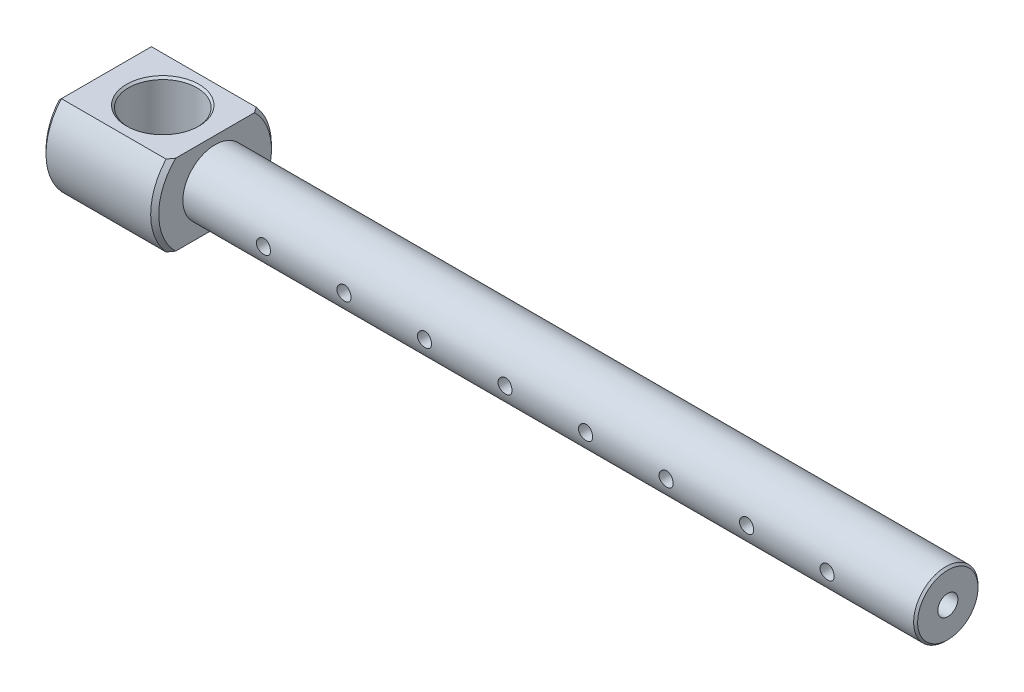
ISO-10303-21;
HEADER;
FILE_DESCRIPTION(('STEP AP214'),'2;1');
FILE_NAME('part.step','',(''),(''),'','','');
FILE_SCHEMA(('AUTOMOTIVE_DESIGN { 1 0 10303 214 1 1 1 1 }'));
ENDSEC;
DATA;
#1=APPLICATION_CONTEXT('core data for automotive mechanical design processes');
#2=APPLICATION_PROTOCOL_DEFINITION('international standard','automotive_design',2000,#1);
#3=PRODUCT_CONTEXT('',#1,'mechanical');
#4=PRODUCT('Part','Part','',(#3));
#5=PRODUCT_RELATED_PRODUCT_CATEGORY('part','',(#4));
#6=PRODUCT_DEFINITION_FORMATION('','',#4);
#7=PRODUCT_DEFINITION_CONTEXT('part definition',#1,'design');
#8=PRODUCT_DEFINITION('design','',#6,#7);
#9=PRODUCT_DEFINITION_SHAPE('','',#8);
#10=(LENGTH_UNIT() NAMED_UNIT(*) SI_UNIT(.MILLI.,.METRE.));
#11=(NAMED_UNIT(*) PLANE_ANGLE_UNIT() SI_UNIT($,.RADIAN.));
#12=(NAMED_UNIT(*) SI_UNIT($,.STERADIAN.) SOLID_ANGLE_UNIT());
#13=UNCERTAINTY_MEASURE_WITH_UNIT(LENGTH_MEASURE(1.E-05),#10,'distance_accuracy_value','');
#14=(GEOMETRIC_REPRESENTATION_CONTEXT(3) GLOBAL_UNCERTAINTY_ASSIGNED_CONTEXT((#13)) GLOBAL_UNIT_ASSIGNED_CONTEXT((#10,
#11,#12)) REPRESENTATION_CONTEXT('',''));
#15=CARTESIAN_POINT('',(0.,0.,0.));
#16=DIRECTION('',(0.,0.,1.));
#17=DIRECTION('',(1.,0.,0.));
#18=AXIS2_PLACEMENT_3D('',#15,#16,#17);
#19=CARTESIAN_POINT('',(177.99999999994,0.,0.));
#20=DIRECTION('',(1.,0.,0.));
#21=DIRECTION('',(0.,0.,-1.));
#22=AXIS2_PLACEMENT_3D('',#19,#20,#21);
#23=CONICAL_SURFACE('',#22,2.49999999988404,1.04719755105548);
#24=CARTESIAN_POINT('',(176.556624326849,0.,8.5265128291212E-11));
#25=VERTEX_POINT('',#24);
#26=VERTEX_LOOP('',#25);
#27=FACE_BOUND('',#26,.T.);
#28=CARTESIAN_POINT('',(178.,0.,0.));
#29=DIRECTION('',(1.,0.,0.));
#30=DIRECTION('',(0.,0.,-1.));
#31=AXIS2_PLACEMENT_3D('',#28,#29,#30);
#32=CIRCLE('',#31,2.5);
#33=CARTESIAN_POINT('',(178.,0.,-2.5));
#34=VERTEX_POINT('',#33);
#35=EDGE_CURVE('E181',#34,#34,#32,.T.);
#36=ORIENTED_EDGE('',*,*,#35,.T.);
#37=EDGE_LOOP('',(#36));
#38=FACE_BOUND('',#37,.T.);
#39=ADVANCED_FACE('F16',(#27,#38),#23,.F.);
#40=CARTESIAN_POINT('',(0.,-25.,0.));
#41=DIRECTION('',(0.,1.,0.));
#42=DIRECTION('',(0.,0.,1.));
#43=AXIS2_PLACEMENT_3D('',#40,#41,#42);
#44=CYLINDRICAL_SURFACE('',#43,8.5);
#45=CARTESIAN_POINT('',(0.,9.50000000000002,0.));
#46=DIRECTION('',(0.,1.,0.));
#47=DIRECTION('',(0.,0.,1.));
#48=AXIS2_PLACEMENT_3D('',#45,#46,#47);
#49=CIRCLE('',#48,8.5);
#50=CARTESIAN_POINT('',(0.,9.50000000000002,8.5));
#51=VERTEX_POINT('',#50);
#52=EDGE_CURVE('E132',#51,#51,#49,.T.);
#53=ORIENTED_EDGE('',*,*,#52,.T.);
#54=EDGE_LOOP('',(#53));
#55=FACE_BOUND('',#54,.T.);
#56=CARTESIAN_POINT('',(0.,-9.49999999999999,0.));
#57=DIRECTION('',(0.,-1.,0.));
#58=DIRECTION('',(0.,0.,-1.));
#59=AXIS2_PLACEMENT_3D('',#56,#57,#58);
#60=CIRCLE('',#59,8.5);
#61=CARTESIAN_POINT('',(0.,-9.49999999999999,-8.5));
#62=VERTEX_POINT('',#61);
#63=EDGE_CURVE('E87',#62,#62,#60,.T.);
#64=ORIENTED_EDGE('',*,*,#63,.T.);
#65=EDGE_LOOP('',(#64));
#66=FACE_BOUND('',#65,.T.);
#67=ADVANCED_FACE('F178',(#55,#66),#44,.F.);
#68=CARTESIAN_POINT('',(-14.,0.,0.));
#69=DIRECTION('',(1.,0.,0.));
#70=DIRECTION('',(0.,0.,-1.));
#71=AXIS2_PLACEMENT_3D('',#68,#69,#70);
#72=CONICAL_SURFACE('',#71,15.,0.785398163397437);
#73=CARTESIAN_POINT('',(-15.,9.,-10.7238052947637));
#74=CARTESIAN_POINT('',(-14.9594681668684,9.04053182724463,-10.7427033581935));
#75=CARTESIAN_POINT('',(-14.9189258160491,9.08107410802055,-10.7615564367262));
#76=CARTESIAN_POINT('',(-14.8375200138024,9.1624797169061,-10.7993131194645));
#77=CARTESIAN_POINT('',(-14.7966564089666,9.2033431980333,-10.8182160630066));
#78=CARTESIAN_POINT('',(-14.7146081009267,9.28539128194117,-10.8560716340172));
#79=CARTESIAN_POINT('',(-14.6734232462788,9.32657603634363,-10.875023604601));
#80=CARTESIAN_POINT('',(-14.5907324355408,9.40926670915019,-10.9129764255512));
#81=CARTESIAN_POINT('',(-14.5492263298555,9.45077277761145,-10.9319766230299));
#82=CARTESIAN_POINT('',(-14.4658930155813,9.53410609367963,-10.9700251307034));
#83=CARTESIAN_POINT('',(-14.424065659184,9.57593348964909,-10.9890727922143));
#84=CARTESIAN_POINT('',(-14.3400898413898,9.65990944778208,-11.027215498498));
#85=CARTESIAN_POINT('',(-14.2979412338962,9.7020581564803,-11.0463098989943));
#86=CARTESIAN_POINT('',(-14.2133229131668,9.78667670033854,-11.0845453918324));
#87=CARTESIAN_POINT('',(-14.1708530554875,9.82914668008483,-11.1036858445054));
#88=CARTESIAN_POINT('',(-14.0855922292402,9.9144076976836,-11.1420127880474));
#89=CARTESIAN_POINT('',(-14.042801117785,9.95719887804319,-11.1611986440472));
#90=CARTESIAN_POINT('',(-14.,10.,-11.180339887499));
#91=B_SPLINE_CURVE_WITH_KNOTS('',3,(#73,#74,#75,#76,#77,#78,#79,#80,#81,#82,#83,#84,#85,#86,#87,
#88,#89,#90),.UNSPECIFIED.,.F.,.F.,(4,2,2,2,2,2,2,2,4),(0.,0.181066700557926,0.363475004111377,
0.547224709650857,0.732315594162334,0.918747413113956,1.10651990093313,1.29563277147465,
1.48608571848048),.UNSPECIFIED.);
#92=CARTESIAN_POINT('',(-15.,9.,-10.7238052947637));
#93=VERTEX_POINT('',#92);
#94=CARTESIAN_POINT('',(-14.,10.,-11.180339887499));
#95=VERTEX_POINT('',#94);
#96=EDGE_CURVE('E81',#93,#95,#91,.T.);
#97=ORIENTED_EDGE('',*,*,#96,.T.);
#98=CARTESIAN_POINT('',(-14.,0.,0.));
#99=DIRECTION('',(-1.,0.,0.));
#100=DIRECTION('',(0.,0.,1.));
#101=AXIS2_PLACEMENT_3D('',#98,#99,#100);
#102=CIRCLE('',#101,15.);
#103=CARTESIAN_POINT('',(-14.,-10.,-11.1803398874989));
#104=VERTEX_POINT('',#103);
#105=EDGE_CURVE('E75',#104,#95,#102,.F.);
#106=ORIENTED_EDGE('',*,*,#105,.F.);
#107=CARTESIAN_POINT('',(-14.,-10.,-11.1803398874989));
#108=CARTESIAN_POINT('',(-14.0428011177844,-9.95719887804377,-11.1611986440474));
#109=CARTESIAN_POINT('',(-14.0855922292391,-9.91440769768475,-11.1420127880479));
#110=CARTESIAN_POINT('',(-14.1708530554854,-9.82914668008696,-11.1036858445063));
#111=CARTESIAN_POINT('',(-14.2133229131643,-9.78667670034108,-11.0845453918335));
#112=CARTESIAN_POINT('',(-14.2979412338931,-9.70205815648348,-11.0463098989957));
#113=CARTESIAN_POINT('',(-14.3400898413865,-9.65990944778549,-11.0272154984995));
#114=CARTESIAN_POINT('',(-14.4240656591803,-9.57593348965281,-10.9890727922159));
#115=CARTESIAN_POINT('',(-14.4658930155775,-9.53410609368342,-10.9700251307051));
#116=CARTESIAN_POINT('',(-14.5492263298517,-9.45077277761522,-10.9319766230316));
#117=CARTESIAN_POINT('',(-14.5907324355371,-9.40926670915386,-10.9129764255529));
#118=CARTESIAN_POINT('',(-14.6734232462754,-9.32657603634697,-10.8750236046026));
#119=CARTESIAN_POINT('',(-14.7146081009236,-9.28539128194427,-10.8560716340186));
#120=CARTESIAN_POINT('',(-14.7966564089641,-9.20334319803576,-10.8182160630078));
#121=CARTESIAN_POINT('',(-14.8375200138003,-9.16247971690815,-10.7993131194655));
#122=CARTESIAN_POINT('',(-14.918925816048,-9.08107410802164,-10.7615564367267));
#123=CARTESIAN_POINT('',(-14.9594681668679,-9.04053182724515,-10.7427033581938));
#124=CARTESIAN_POINT('',(-15.,-8.99999999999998,-10.7238052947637));
#125=B_SPLINE_CURVE_WITH_KNOTS('',3,(#107,#108,#109,#110,#111,#112,#113,#114,#115,#116,#117,
#118,#119,#120,#121,#122,#123,#124),.UNSPECIFIED.,.F.,.F.,(4,2,2,2,2,2,2,2,4),(0.,
0.190452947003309,0.379565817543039,0.567338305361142,0.753770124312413,0.938861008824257,
1.12261071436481,1.30501901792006,1.48608571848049),.UNSPECIFIED.);
#126=CARTESIAN_POINT('',(-15.,-8.99999999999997,-10.7238052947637));
#127=VERTEX_POINT('',#126);
#128=EDGE_CURVE('E78',#104,#127,#125,.T.);
#129=ORIENTED_EDGE('',*,*,#128,.T.);
#130=CARTESIAN_POINT('',(-15.,0.,0.));
#131=DIRECTION('',(1.,0.,0.));
#132=DIRECTION('',(0.,0.,-1.));
#133=AXIS2_PLACEMENT_3D('',#130,#131,#132);
#134=CIRCLE('',#133,14.);
#135=EDGE_CURVE('E19',#127,#93,#134,.T.);
#136=ORIENTED_EDGE('',*,*,#135,.T.);
#137=EDGE_LOOP('',(#97,#106,#129,#136));
#138=FACE_BOUND('',#137,.T.);
#139=ADVANCED_FACE('F77',(#138),#72,.T.);
#140=CARTESIAN_POINT('',(-15.,15.,0.));
#141=DIRECTION('',(1.,0.,0.));
#142=DIRECTION('',(0.,0.,-1.));
#143=AXIS2_PLACEMENT_3D('',#140,#141,#142);
#144=PLANE('',#143);
#145=ORIENTED_EDGE('',*,*,#135,.F.);
#146=DIRECTION('',(0.,0.,1.));
#147=VECTOR('',#146,1.);
#148=CARTESIAN_POINT('',(-15.,-8.99999999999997,0.));
#149=LINE('',#148,#147);
#150=CARTESIAN_POINT('',(-15.,-8.99999999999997,10.7238052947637));
#151=VERTEX_POINT('',#150);
#152=EDGE_CURVE('E86',#127,#151,#149,.T.);
#153=ORIENTED_EDGE('',*,*,#152,.T.);
#154=CARTESIAN_POINT('',(-15.,0.,0.));
#155=DIRECTION('',(1.,0.,0.));
#156=DIRECTION('',(0.,0.,-1.));
#157=AXIS2_PLACEMENT_3D('',#154,#155,#156);
#158=CIRCLE('',#157,14.);
#159=CARTESIAN_POINT('',(-15.,9.00000000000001,10.7238052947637));
#160=VERTEX_POINT('',#159);
#161=EDGE_CURVE('E369',#160,#151,#158,.T.);
#162=ORIENTED_EDGE('',*,*,#161,.F.);
#163=DIRECTION('',(0.,0.,1.));
#164=VECTOR('',#163,1.);
#165=CARTESIAN_POINT('',(-15.,9.,0.));
#166=LINE('',#165,#164);
#167=EDGE_CURVE('E129',#160,#93,#166,.F.);
#168=ORIENTED_EDGE('',*,*,#167,.T.);
#169=EDGE_LOOP('',(#145,#153,#162,#168));
#170=FACE_BOUND('',#169,.T.);
#171=ADVANCED_FACE('F154',(#170),#144,.F.);
#172=CARTESIAN_POINT('',(-14.,0.,0.));
#173=DIRECTION('',(1.,0.,0.));
#174=DIRECTION('',(0.,0.,-1.));
#175=AXIS2_PLACEMENT_3D('',#172,#173,#174);
#176=CONICAL_SURFACE('',#175,15.,0.785398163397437);
#177=CARTESIAN_POINT('',(-14.,0.,0.));
#178=DIRECTION('',(-1.,0.,0.));
#179=DIRECTION('',(0.,0.,1.));
#180=AXIS2_PLACEMENT_3D('',#177,#178,#179);
#181=CIRCLE('',#180,15.);
#182=CARTESIAN_POINT('',(-14.,10.,11.180339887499));
#183=VERTEX_POINT('',#182);
#184=CARTESIAN_POINT('',(-14.,-9.99999999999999,11.180339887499));
#185=VERTEX_POINT('',#184);
#186=EDGE_CURVE('E133',#183,#185,#181,.F.);
#187=ORIENTED_EDGE('',*,*,#186,.F.);
#188=CARTESIAN_POINT('',(-14.,10.,11.180339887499));
#189=CARTESIAN_POINT('',(-14.0428011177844,9.95719887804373,11.1611986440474));
#190=CARTESIAN_POINT('',(-14.0855922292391,9.91440769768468,11.1420127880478));
#191=CARTESIAN_POINT('',(-14.1708530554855,9.82914668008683,11.1036858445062));
#192=CARTESIAN_POINT('',(-14.2133229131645,9.78667670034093,11.0845453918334));
#193=CARTESIAN_POINT('',(-14.2979412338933,9.70205815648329,11.0463098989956));
#194=CARTESIAN_POINT('',(-14.3400898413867,9.65990944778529,11.0272154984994));
#195=CARTESIAN_POINT('',(-14.4240656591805,9.5759334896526,10.9890727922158));
#196=CARTESIAN_POINT('',(-14.4658930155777,9.5341060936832,10.970025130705));
#197=CARTESIAN_POINT('',(-14.549226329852,9.45077277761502,10.9319766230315));
#198=CARTESIAN_POINT('',(-14.5907324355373,9.40926670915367,10.9129764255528));
#199=CARTESIAN_POINT('',(-14.6734232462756,9.32657603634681,10.8750236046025));
#200=CARTESIAN_POINT('',(-14.7146081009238,9.28539128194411,10.8560716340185));
#201=CARTESIAN_POINT('',(-14.7966564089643,9.20334319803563,10.8182160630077));
#202=CARTESIAN_POINT('',(-14.8375200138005,9.16247971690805,10.7993131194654));
#203=CARTESIAN_POINT('',(-14.918925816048,9.08107410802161,10.7615564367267));
#204=CARTESIAN_POINT('',(-14.9594681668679,9.04053182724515,10.7427033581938));
#205=CARTESIAN_POINT('',(-15.,9.00000000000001,10.7238052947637));
#206=B_SPLINE_CURVE_WITH_KNOTS('',3,(#188,#189,#190,#191,#192,#193,#194,#195,#196,#197,#198,
#199,#200,#201,#202,#203,#204,#205),.UNSPECIFIED.,.F.,.F.,(4,2,2,2,2,2,2,2,4),(0.,
0.190452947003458,0.379565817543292,0.567338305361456,0.753770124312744,0.938861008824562,
1.12261071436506,1.30501901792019,1.48608571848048),.UNSPECIFIED.);
#207=EDGE_CURVE('E159',#183,#160,#206,.T.);
#208=ORIENTED_EDGE('',*,*,#207,.T.);
#209=ORIENTED_EDGE('',*,*,#161,.T.);
#210=CARTESIAN_POINT('',(-15.,-8.99999999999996,10.7238052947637));
#211=CARTESIAN_POINT('',(-14.9594681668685,-9.04053182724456,10.7427033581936));
#212=CARTESIAN_POINT('',(-14.9189258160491,-9.08107410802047,10.7615564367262));
#213=CARTESIAN_POINT('',(-14.8375200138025,-9.16247971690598,10.7993131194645));
#214=CARTESIAN_POINT('',(-14.7966564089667,-9.20334319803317,10.8182160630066));
#215=CARTESIAN_POINT('',(-14.7146081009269,-9.285391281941,10.8560716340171));
#216=CARTESIAN_POINT('',(-14.6734232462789,-9.32657603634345,10.8750236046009));
#217=CARTESIAN_POINT('',(-14.5907324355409,-9.40926670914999,10.9129764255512));
#218=CARTESIAN_POINT('',(-14.5492263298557,-9.45077277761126,10.9319766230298));
#219=CARTESIAN_POINT('',(-14.4658930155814,-9.53410609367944,10.9700251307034));
#220=CARTESIAN_POINT('',(-14.4240656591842,-9.5759334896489,10.9890727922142));
#221=CARTESIAN_POINT('',(-14.34008984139,-9.6599094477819,11.0272154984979));
#222=CARTESIAN_POINT('',(-14.2979412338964,-9.70205815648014,11.0463098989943));
#223=CARTESIAN_POINT('',(-14.2133229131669,-9.78667670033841,11.0845453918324));
#224=CARTESIAN_POINT('',(-14.1708530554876,-9.82914668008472,11.1036858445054));
#225=CARTESIAN_POINT('',(-14.0855922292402,-9.91440769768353,11.1420127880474));
#226=CARTESIAN_POINT('',(-14.042801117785,-9.95719887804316,11.1611986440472));
#227=CARTESIAN_POINT('',(-14.,-9.99999999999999,11.180339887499));
#228=B_SPLINE_CURVE_WITH_KNOTS('',3,(#210,#211,#212,#213,#214,#215,#216,#217,#218,#219,#220,
#221,#222,#223,#224,#225,#226,#227),.UNSPECIFIED.,.F.,.F.,(4,2,2,2,2,2,2,2,4),(0.,
0.181066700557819,0.363475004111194,0.547224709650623,0.732315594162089,0.918747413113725,
1.10651990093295,1.29563277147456,1.4860857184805),.UNSPECIFIED.);
#229=EDGE_CURVE('E120',#151,#185,#228,.T.);
#230=ORIENTED_EDGE('',*,*,#229,.T.);
#231=EDGE_LOOP('',(#187,#208,#209,#230));
#232=FACE_BOUND('',#231,.T.);
#233=ADVANCED_FACE('F143',(#232),#176,.T.);
#234=CARTESIAN_POINT('',(195.,0.,0.));
#235=DIRECTION('',(1.,0.,0.));
#236=DIRECTION('',(0.,0.,-1.));
#237=AXIS2_PLACEMENT_3D('',#234,#235,#236);
#238=CYLINDRICAL_SURFACE('',#237,2.5);
#239=ORIENTED_EDGE('',*,*,#35,.F.);
#240=EDGE_LOOP('',(#239));
#241=FACE_BOUND('',#240,.T.);
#242=CARTESIAN_POINT('',(195.,0.,0.));
#243=DIRECTION('',(1.,0.,0.));
#244=DIRECTION('',(0.,0.,-1.));
#245=AXIS2_PLACEMENT_3D('',#242,#243,#244);
#246=CIRCLE('',#245,2.5);
#247=CARTESIAN_POINT('',(195.,0.,-2.5));
#248=VERTEX_POINT('',#247);
#249=EDGE_CURVE('E135',#248,#248,#246,.T.);
#250=ORIENTED_EDGE('',*,*,#249,.T.);
#251=EDGE_LOOP('',(#250));
#252=FACE_BOUND('',#251,.T.);
#253=ADVANCED_FACE('F153',(#241,#252),#238,.F.);
#254=CARTESIAN_POINT('',(0.,10.,0.));
#255=DIRECTION('',(0.,1.,0.));
#256=DIRECTION('',(0.,0.,1.));
#257=AXIS2_PLACEMENT_3D('',#254,#255,#256);
#258=CONICAL_SURFACE('',#257,8.99999999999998,0.785398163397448);
#259=CARTESIAN_POINT('',(0.,10.,0.));
#260=DIRECTION('',(0.,1.,0.));
#261=DIRECTION('',(0.,0.,1.));
#262=AXIS2_PLACEMENT_3D('',#259,#260,#261);
#263=CIRCLE('',#262,8.99999999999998);
#264=CARTESIAN_POINT('',(0.,10.,8.99999999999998));
#265=VERTEX_POINT('',#264);
#266=EDGE_CURVE('E365',#265,#265,#263,.T.);
#267=ORIENTED_EDGE('',*,*,#266,.T.);
#268=EDGE_LOOP('',(#267));
#269=FACE_BOUND('',#268,.T.);
#270=ORIENTED_EDGE('',*,*,#52,.F.);
#271=EDGE_LOOP('',(#270));
#272=FACE_BOUND('',#271,.T.);
#273=ADVANCED_FACE('F405',(#269,#272),#258,.F.);
#274=CARTESIAN_POINT('',(-15.,9.,0.));
#275=DIRECTION('',(0.707106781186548,-0.707106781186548,0.));
#276=DIRECTION('',(0.707106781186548,0.707106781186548,0.));
#277=AXIS2_PLACEMENT_3D('',#274,#275,#276);
#278=PLANE('',#277);
#279=DIRECTION('',(0.,0.,-1.));
#280=VECTOR('',#279,1.);
#281=CARTESIAN_POINT('',(-14.,10.,-25.));
#282=LINE('',#281,#280);
#283=EDGE_CURVE('E126',#183,#95,#282,.T.);
#284=ORIENTED_EDGE('',*,*,#283,.T.);
#285=ORIENTED_EDGE('',*,*,#96,.F.);
#286=ORIENTED_EDGE('',*,*,#167,.F.);
#287=ORIENTED_EDGE('',*,*,#207,.F.);
#288=EDGE_LOOP('',(#284,#285,#286,#287));
#289=FACE_BOUND('',#288,.T.);
#290=ADVANCED_FACE('F377',(#289),#278,.F.);
#291=CARTESIAN_POINT('',(0.,-10.,0.));
#292=DIRECTION('',(0.,-1.,0.));
#293=DIRECTION('',(1.,0.,0.));
#294=AXIS2_PLACEMENT_3D('',#291,#292,#293);
#295=CONICAL_SURFACE('',#294,9.00000000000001,0.78539816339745);
#296=CARTESIAN_POINT('',(0.,-10.,0.));
#297=DIRECTION('',(0.,-1.,0.));
#298=DIRECTION('',(1.,0.,0.));
#299=AXIS2_PLACEMENT_3D('',#296,#297,#298);
#300=CIRCLE('',#299,9.00000000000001);
#301=CARTESIAN_POINT('',(9.00000000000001,-10.,0.));
#302=VERTEX_POINT('',#301);
#303=EDGE_CURVE('E350',#302,#302,#300,.T.);
#304=ORIENTED_EDGE('',*,*,#303,.T.);
#305=EDGE_LOOP('',(#304));
#306=FACE_BOUND('',#305,.T.);
#307=ORIENTED_EDGE('',*,*,#63,.F.);
#308=EDGE_LOOP('',(#307));
#309=FACE_BOUND('',#308,.T.);
#310=ADVANCED_FACE('F425',(#306,#309),#295,.F.);
#311=CARTESIAN_POINT('',(-46.794320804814,0.,0.));
#312=DIRECTION('',(-1.,0.,0.));
#313=DIRECTION('',(0.,0.,1.));
#314=AXIS2_PLACEMENT_3D('',#311,#312,#313);
#315=CYLINDRICAL_SURFACE('',#314,15.);
#316=ORIENTED_EDGE('',*,*,#105,.T.);
#317=DIRECTION('',(1.,0.,0.));
#318=VECTOR('',#317,1.);
#319=CARTESIAN_POINT('',(-20.0384345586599,10.,-11.1803398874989));
#320=LINE('',#319,#318);
#321=CARTESIAN_POINT('',(12.,10.,-11.1803398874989));
#322=VERTEX_POINT('',#321);
#323=EDGE_CURVE('E122',#95,#322,#320,.T.);
#324=ORIENTED_EDGE('',*,*,#323,.T.);
#325=CARTESIAN_POINT('',(12.,0.,0.));
#326=DIRECTION('',(-1.,0.,0.));
#327=DIRECTION('',(0.,0.,1.));
#328=AXIS2_PLACEMENT_3D('',#325,#326,#327);
#329=CIRCLE('',#328,15.);
#330=CARTESIAN_POINT('',(12.,-10.,-11.1803398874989));
#331=VERTEX_POINT('',#330);
#332=EDGE_CURVE('E101',#331,#322,#329,.F.);
#333=ORIENTED_EDGE('',*,*,#332,.F.);
#334=DIRECTION('',(1.,0.,0.));
#335=VECTOR('',#334,1.);
#336=CARTESIAN_POINT('',(-20.0384345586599,-10.,-11.1803398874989));
#337=LINE('',#336,#335);
#338=EDGE_CURVE('E98',#331,#104,#337,.F.);
#339=ORIENTED_EDGE('',*,*,#338,.T.);
#340=EDGE_LOOP('',(#316,#324,#333,#339));
#341=FACE_BOUND('',#340,.T.);
#342=ADVANCED_FACE('F99',(#341),#315,.T.);
#343=CARTESIAN_POINT('',(-15.,-8.99999999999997,0.));
#344=DIRECTION('',(0.707106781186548,0.707106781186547,0.));
#345=DIRECTION('',(-0.707106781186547,0.707106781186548,0.));
#346=AXIS2_PLACEMENT_3D('',#343,#344,#345);
#347=PLANE('',#346);
#348=DIRECTION('',(0.,0.,1.));
#349=VECTOR('',#348,1.);
#350=CARTESIAN_POINT('',(-14.,-10.,-25.));
#351=LINE('',#350,#349);
#352=EDGE_CURVE('E94',#104,#185,#351,.T.);
#353=ORIENTED_EDGE('',*,*,#352,.T.);
#354=ORIENTED_EDGE('',*,*,#229,.F.);
#355=ORIENTED_EDGE('',*,*,#152,.F.);
#356=ORIENTED_EDGE('',*,*,#128,.F.);
#357=EDGE_LOOP('',(#353,#354,#355,#356));
#358=FACE_BOUND('',#357,.T.);
#359=ADVANCED_FACE('F91',(#358),#347,.F.);
#360=CARTESIAN_POINT('',(-46.794320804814,0.,0.));
#361=DIRECTION('',(-1.,0.,0.));
#362=DIRECTION('',(0.,0.,1.));
#363=AXIS2_PLACEMENT_3D('',#360,#361,#362);
#364=CYLINDRICAL_SURFACE('',#363,15.);
#365=DIRECTION('',(1.,0.,0.));
#366=VECTOR('',#365,1.);
#367=CARTESIAN_POINT('',(-20.0384345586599,10.,11.1803398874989));
#368=LINE('',#367,#366);
#369=CARTESIAN_POINT('',(12.,10.,11.1803398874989));
#370=VERTEX_POINT('',#369);
#371=EDGE_CURVE('E128',#370,#183,#368,.F.);
#372=ORIENTED_EDGE('',*,*,#371,.T.);
#373=ORIENTED_EDGE('',*,*,#186,.T.);
#374=DIRECTION('',(1.,0.,0.));
#375=VECTOR('',#374,1.);
#376=CARTESIAN_POINT('',(-20.0384345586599,-10.,11.1803398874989));
#377=LINE('',#376,#375);
#378=CARTESIAN_POINT('',(12.,-10.,11.1803398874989));
#379=VERTEX_POINT('',#378);
#380=EDGE_CURVE('E111',#185,#379,#377,.T.);
#381=ORIENTED_EDGE('',*,*,#380,.T.);
#382=CARTESIAN_POINT('',(12.,0.,0.));
#383=DIRECTION('',(-1.,0.,0.));
#384=DIRECTION('',(0.,0.,1.));
#385=AXIS2_PLACEMENT_3D('',#382,#383,#384);
#386=CIRCLE('',#385,15.);
#387=EDGE_CURVE('E389',#370,#379,#386,.F.);
#388=ORIENTED_EDGE('',*,*,#387,.F.);
#389=EDGE_LOOP('',(#372,#373,#381,#388));
#390=FACE_BOUND('',#389,.T.);
#391=ADVANCED_FACE('F410',(#390),#364,.T.);
#392=CARTESIAN_POINT('',(195.,8.,0.));
#393=DIRECTION('',(-1.,0.,0.));
#394=DIRECTION('',(0.,0.,1.));
#395=AXIS2_PLACEMENT_3D('',#392,#393,#394);
#396=PLANE('',#395);
#397=CARTESIAN_POINT('',(195.,0.,0.));
#398=DIRECTION('',(-1.,0.,0.));
#399=DIRECTION('',(0.,-1.,0.));
#400=AXIS2_PLACEMENT_3D('',#397,#398,#399);
#401=CIRCLE('',#400,7.50000000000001);
#402=CARTESIAN_POINT('',(195.,-7.50000000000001,0.));
#403=VERTEX_POINT('',#402);
#404=EDGE_CURVE('E391',#403,#403,#401,.T.);
#405=ORIENTED_EDGE('',*,*,#404,.F.);
#406=EDGE_LOOP('',(#405));
#407=FACE_BOUND('',#406,.T.);
#408=ORIENTED_EDGE('',*,*,#249,.F.);
#409=EDGE_LOOP('',(#408));
#410=FACE_BOUND('',#409,.T.);
#411=ADVANCED_FACE('F408',(#407,#410),#396,.F.);
#412=CARTESIAN_POINT('',(-20.0384345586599,10.,-25.));
#413=DIRECTION('',(0.,-1.,0.));
#414=DIRECTION('',(0.,0.,-1.));
#415=AXIS2_PLACEMENT_3D('',#412,#413,#414);
#416=PLANE('',#415);
#417=ORIENTED_EDGE('',*,*,#283,.F.);
#418=ORIENTED_EDGE('',*,*,#371,.F.);
#419=CARTESIAN_POINT('',(13.,10.,9.79795897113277));
#420=CARTESIAN_POINT('',(12.9184698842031,10.,9.91445283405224));
#421=CARTESIAN_POINT('',(12.8364440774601,10.,10.0305989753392));
#422=CARTESIAN_POINT('',(12.6714731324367,10.,10.2622268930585));
#423=CARTESIAN_POINT('',(12.5885280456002,10.,10.3777087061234));
#424=CARTESIAN_POINT('',(12.4217819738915,10.,10.6080513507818));
#425=CARTESIAN_POINT('',(12.3379809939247,10.,10.7229121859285));
#426=CARTESIAN_POINT('',(12.1695765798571,10.,10.9520540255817));
#427=CARTESIAN_POINT('',(12.0849731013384,10.,11.0663349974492));
#428=CARTESIAN_POINT('',(12.0000000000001,10.,11.180339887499));
#429=B_SPLINE_CURVE_WITH_KNOTS('',3,(#419,#420,#421,#422,#423,#424,#425,#426,#427,#428),
.UNSPECIFIED.,.F.,.F.,(4,2,2,2,4),(0.,0.426567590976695,0.853111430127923,1.27965282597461,
1.70621797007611),.UNSPECIFIED.);
#430=CARTESIAN_POINT('',(13.,10.,9.79795897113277));
#431=VERTEX_POINT('',#430);
#432=EDGE_CURVE('E334',#431,#370,#429,.T.);
#433=ORIENTED_EDGE('',*,*,#432,.F.);
#434=DIRECTION('',(0.,0.,1.));
#435=VECTOR('',#434,1.);
#436=CARTESIAN_POINT('',(13.,10.,0.));
#437=LINE('',#436,#435);
#438=CARTESIAN_POINT('',(13.,10.,-9.79795897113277));
#439=VERTEX_POINT('',#438);
#440=EDGE_CURVE('E394',#431,#439,#437,.F.);
#441=ORIENTED_EDGE('',*,*,#440,.T.);
#442=CARTESIAN_POINT('',(12.,10.,-11.1803398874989));
#443=CARTESIAN_POINT('',(12.0849731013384,10.,-11.0663349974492));
#444=CARTESIAN_POINT('',(12.1695765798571,10.,-10.9520540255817));
#445=CARTESIAN_POINT('',(12.3379809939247,10.,-10.7229121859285));
#446=CARTESIAN_POINT('',(12.4217819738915,10.,-10.6080513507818));
#447=CARTESIAN_POINT('',(12.5885280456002,10.,-10.3777087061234));
#448=CARTESIAN_POINT('',(12.6714731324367,10.,-10.2622268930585));
#449=CARTESIAN_POINT('',(12.8364440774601,10.,-10.0305989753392));
#450=CARTESIAN_POINT('',(12.9184698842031,10.,-9.91445283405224));
#451=CARTESIAN_POINT('',(13.,10.,-9.7979589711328));
#452=B_SPLINE_CURVE_WITH_KNOTS('',3,(#442,#443,#444,#445,#446,#447,#448,#449,#450,#451),
.UNSPECIFIED.,.F.,.F.,(4,2,2,2,4),(0.,0.42656514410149,0.853106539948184,1.27965037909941,
1.70621797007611),.UNSPECIFIED.);
#453=EDGE_CURVE('E121',#322,#439,#452,.T.);
#454=ORIENTED_EDGE('',*,*,#453,.F.);
#455=ORIENTED_EDGE('',*,*,#323,.F.);
#456=EDGE_LOOP('',(#417,#418,#433,#441,#454,#455));
#457=FACE_BOUND('',#456,.T.);
#458=ORIENTED_EDGE('',*,*,#266,.F.);
#459=EDGE_LOOP('',(#458));
#460=FACE_BOUND('',#459,.T.);
#461=ADVANCED_FACE('F355',(#457,#460),#416,.F.);
#462=CARTESIAN_POINT('',(12.,0.,0.));
#463=DIRECTION('',(-1.,0.,0.));
#464=DIRECTION('',(0.,-1.,0.));
#465=AXIS2_PLACEMENT_3D('',#462,#463,#464);
#466=CONICAL_SURFACE('',#465,15.,0.785398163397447);
#467=ORIENTED_EDGE('',*,*,#453,.T.);
#468=CARTESIAN_POINT('',(13.,0.,0.));
#469=DIRECTION('',(-1.,0.,0.));
#470=DIRECTION('',(0.,-1.,0.));
#471=AXIS2_PLACEMENT_3D('',#468,#469,#470);
#472=CIRCLE('',#471,14.);
#473=CARTESIAN_POINT('',(13.,-10.,-9.79795897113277));
#474=VERTEX_POINT('',#473);
#475=EDGE_CURVE('E623',#439,#474,#472,.T.);
#476=ORIENTED_EDGE('',*,*,#475,.T.);
#477=CARTESIAN_POINT('',(13.,-10.,-9.79795897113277));
#478=CARTESIAN_POINT('',(12.9184698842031,-10.,-9.91445283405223));
#479=CARTESIAN_POINT('',(12.8364440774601,-10.,-10.0305989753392));
#480=CARTESIAN_POINT('',(12.6714731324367,-10.,-10.2622268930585));
#481=CARTESIAN_POINT('',(12.5885280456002,-10.,-10.3777087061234));
#482=CARTESIAN_POINT('',(12.4217819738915,-10.,-10.6080513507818));
#483=CARTESIAN_POINT('',(12.3379809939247,-10.,-10.7229121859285));
#484=CARTESIAN_POINT('',(12.1695765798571,-10.,-10.9520540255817));
#485=CARTESIAN_POINT('',(12.0849731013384,-10.,-11.0663349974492));
#486=CARTESIAN_POINT('',(12.0000000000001,-10.,-11.180339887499));
#487=B_SPLINE_CURVE_WITH_KNOTS('',3,(#477,#478,#479,#480,#481,#482,#483,#484,#485,#486),
.UNSPECIFIED.,.F.,.F.,(4,2,2,2,4),(0.,0.426567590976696,0.853111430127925,1.27965282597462,
1.70621797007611),.UNSPECIFIED.);
#488=EDGE_CURVE('E105',#474,#331,#487,.T.);
#489=ORIENTED_EDGE('',*,*,#488,.T.);
#490=ORIENTED_EDGE('',*,*,#332,.T.);
#491=EDGE_LOOP('',(#467,#476,#489,#490));
#492=FACE_BOUND('',#491,.T.);
#493=ADVANCED_FACE('F352',(#492),#466,.T.);
#494=CARTESIAN_POINT('',(-20.0384345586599,-10.,-25.));
#495=DIRECTION('',(0.,1.,0.));
#496=DIRECTION('',(0.,0.,1.));
#497=AXIS2_PLACEMENT_3D('',#494,#495,#496);
#498=PLANE('',#497);
#499=ORIENTED_EDGE('',*,*,#352,.F.);
#500=ORIENTED_EDGE('',*,*,#338,.F.);
#501=ORIENTED_EDGE('',*,*,#488,.F.);
#502=DIRECTION('',(0.,0.,1.));
#503=VECTOR('',#502,1.);
#504=CARTESIAN_POINT('',(13.,-10.,0.));
#505=LINE('',#504,#503);
#506=CARTESIAN_POINT('',(13.,-10.,9.79795897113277));
#507=VERTEX_POINT('',#506);
#508=EDGE_CURVE('E620',#474,#507,#505,.T.);
#509=ORIENTED_EDGE('',*,*,#508,.T.);
#510=CARTESIAN_POINT('',(12.,-10.,11.1803398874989));
#511=CARTESIAN_POINT('',(12.0849731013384,-10.,11.0663349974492));
#512=CARTESIAN_POINT('',(12.1695765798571,-10.,10.9520540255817));
#513=CARTESIAN_POINT('',(12.3379809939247,-10.,10.7229121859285));
#514=CARTESIAN_POINT('',(12.4217819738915,-10.,10.6080513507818));
#515=CARTESIAN_POINT('',(12.5885280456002,-10.,10.3777087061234));
#516=CARTESIAN_POINT('',(12.6714731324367,-10.,10.2622268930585));
#517=CARTESIAN_POINT('',(12.8364440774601,-10.,10.0305989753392));
#518=CARTESIAN_POINT('',(12.9184698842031,-10.,9.91445283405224));
#519=CARTESIAN_POINT('',(13.,-10.,9.7979589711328));
#520=B_SPLINE_CURVE_WITH_KNOTS('',3,(#510,#511,#512,#513,#514,#515,#516,#517,#518,#519),
.UNSPECIFIED.,.F.,.F.,(4,2,2,2,4),(0.,0.426565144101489,0.853106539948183,1.27965037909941,
1.70621797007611),.UNSPECIFIED.);
#521=EDGE_CURVE('E113',#379,#507,#520,.T.);
#522=ORIENTED_EDGE('',*,*,#521,.F.);
#523=ORIENTED_EDGE('',*,*,#380,.F.);
#524=EDGE_LOOP('',(#499,#500,#501,#509,#522,#523));
#525=FACE_BOUND('',#524,.T.);
#526=ORIENTED_EDGE('',*,*,#303,.F.);
#527=EDGE_LOOP('',(#526));
#528=FACE_BOUND('',#527,.T.);
#529=ADVANCED_FACE('F107',(#525,#528),#498,.F.);
#530=CARTESIAN_POINT('',(12.,0.,0.));
#531=DIRECTION('',(-1.,0.,0.));
#532=DIRECTION('',(0.,-1.,0.));
#533=AXIS2_PLACEMENT_3D('',#530,#531,#532);
#534=CONICAL_SURFACE('',#533,15.,0.785398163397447);
#535=ORIENTED_EDGE('',*,*,#432,.T.);
#536=ORIENTED_EDGE('',*,*,#387,.T.);
#537=ORIENTED_EDGE('',*,*,#521,.T.);
#538=CARTESIAN_POINT('',(13.,0.,0.));
#539=DIRECTION('',(-1.,0.,0.));
#540=DIRECTION('',(0.,-1.,0.));
#541=AXIS2_PLACEMENT_3D('',#538,#539,#540);
#542=CIRCLE('',#541,14.);
#543=EDGE_CURVE('E34',#507,#431,#542,.T.);
#544=ORIENTED_EDGE('',*,*,#543,.T.);
#545=EDGE_LOOP('',(#535,#536,#537,#544));
#546=FACE_BOUND('',#545,.T.);
#547=ADVANCED_FACE('F324',(#546),#534,.T.);
#548=CARTESIAN_POINT('',(194.5,0.,0.));
#549=DIRECTION('',(-1.,0.,0.));
#550=DIRECTION('',(0.,-1.,0.));
#551=AXIS2_PLACEMENT_3D('',#548,#549,#550);
#552=CONICAL_SURFACE('',#551,8.,0.785398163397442);
#553=ORIENTED_EDGE('',*,*,#404,.T.);
#554=EDGE_LOOP('',(#553));
#555=FACE_BOUND('',#554,.T.);
#556=CARTESIAN_POINT('',(194.5,0.,0.));
#557=DIRECTION('',(-1.,0.,0.));
#558=DIRECTION('',(0.,0.,1.));
#559=AXIS2_PLACEMENT_3D('',#556,#557,#558);
#560=CIRCLE('',#559,8.);
#561=CARTESIAN_POINT('',(194.5,0.,8.));
#562=VERTEX_POINT('',#561);
#563=EDGE_CURVE('E616',#562,#562,#560,.T.);
#564=ORIENTED_EDGE('',*,*,#563,.F.);
#565=EDGE_LOOP('',(#564));
#566=FACE_BOUND('',#565,.T.);
#567=ADVANCED_FACE('F320',(#555,#566),#552,.T.);
#568=CARTESIAN_POINT('',(13.,15.,0.));
#569=DIRECTION('',(-1.,0.,0.));
#570=DIRECTION('',(0.,0.,1.));
#571=AXIS2_PLACEMENT_3D('',#568,#569,#570);
#572=PLANE('',#571);
#573=CARTESIAN_POINT('',(13.,0.,0.));
#574=DIRECTION('',(-1.,0.,0.));
#575=DIRECTION('',(0.,0.,1.));
#576=AXIS2_PLACEMENT_3D('',#573,#574,#575);
#577=CIRCLE('',#576,8.);
#578=CARTESIAN_POINT('',(13.,0.,8.));
#579=VERTEX_POINT('',#578);
#580=EDGE_CURVE('E651',#579,#579,#577,.F.);
#581=ORIENTED_EDGE('',*,*,#580,.F.);
#582=EDGE_LOOP('',(#581));
#583=FACE_BOUND('',#582,.T.);
#584=ORIENTED_EDGE('',*,*,#543,.F.);
#585=ORIENTED_EDGE('',*,*,#508,.F.);
#586=ORIENTED_EDGE('',*,*,#475,.F.);
#587=ORIENTED_EDGE('',*,*,#440,.F.);
#588=EDGE_LOOP('',(#584,#585,#586,#587));
#589=FACE_BOUND('',#588,.T.);
#590=ADVANCED_FACE('F315',(#583,#589),#572,.F.);
#591=CARTESIAN_POINT('',(33.,0.,-15.));
#592=DIRECTION('',(0.,0.,1.));
#593=DIRECTION('',(1.,0.,0.));
#594=AXIS2_PLACEMENT_3D('',#591,#592,#593);
#595=CYLINDRICAL_SURFACE('',#594,1.75);
#596=CARTESIAN_POINT('',(34.75,0.,8.));
#597=CARTESIAN_POINT('',(34.7499952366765,-0.096954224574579,7.99999751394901));
#598=CARTESIAN_POINT('',(34.7419077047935,-0.194026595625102,7.9982177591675));
#599=CARTESIAN_POINT('',(34.7097809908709,-0.385494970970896,7.99128363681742));
#600=CARTESIAN_POINT('',(34.6857107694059,-0.479885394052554,7.98612270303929));
#601=CARTESIAN_POINT('',(34.6224069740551,-0.663074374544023,7.97300142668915));
#602=CARTESIAN_POINT('',(34.5831964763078,-0.751881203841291,7.96504534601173));
#603=CARTESIAN_POINT('',(34.4907876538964,-0.921624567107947,7.94719454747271));
#604=CARTESIAN_POINT('',(34.4375935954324,-1.00256349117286,7.93730042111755));
#605=CARTESIAN_POINT('',(34.3178119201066,-1.15561684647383,7.91647701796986));
#606=CARTESIAN_POINT('',(34.2510412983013,-1.22758632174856,7.90553481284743));
#607=CARTESIAN_POINT('',(34.1063915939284,-1.35940230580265,7.88393920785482));
#608=CARTESIAN_POINT('',(34.028510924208,-1.41924707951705,7.87328584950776));
#609=CARTESIAN_POINT('',(33.8627928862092,-1.52574375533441,7.85334855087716));
#610=CARTESIAN_POINT('',(33.774855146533,-1.57224281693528,7.8440810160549));
#611=CARTESIAN_POINT('',(33.5921783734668,-1.64974715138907,7.82814858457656));
#612=CARTESIAN_POINT('',(33.4974402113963,-1.68075440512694,7.82148335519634));
#613=CARTESIAN_POINT('',(33.3054113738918,-1.72592018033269,7.81164071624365));
#614=CARTESIAN_POINT('',(33.2081833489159,-1.74033334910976,7.80841065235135));
#615=CARTESIAN_POINT('',(33.0126395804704,-1.75269359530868,7.80564592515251));
#616=CARTESIAN_POINT('',(32.9143239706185,-1.7506426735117,7.80611081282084));
#617=CARTESIAN_POINT('',(32.7212900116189,-1.73033792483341,7.81063578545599));
#618=CARTESIAN_POINT('',(32.6265387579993,-1.71238006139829,7.81463019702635));
#619=CARTESIAN_POINT('',(32.4414265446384,-1.66123985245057,7.82566035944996));
#620=CARTESIAN_POINT('',(32.3510658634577,-1.62805654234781,7.83269630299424));
#621=CARTESIAN_POINT('',(32.1764659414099,-1.54713447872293,7.84908171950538));
#622=CARTESIAN_POINT('',(32.0922814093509,-1.49928149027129,7.85844923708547));
#623=CARTESIAN_POINT('',(31.9330337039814,-1.39046237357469,7.87843039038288));
#624=CARTESIAN_POINT('',(31.8579711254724,-1.32949539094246,7.8890441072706));
#625=CARTESIAN_POINT('',(31.7173998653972,-1.19462394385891,7.9106021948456));
#626=CARTESIAN_POINT('',(31.6521306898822,-1.12046999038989,7.92154877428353));
#627=CARTESIAN_POINT('',(31.5348878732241,-0.962109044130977,7.94233676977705));
#628=CARTESIAN_POINT('',(31.4829200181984,-0.877897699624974,7.95217770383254));
#629=CARTESIAN_POINT('',(31.3936983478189,-0.701496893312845,7.9696787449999));
#630=CARTESIAN_POINT('',(31.3564877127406,-0.609284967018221,7.97733243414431));
#631=CARTESIAN_POINT('',(31.2982282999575,-0.419828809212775,7.98953717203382));
#632=CARTESIAN_POINT('',(31.2771456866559,-0.32259557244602,7.99409471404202));
#633=CARTESIAN_POINT('',(31.2596318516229,-0.187167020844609,7.99789771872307));
#634=CARTESIAN_POINT('',(31.256023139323,-0.149834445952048,7.99868424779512));
#635=CARTESIAN_POINT('',(31.2512062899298,-0.0750071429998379,7.99973586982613));
#636=CARTESIAN_POINT('',(31.2499981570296,-0.0375124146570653,8.00000096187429));
#637=CARTESIAN_POINT('',(31.2500047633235,0.0969542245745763,7.99999751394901));
#638=CARTESIAN_POINT('',(31.2580922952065,0.194026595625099,7.9982177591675));
#639=CARTESIAN_POINT('',(31.2902190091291,0.385494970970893,7.99128363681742));
#640=CARTESIAN_POINT('',(31.3142892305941,0.479885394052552,7.98612270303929));
#641=CARTESIAN_POINT('',(31.3775930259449,0.663074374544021,7.97300142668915));
#642=CARTESIAN_POINT('',(31.4168035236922,0.751881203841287,7.96504534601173));
#643=CARTESIAN_POINT('',(31.5092123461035,0.921624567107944,7.94719454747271));
#644=CARTESIAN_POINT('',(31.5624064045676,1.00256349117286,7.93730042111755));
#645=CARTESIAN_POINT('',(31.6821880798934,1.15561684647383,7.91647701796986));
#646=CARTESIAN_POINT('',(31.7489587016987,1.22758632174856,7.90553481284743));
#647=CARTESIAN_POINT('',(31.8936084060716,1.35940230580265,7.88393920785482));
#648=CARTESIAN_POINT('',(31.971489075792,1.41924707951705,7.87328584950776));
#649=CARTESIAN_POINT('',(32.1372071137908,1.52574375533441,7.85334855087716));
#650=CARTESIAN_POINT('',(32.225144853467,1.57224281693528,7.8440810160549));
#651=CARTESIAN_POINT('',(32.4078216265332,1.64974715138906,7.82814858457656));
#652=CARTESIAN_POINT('',(32.5025597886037,1.68075440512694,7.82148335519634));
#653=CARTESIAN_POINT('',(32.6945886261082,1.72592018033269,7.81164071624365));
#654=CARTESIAN_POINT('',(32.7918166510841,1.74033334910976,7.80841065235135));
#655=CARTESIAN_POINT('',(32.9873604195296,1.75269359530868,7.80564592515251));
#656=CARTESIAN_POINT('',(33.0856760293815,1.7506426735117,7.80611081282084));
#657=CARTESIAN_POINT('',(33.2787099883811,1.73033792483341,7.81063578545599));
#658=CARTESIAN_POINT('',(33.3734612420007,1.71238006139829,7.81463019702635));
#659=CARTESIAN_POINT('',(33.5585734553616,1.66123985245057,7.82566035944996));
#660=CARTESIAN_POINT('',(33.6489341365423,1.62805654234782,7.83269630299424));
#661=CARTESIAN_POINT('',(33.8235340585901,1.54713447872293,7.84908171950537));
#662=CARTESIAN_POINT('',(33.9077185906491,1.49928149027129,7.85844923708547));
#663=CARTESIAN_POINT('',(34.0669662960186,1.39046237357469,7.87843039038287));
#664=CARTESIAN_POINT('',(34.1420288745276,1.32949539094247,7.8890441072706));
#665=CARTESIAN_POINT('',(34.2826001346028,1.19462394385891,7.9106021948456));
#666=CARTESIAN_POINT('',(34.3478693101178,1.12046999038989,7.92154877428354));
#667=CARTESIAN_POINT('',(34.4651121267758,0.962109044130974,7.94233676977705));
#668=CARTESIAN_POINT('',(34.5170799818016,0.877897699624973,7.95217770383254));
#669=CARTESIAN_POINT('',(34.6063016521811,0.701496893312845,7.9696787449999));
#670=CARTESIAN_POINT('',(34.6435122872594,0.609284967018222,7.97733243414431));
#671=CARTESIAN_POINT('',(34.7017717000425,0.419828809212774,7.98953717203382));
#672=CARTESIAN_POINT('',(34.7228543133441,0.32259557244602,7.99409471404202));
#673=CARTESIAN_POINT('',(34.7403681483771,0.187167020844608,7.99789771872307));
#674=CARTESIAN_POINT('',(34.743976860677,0.149834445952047,7.99868424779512));
#675=CARTESIAN_POINT('',(34.7487937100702,0.0750071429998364,7.99973586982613));
#676=CARTESIAN_POINT('',(34.7500018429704,0.0375124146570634,8.00000096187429));
#677=CARTESIAN_POINT('',(34.75,0.,8.));
#678=B_SPLINE_CURVE_WITH_KNOTS('',3,(#596,#597,#598,#599,#600,#601,#602,#603,#604,#605,#606,
#607,#608,#609,#610,#611,#612,#613,#614,#615,#616,#617,#618,#619,#620,#621,#622,#623,#624,#625,
#626,#627,#628,#629,#630,#631,#632,#633,#634,#635,#636,#637,#638,#639,#640,#641,#642,#643,#644,
#645,#646,#647,#648,#649,#650,#651,#652,#653,#654,#655,#656,#657,#658,#659,#660,#661,#662,#663,
#664,#665,#666,#667,#668,#669,#670,#671,#672,#673,#674,#675,#676,#677),.UNSPECIFIED.,.T.,.F.,(4,
2,2,2,2,2,2,2,2,2,2,2,2,2,2,2,2,2,2,2,2,2,2,2,2,2,2,2,2,2,2,2,2,2,2,2,2,2,2,2,4),(0.,
0.290719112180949,0.582004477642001,0.872847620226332,1.16360213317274,1.45857215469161,
1.75358435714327,2.0518514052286,2.35008030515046,2.64366898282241,2.93722198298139,
3.22542526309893,3.51364680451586,3.80417237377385,4.09471687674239,4.39149443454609,
4.68840087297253,4.98616977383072,5.28331224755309,5.39579374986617,5.50827544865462,
5.79899456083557,6.09027992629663,6.38112306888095,6.67187758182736,6.96684760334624,
7.2618598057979,7.56012685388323,7.85835575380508,8.15194443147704,8.44549743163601,
8.73370071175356,9.02192225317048,9.31244782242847,9.60299232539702,9.89976988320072,
10.1966763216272,10.4944452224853,10.7915876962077,10.9040691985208,11.0165508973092),.UNSPECIFIED.);
#679=CARTESIAN_POINT('',(34.75,0.,8.));
#680=VERTEX_POINT('',#679);
#681=EDGE_CURVE('E245',#680,#680,#678,.T.);
#682=ORIENTED_EDGE('',*,*,#681,.F.);
#683=EDGE_LOOP('',(#682));
#684=FACE_BOUND('',#683,.T.);
#685=CARTESIAN_POINT('',(31.25,0.,-8.));
#686=CARTESIAN_POINT('',(31.2500047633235,-0.0969542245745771,-7.99999751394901));
#687=CARTESIAN_POINT('',(31.2580922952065,-0.1940265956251,-7.9982177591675));
#688=CARTESIAN_POINT('',(31.2902190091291,-0.385494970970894,-7.99128363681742));
#689=CARTESIAN_POINT('',(31.3142892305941,-0.479885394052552,-7.98612270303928));
#690=CARTESIAN_POINT('',(31.3775930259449,-0.663074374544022,-7.97300142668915));
#691=CARTESIAN_POINT('',(31.4168035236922,-0.751881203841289,-7.96504534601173));
#692=CARTESIAN_POINT('',(31.5092123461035,-0.921624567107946,-7.94719454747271));
#693=CARTESIAN_POINT('',(31.5624064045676,-1.00256349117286,-7.93730042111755));
#694=CARTESIAN_POINT('',(31.6821880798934,-1.15561684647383,-7.91647701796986));
#695=CARTESIAN_POINT('',(31.7489587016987,-1.22758632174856,-7.90553481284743));
#696=CARTESIAN_POINT('',(31.8936084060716,-1.35940230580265,-7.88393920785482));
#697=CARTESIAN_POINT('',(31.971489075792,-1.41924707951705,-7.87328584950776));
#698=CARTESIAN_POINT('',(32.1372071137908,-1.52574375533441,-7.85334855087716));
#699=CARTESIAN_POINT('',(32.225144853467,-1.57224281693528,-7.8440810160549));
#700=CARTESIAN_POINT('',(32.4078216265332,-1.64974715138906,-7.82814858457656));
#701=CARTESIAN_POINT('',(32.5025597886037,-1.68075440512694,-7.82148335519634));
#702=CARTESIAN_POINT('',(32.6945886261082,-1.72592018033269,-7.81164071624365));
#703=CARTESIAN_POINT('',(32.7918166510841,-1.74033334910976,-7.80841065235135));
#704=CARTESIAN_POINT('',(32.9873604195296,-1.75269359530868,-7.80564592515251));
#705=CARTESIAN_POINT('',(33.0856760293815,-1.7506426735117,-7.80611081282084));
#706=CARTESIAN_POINT('',(33.2787099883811,-1.73033792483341,-7.81063578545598));
#707=CARTESIAN_POINT('',(33.3734612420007,-1.71238006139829,-7.81463019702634));
#708=CARTESIAN_POINT('',(33.5585734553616,-1.66123985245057,-7.82566035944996));
#709=CARTESIAN_POINT('',(33.6489341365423,-1.62805654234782,-7.83269630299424));
#710=CARTESIAN_POINT('',(33.8235340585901,-1.54713447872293,-7.84908171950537));
#711=CARTESIAN_POINT('',(33.9077185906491,-1.49928149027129,-7.85844923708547));
#712=CARTESIAN_POINT('',(34.0669662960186,-1.39046237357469,-7.87843039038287));
#713=CARTESIAN_POINT('',(34.1420288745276,-1.32949539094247,-7.8890441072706));
#714=CARTESIAN_POINT('',(34.2826001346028,-1.19462394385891,-7.9106021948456));
#715=CARTESIAN_POINT('',(34.3478693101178,-1.12046999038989,-7.92154877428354));
#716=CARTESIAN_POINT('',(34.4651121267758,-0.962109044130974,-7.94233676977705));
#717=CARTESIAN_POINT('',(34.5170799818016,-0.877897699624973,-7.95217770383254));
#718=CARTESIAN_POINT('',(34.6063016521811,-0.701496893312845,-7.9696787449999));
#719=CARTESIAN_POINT('',(34.6435122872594,-0.609284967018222,-7.97733243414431));
#720=CARTESIAN_POINT('',(34.7017717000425,-0.419828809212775,-7.98953717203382));
#721=CARTESIAN_POINT('',(34.7228543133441,-0.32259557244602,-7.99409471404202));
#722=CARTESIAN_POINT('',(34.7403681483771,-0.187167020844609,-7.99789771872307));
#723=CARTESIAN_POINT('',(34.743976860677,-0.149834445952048,-7.99868424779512));
#724=CARTESIAN_POINT('',(34.7487937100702,-0.0750071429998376,-7.99973586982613));
#725=CARTESIAN_POINT('',(34.7500018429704,-0.0375124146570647,-8.00000096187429));
#726=CARTESIAN_POINT('',(34.7499952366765,0.0969542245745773,-7.99999751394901));
#727=CARTESIAN_POINT('',(34.7419077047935,0.1940265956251,-7.9982177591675));
#728=CARTESIAN_POINT('',(34.7097809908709,0.385494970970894,-7.99128363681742));
#729=CARTESIAN_POINT('',(34.6857107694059,0.479885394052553,-7.98612270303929));
#730=CARTESIAN_POINT('',(34.6224069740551,0.663074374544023,-7.97300142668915));
#731=CARTESIAN_POINT('',(34.5831964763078,0.751881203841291,-7.96504534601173));
#732=CARTESIAN_POINT('',(34.4907876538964,0.921624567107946,-7.94719454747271));
#733=CARTESIAN_POINT('',(34.4375935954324,1.00256349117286,-7.93730042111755));
#734=CARTESIAN_POINT('',(34.3178119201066,1.15561684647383,-7.91647701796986));
#735=CARTESIAN_POINT('',(34.2510412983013,1.22758632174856,-7.90553481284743));
#736=CARTESIAN_POINT('',(34.1063915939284,1.35940230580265,-7.88393920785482));
#737=CARTESIAN_POINT('',(34.028510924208,1.41924707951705,-7.87328584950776));
#738=CARTESIAN_POINT('',(33.8627928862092,1.52574375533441,-7.85334855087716));
#739=CARTESIAN_POINT('',(33.774855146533,1.57224281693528,-7.8440810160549));
#740=CARTESIAN_POINT('',(33.5921783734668,1.64974715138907,-7.82814858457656));
#741=CARTESIAN_POINT('',(33.4974402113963,1.68075440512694,-7.82148335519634));
#742=CARTESIAN_POINT('',(33.3054113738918,1.72592018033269,-7.81164071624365));
#743=CARTESIAN_POINT('',(33.2081833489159,1.74033334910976,-7.80841065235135));
#744=CARTESIAN_POINT('',(33.0126395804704,1.75269359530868,-7.80564592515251));
#745=CARTESIAN_POINT('',(32.9143239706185,1.7506426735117,-7.80611081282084));
#746=CARTESIAN_POINT('',(32.7212900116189,1.73033792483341,-7.81063578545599));
#747=CARTESIAN_POINT('',(32.6265387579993,1.71238006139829,-7.81463019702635));
#748=CARTESIAN_POINT('',(32.4414265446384,1.66123985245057,-7.82566035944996));
#749=CARTESIAN_POINT('',(32.3510658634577,1.62805654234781,-7.83269630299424));
#750=CARTESIAN_POINT('',(32.1764659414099,1.54713447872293,-7.84908171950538));
#751=CARTESIAN_POINT('',(32.0922814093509,1.49928149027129,-7.85844923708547));
#752=CARTESIAN_POINT('',(31.9330337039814,1.39046237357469,-7.87843039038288));
#753=CARTESIAN_POINT('',(31.8579711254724,1.32949539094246,-7.8890441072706));
#754=CARTESIAN_POINT('',(31.7173998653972,1.19462394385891,-7.9106021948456));
#755=CARTESIAN_POINT('',(31.6521306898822,1.12046999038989,-7.92154877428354));
#756=CARTESIAN_POINT('',(31.5348878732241,0.962109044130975,-7.94233676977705));
#757=CARTESIAN_POINT('',(31.4829200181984,0.877897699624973,-7.95217770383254));
#758=CARTESIAN_POINT('',(31.3936983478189,0.701496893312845,-7.9696787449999));
#759=CARTESIAN_POINT('',(31.3564877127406,0.609284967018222,-7.97733243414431));
#760=CARTESIAN_POINT('',(31.2982282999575,0.419828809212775,-7.98953717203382));
#761=CARTESIAN_POINT('',(31.2771456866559,0.32259557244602,-7.99409471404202));
#762=CARTESIAN_POINT('',(31.2596318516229,0.187167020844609,-7.99789771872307));
#763=CARTESIAN_POINT('',(31.256023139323,0.149834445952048,-7.99868424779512));
#764=CARTESIAN_POINT('',(31.2512062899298,0.0750071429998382,-7.99973586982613));
#765=CARTESIAN_POINT('',(31.2499981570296,0.0375124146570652,-8.00000096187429));
#766=CARTESIAN_POINT('',(31.25,0.,-8.));
#767=B_SPLINE_CURVE_WITH_KNOTS('',3,(#685,#686,#687,#688,#689,#690,#691,#692,#693,#694,#695,
#696,#697,#698,#699,#700,#701,#702,#703,#704,#705,#706,#707,#708,#709,#710,#711,#712,#713,#714,
#715,#716,#717,#718,#719,#720,#721,#722,#723,#724,#725,#726,#727,#728,#729,#730,#731,#732,#733,
#734,#735,#736,#737,#738,#739,#740,#741,#742,#743,#744,#745,#746,#747,#748,#749,#750,#751,#752,
#753,#754,#755,#756,#757,#758,#759,#760,#761,#762,#763,#764,#765,#766),.UNSPECIFIED.,.T.,.F.,(4,
2,2,2,2,2,2,2,2,2,2,2,2,2,2,2,2,2,2,2,2,2,2,2,2,2,2,2,2,2,2,2,2,2,2,2,2,2,2,2,4),(0.,
0.290719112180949,0.582004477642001,0.872847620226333,1.16360213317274,1.45857215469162,
1.75358435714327,2.0518514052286,2.35008030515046,2.64366898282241,2.93722198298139,
3.22542526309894,3.51364680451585,3.80417237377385,4.09471687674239,4.39149443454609,
4.68840087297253,4.98616977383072,5.28331224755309,5.39579374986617,5.50827544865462,
5.79899456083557,6.09027992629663,6.38112306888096,6.67187758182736,6.96684760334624,
7.2618598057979,7.56012685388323,7.85835575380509,8.15194443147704,8.44549743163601,
8.73370071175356,9.02192225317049,9.31244782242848,9.60299232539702,9.89976988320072,
10.1966763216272,10.4944452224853,10.7915876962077,10.9040691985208,11.0165508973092),.UNSPECIFIED.);
#768=CARTESIAN_POINT('',(31.25,0.,-8.));
#769=VERTEX_POINT('',#768);
#770=EDGE_CURVE('E205',#769,#769,#767,.T.);
#771=ORIENTED_EDGE('',*,*,#770,.F.);
#772=EDGE_LOOP('',(#771));
#773=FACE_BOUND('',#772,.T.);
#774=ADVANCED_FACE('F309',(#684,#773),#595,.F.);
#775=CARTESIAN_POINT('',(53.,0.,-15.));
#776=DIRECTION('',(0.,0.,1.));
#777=DIRECTION('',(1.,0.,0.));
#778=AXIS2_PLACEMENT_3D('',#775,#776,#777);
#779=CYLINDRICAL_SURFACE('',#778,1.75000000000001);
#780=CARTESIAN_POINT('',(54.75,0.,8.));
#781=CARTESIAN_POINT('',(54.7499952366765,-0.0969542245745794,7.99999751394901));
#782=CARTESIAN_POINT('',(54.7419077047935,-0.194026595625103,7.9982177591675));
#783=CARTESIAN_POINT('',(54.7097809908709,-0.385494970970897,7.99128363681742));
#784=CARTESIAN_POINT('',(54.6857107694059,-0.479885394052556,7.98612270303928));
#785=CARTESIAN_POINT('',(54.6224069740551,-0.663074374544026,7.97300142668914));
#786=CARTESIAN_POINT('',(54.5831964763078,-0.751881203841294,7.96504534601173));
#787=CARTESIAN_POINT('',(54.4907876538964,-0.92162456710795,7.94719454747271));
#788=CARTESIAN_POINT('',(54.4375935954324,-1.00256349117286,7.93730042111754));
#789=CARTESIAN_POINT('',(54.3178119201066,-1.15561684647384,7.91647701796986));
#790=CARTESIAN_POINT('',(54.2510412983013,-1.22758632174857,7.90553481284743));
#791=CARTESIAN_POINT('',(54.1063915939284,-1.35940230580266,7.88393920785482));
#792=CARTESIAN_POINT('',(54.028510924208,-1.41924707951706,7.87328584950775));
#793=CARTESIAN_POINT('',(53.8627928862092,-1.52574375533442,7.85334855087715));
#794=CARTESIAN_POINT('',(53.774855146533,-1.57224281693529,7.8440810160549));
#795=CARTESIAN_POINT('',(53.5921783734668,-1.64974715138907,7.82814858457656));
#796=CARTESIAN_POINT('',(53.4974402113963,-1.68075440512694,7.82148335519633));
#797=CARTESIAN_POINT('',(53.3054113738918,-1.72592018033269,7.81164071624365));
#798=CARTESIAN_POINT('',(53.2081833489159,-1.74033334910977,7.80841065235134));
#799=CARTESIAN_POINT('',(53.0126395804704,-1.75269359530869,7.80564592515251));
#800=CARTESIAN_POINT('',(52.9143239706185,-1.75064267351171,7.80611081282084));
#801=CARTESIAN_POINT('',(52.7212900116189,-1.73033792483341,7.81063578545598));
#802=CARTESIAN_POINT('',(52.6265387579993,-1.71238006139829,7.81463019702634));
#803=CARTESIAN_POINT('',(52.4414265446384,-1.66123985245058,7.82566035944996));
#804=CARTESIAN_POINT('',(52.3510658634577,-1.62805654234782,7.83269630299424));
#805=CARTESIAN_POINT('',(52.1764659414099,-1.54713447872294,7.84908171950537));
#806=CARTESIAN_POINT('',(52.0922814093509,-1.4992814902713,7.85844923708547));
#807=CARTESIAN_POINT('',(51.9330337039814,-1.39046237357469,7.87843039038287));
#808=CARTESIAN_POINT('',(51.8579711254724,-1.32949539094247,7.8890441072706));
#809=CARTESIAN_POINT('',(51.7173998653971,-1.19462394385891,7.9106021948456));
#810=CARTESIAN_POINT('',(51.6521306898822,-1.12046999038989,7.92154877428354));
#811=CARTESIAN_POINT('',(51.5348878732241,-0.962109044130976,7.94233676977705));
#812=CARTESIAN_POINT('',(51.4829200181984,-0.877897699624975,7.95217770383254));
#813=CARTESIAN_POINT('',(51.3936983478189,-0.701496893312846,7.9696787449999));
#814=CARTESIAN_POINT('',(51.3564877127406,-0.609284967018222,7.97733243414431));
#815=CARTESIAN_POINT('',(51.2982282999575,-0.419828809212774,7.98953717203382));
#816=CARTESIAN_POINT('',(51.2771456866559,-0.322595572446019,7.99409471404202));
#817=CARTESIAN_POINT('',(51.2596318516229,-0.187167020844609,7.99789771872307));
#818=CARTESIAN_POINT('',(51.256023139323,-0.149834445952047,7.99868424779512));
#819=CARTESIAN_POINT('',(51.2512062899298,-0.0750071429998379,7.99973586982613));
#820=CARTESIAN_POINT('',(51.2499981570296,-0.0375124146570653,8.00000096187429));
#821=CARTESIAN_POINT('',(51.2500047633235,0.0969542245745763,7.99999751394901));
#822=CARTESIAN_POINT('',(51.2580922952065,0.194026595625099,7.9982177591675));
#823=CARTESIAN_POINT('',(51.2902190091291,0.385494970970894,7.99128363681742));
#824=CARTESIAN_POINT('',(51.3142892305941,0.479885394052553,7.98612270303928));
#825=CARTESIAN_POINT('',(51.3775930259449,0.663074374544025,7.97300142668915));
#826=CARTESIAN_POINT('',(51.4168035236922,0.751881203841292,7.96504534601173));
#827=CARTESIAN_POINT('',(51.5092123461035,0.921624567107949,7.9471945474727));
#828=CARTESIAN_POINT('',(51.5624064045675,1.00256349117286,7.93730042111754));
#829=CARTESIAN_POINT('',(51.6821880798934,1.15561684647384,7.91647701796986));
#830=CARTESIAN_POINT('',(51.7489587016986,1.22758632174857,7.90553481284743));
#831=CARTESIAN_POINT('',(51.8936084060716,1.35940230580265,7.88393920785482));
#832=CARTESIAN_POINT('',(51.971489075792,1.41924707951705,7.87328584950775));
#833=CARTESIAN_POINT('',(52.1372071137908,1.52574375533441,7.85334855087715));
#834=CARTESIAN_POINT('',(52.225144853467,1.57224281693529,7.8440810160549));
#835=CARTESIAN_POINT('',(52.4078216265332,1.64974715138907,7.82814858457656));
#836=CARTESIAN_POINT('',(52.5025597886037,1.68075440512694,7.82148335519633));
#837=CARTESIAN_POINT('',(52.6945886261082,1.72592018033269,7.81164071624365));
#838=CARTESIAN_POINT('',(52.7918166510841,1.74033334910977,7.80841065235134));
#839=CARTESIAN_POINT('',(52.9873604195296,1.75269359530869,7.80564592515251));
#840=CARTESIAN_POINT('',(53.0856760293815,1.75064267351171,7.80611081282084));
#841=CARTESIAN_POINT('',(53.2787099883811,1.73033792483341,7.81063578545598));
#842=CARTESIAN_POINT('',(53.3734612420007,1.7123800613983,7.81463019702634));
#843=CARTESIAN_POINT('',(53.5585734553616,1.66123985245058,7.82566035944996));
#844=CARTESIAN_POINT('',(53.6489341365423,1.62805654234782,7.83269630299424));
#845=CARTESIAN_POINT('',(53.8235340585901,1.54713447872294,7.84908171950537));
#846=CARTESIAN_POINT('',(53.9077185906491,1.4992814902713,7.85844923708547));
#847=CARTESIAN_POINT('',(54.0669662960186,1.3904623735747,7.87843039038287));
#848=CARTESIAN_POINT('',(54.1420288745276,1.32949539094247,7.8890441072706));
#849=CARTESIAN_POINT('',(54.2826001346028,1.19462394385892,7.9106021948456));
#850=CARTESIAN_POINT('',(54.3478693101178,1.1204699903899,7.92154877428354));
#851=CARTESIAN_POINT('',(54.4651121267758,0.962109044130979,7.94233676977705));
#852=CARTESIAN_POINT('',(54.5170799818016,0.877897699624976,7.95217770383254));
#853=CARTESIAN_POINT('',(54.6063016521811,0.701496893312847,7.9696787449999));
#854=CARTESIAN_POINT('',(54.6435122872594,0.609284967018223,7.97733243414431));
#855=CARTESIAN_POINT('',(54.7017717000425,0.419828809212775,7.98953717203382));
#856=CARTESIAN_POINT('',(54.7228543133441,0.322595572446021,7.99409471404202));
#857=CARTESIAN_POINT('',(54.7403681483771,0.187167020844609,7.99789771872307));
#858=CARTESIAN_POINT('',(54.743976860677,0.149834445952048,7.99868424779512));
#859=CARTESIAN_POINT('',(54.7487937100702,0.0750071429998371,7.99973586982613));
#860=CARTESIAN_POINT('',(54.7500018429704,0.0375124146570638,8.00000096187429));
#861=CARTESIAN_POINT('',(54.75,0.,8.));
#862=B_SPLINE_CURVE_WITH_KNOTS('',3,(#780,#781,#782,#783,#784,#785,#786,#787,#788,#789,#790,
#791,#792,#793,#794,#795,#796,#797,#798,#799,#800,#801,#802,#803,#804,#805,#806,#807,#808,#809,
#810,#811,#812,#813,#814,#815,#816,#817,#818,#819,#820,#821,#822,#823,#824,#825,#826,#827,#828,
#829,#830,#831,#832,#833,#834,#835,#836,#837,#838,#839,#840,#841,#842,#843,#844,#845,#846,#847,
#848,#849,#850,#851,#852,#853,#854,#855,#856,#857,#858,#859,#860,#861),.UNSPECIFIED.,.T.,.F.,(4,
2,2,2,2,2,2,2,2,2,2,2,2,2,2,2,2,2,2,2,2,2,2,2,2,2,2,2,2,2,2,2,2,2,2,2,2,2,2,2,4),(0.,
0.29071911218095,0.582004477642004,0.872847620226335,1.16360213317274,1.45857215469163,
1.75358435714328,2.05185140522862,2.35008030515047,2.64366898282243,2.9372219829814,
3.22542526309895,3.51364680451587,3.80417237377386,4.09471687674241,4.39149443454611,
4.68840087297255,4.98616977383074,5.28331224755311,5.3957937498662,5.50827544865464,
5.79899456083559,6.09027992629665,6.38112306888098,6.67187758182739,6.96684760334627,
7.26185980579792,7.56012685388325,7.85835575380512,8.15194443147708,8.44549743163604,
8.73370071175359,9.02192225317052,9.31244782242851,9.60299232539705,9.89976988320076,
10.1966763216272,10.4944452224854,10.7915876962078,10.9040691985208,11.0165508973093),.UNSPECIFIED.);
#863=CARTESIAN_POINT('',(54.75,0.,8.));
#864=VERTEX_POINT('',#863);
#865=EDGE_CURVE('E250',#864,#864,#862,.T.);
#866=ORIENTED_EDGE('',*,*,#865,.F.);
#867=EDGE_LOOP('',(#866));
#868=FACE_BOUND('',#867,.T.);
#869=CARTESIAN_POINT('',(51.25,0.,-8.));
#870=CARTESIAN_POINT('',(51.2500047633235,-0.0969542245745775,-7.99999751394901));
#871=CARTESIAN_POINT('',(51.2580922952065,-0.194026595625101,-7.9982177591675));
#872=CARTESIAN_POINT('',(51.2902190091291,-0.385494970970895,-7.99128363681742));
#873=CARTESIAN_POINT('',(51.3142892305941,-0.479885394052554,-7.98612270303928));
#874=CARTESIAN_POINT('',(51.3775930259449,-0.663074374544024,-7.97300142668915));
#875=CARTESIAN_POINT('',(51.4168035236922,-0.751881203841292,-7.96504534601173));
#876=CARTESIAN_POINT('',(51.5092123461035,-0.921624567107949,-7.9471945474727));
#877=CARTESIAN_POINT('',(51.5624064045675,-1.00256349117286,-7.93730042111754));
#878=CARTESIAN_POINT('',(51.6821880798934,-1.15561684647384,-7.91647701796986));
#879=CARTESIAN_POINT('',(51.7489587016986,-1.22758632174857,-7.90553481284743));
#880=CARTESIAN_POINT('',(51.8936084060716,-1.35940230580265,-7.88393920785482));
#881=CARTESIAN_POINT('',(51.971489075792,-1.41924707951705,-7.87328584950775));
#882=CARTESIAN_POINT('',(52.1372071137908,-1.52574375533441,-7.85334855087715));
#883=CARTESIAN_POINT('',(52.225144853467,-1.57224281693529,-7.8440810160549));
#884=CARTESIAN_POINT('',(52.4078216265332,-1.64974715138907,-7.82814858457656));
#885=CARTESIAN_POINT('',(52.5025597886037,-1.68075440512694,-7.82148335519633));
#886=CARTESIAN_POINT('',(52.6945886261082,-1.72592018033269,-7.81164071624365));
#887=CARTESIAN_POINT('',(52.7918166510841,-1.74033334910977,-7.80841065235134));
#888=CARTESIAN_POINT('',(52.9873604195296,-1.75269359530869,-7.80564592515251));
#889=CARTESIAN_POINT('',(53.0856760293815,-1.75064267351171,-7.80611081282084));
#890=CARTESIAN_POINT('',(53.2787099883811,-1.73033792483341,-7.81063578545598));
#891=CARTESIAN_POINT('',(53.3734612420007,-1.7123800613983,-7.81463019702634));
#892=CARTESIAN_POINT('',(53.5585734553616,-1.66123985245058,-7.82566035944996));
#893=CARTESIAN_POINT('',(53.6489341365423,-1.62805654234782,-7.83269630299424));
#894=CARTESIAN_POINT('',(53.8235340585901,-1.54713447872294,-7.84908171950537));
#895=CARTESIAN_POINT('',(53.9077185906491,-1.4992814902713,-7.85844923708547));
#896=CARTESIAN_POINT('',(54.0669662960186,-1.3904623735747,-7.87843039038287));
#897=CARTESIAN_POINT('',(54.1420288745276,-1.32949539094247,-7.8890441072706));
#898=CARTESIAN_POINT('',(54.2826001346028,-1.19462394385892,-7.9106021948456));
#899=CARTESIAN_POINT('',(54.3478693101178,-1.1204699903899,-7.92154877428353));
#900=CARTESIAN_POINT('',(54.4651121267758,-0.962109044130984,-7.94233676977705));
#901=CARTESIAN_POINT('',(54.5170799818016,-0.877897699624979,-7.95217770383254));
#902=CARTESIAN_POINT('',(54.6063016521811,-0.701496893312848,-7.9696787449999));
#903=CARTESIAN_POINT('',(54.6435122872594,-0.609284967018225,-7.97733243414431));
#904=CARTESIAN_POINT('',(54.7017717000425,-0.419828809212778,-7.98953717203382));
#905=CARTESIAN_POINT('',(54.7228543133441,-0.322595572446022,-7.99409471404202));
#906=CARTESIAN_POINT('',(54.7403681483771,-0.18716702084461,-7.99789771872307));
#907=CARTESIAN_POINT('',(54.743976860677,-0.149834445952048,-7.99868424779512));
#908=CARTESIAN_POINT('',(54.7487937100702,-0.0750071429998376,-7.99973586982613));
#909=CARTESIAN_POINT('',(54.7500018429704,-0.0375124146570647,-8.00000096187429));
#910=CARTESIAN_POINT('',(54.7499952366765,0.0969542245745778,-7.99999751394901));
#911=CARTESIAN_POINT('',(54.7419077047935,0.194026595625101,-7.9982177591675));
#912=CARTESIAN_POINT('',(54.7097809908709,0.385494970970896,-7.99128363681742));
#913=CARTESIAN_POINT('',(54.6857107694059,0.479885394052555,-7.98612270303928));
#914=CARTESIAN_POINT('',(54.6224069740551,0.663074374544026,-7.97300142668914));
#915=CARTESIAN_POINT('',(54.5831964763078,0.751881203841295,-7.96504534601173));
#916=CARTESIAN_POINT('',(54.4907876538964,0.921624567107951,-7.94719454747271));
#917=CARTESIAN_POINT('',(54.4375935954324,1.00256349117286,-7.93730042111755));
#918=CARTESIAN_POINT('',(54.3178119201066,1.15561684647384,-7.91647701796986));
#919=CARTESIAN_POINT('',(54.2510412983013,1.22758632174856,-7.90553481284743));
#920=CARTESIAN_POINT('',(54.1063915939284,1.35940230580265,-7.88393920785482));
#921=CARTESIAN_POINT('',(54.028510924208,1.41924707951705,-7.87328584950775));
#922=CARTESIAN_POINT('',(53.8627928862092,1.52574375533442,-7.85334855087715));
#923=CARTESIAN_POINT('',(53.774855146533,1.57224281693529,-7.8440810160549));
#924=CARTESIAN_POINT('',(53.5921783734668,1.64974715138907,-7.82814858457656));
#925=CARTESIAN_POINT('',(53.4974402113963,1.68075440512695,-7.82148335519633));
#926=CARTESIAN_POINT('',(53.3054113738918,1.72592018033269,-7.81164071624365));
#927=CARTESIAN_POINT('',(53.2081833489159,1.74033334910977,-7.80841065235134));
#928=CARTESIAN_POINT('',(53.0126395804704,1.75269359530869,-7.80564592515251));
#929=CARTESIAN_POINT('',(52.9143239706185,1.75064267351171,-7.80611081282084));
#930=CARTESIAN_POINT('',(52.7212900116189,1.73033792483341,-7.81063578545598));
#931=CARTESIAN_POINT('',(52.6265387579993,1.71238006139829,-7.81463019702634));
#932=CARTESIAN_POINT('',(52.4414265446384,1.66123985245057,-7.82566035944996));
#933=CARTESIAN_POINT('',(52.3510658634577,1.62805654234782,-7.83269630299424));
#934=CARTESIAN_POINT('',(52.1764659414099,1.54713447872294,-7.84908171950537));
#935=CARTESIAN_POINT('',(52.0922814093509,1.4992814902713,-7.85844923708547));
#936=CARTESIAN_POINT('',(51.9330337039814,1.39046237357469,-7.87843039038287));
#937=CARTESIAN_POINT('',(51.8579711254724,1.32949539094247,-7.8890441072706));
#938=CARTESIAN_POINT('',(51.7173998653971,1.19462394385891,-7.9106021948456));
#939=CARTESIAN_POINT('',(51.6521306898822,1.12046999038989,-7.92154877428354));
#940=CARTESIAN_POINT('',(51.5348878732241,0.962109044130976,-7.94233676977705));
#941=CARTESIAN_POINT('',(51.4829200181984,0.877897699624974,-7.95217770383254));
#942=CARTESIAN_POINT('',(51.3936983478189,0.701496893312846,-7.9696787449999));
#943=CARTESIAN_POINT('',(51.3564877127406,0.609284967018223,-7.97733243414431));
#944=CARTESIAN_POINT('',(51.2982282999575,0.419828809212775,-7.98953717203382));
#945=CARTESIAN_POINT('',(51.2771456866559,0.32259557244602,-7.99409471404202));
#946=CARTESIAN_POINT('',(51.2596318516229,0.187167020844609,-7.99789771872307));
#947=CARTESIAN_POINT('',(51.256023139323,0.149834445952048,-7.99868424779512));
#948=CARTESIAN_POINT('',(51.2512062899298,0.0750071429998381,-7.99973586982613));
#949=CARTESIAN_POINT('',(51.2499981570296,0.0375124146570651,-8.00000096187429));
#950=CARTESIAN_POINT('',(51.25,0.,-8.));
#951=B_SPLINE_CURVE_WITH_KNOTS('',3,(#869,#870,#871,#872,#873,#874,#875,#876,#877,#878,#879,
#880,#881,#882,#883,#884,#885,#886,#887,#888,#889,#890,#891,#892,#893,#894,#895,#896,#897,#898,
#899,#900,#901,#902,#903,#904,#905,#906,#907,#908,#909,#910,#911,#912,#913,#914,#915,#916,#917,
#918,#919,#920,#921,#922,#923,#924,#925,#926,#927,#928,#929,#930,#931,#932,#933,#934,#935,#936,
#937,#938,#939,#940,#941,#942,#943,#944,#945,#946,#947,#948,#949,#950),.UNSPECIFIED.,.T.,.F.,(4,
2,2,2,2,2,2,2,2,2,2,2,2,2,2,2,2,2,2,2,2,2,2,2,2,2,2,2,2,2,2,2,2,2,2,2,2,2,2,2,4),(0.,
0.29071911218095,0.582004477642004,0.872847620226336,1.16360213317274,1.45857215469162,
1.75358435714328,2.05185140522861,2.35008030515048,2.64366898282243,2.9372219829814,
3.22542526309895,3.51364680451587,3.80417237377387,4.0947168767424,4.3914944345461,
4.68840087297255,4.98616977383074,5.28331224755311,5.3957937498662,5.50827544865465,
5.7989945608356,6.09027992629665,6.38112306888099,6.67187758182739,6.96684760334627,
7.26185980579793,7.56012685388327,7.85835575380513,8.15194443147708,8.44549743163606,
8.73370071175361,9.02192225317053,9.31244782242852,9.60299232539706,9.89976988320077,
10.1966763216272,10.4944452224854,10.7915876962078,10.9040691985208,11.0165508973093),.UNSPECIFIED.);
#952=CARTESIAN_POINT('',(51.25,0.,-8.));
#953=VERTEX_POINT('',#952);
#954=EDGE_CURVE('E239',#953,#953,#951,.T.);
#955=ORIENTED_EDGE('',*,*,#954,.F.);
#956=EDGE_LOOP('',(#955));
#957=FACE_BOUND('',#956,.T.);
#958=ADVANCED_FACE('F304',(#868,#957),#779,.F.);
#959=CARTESIAN_POINT('',(73.,0.,-15.));
#960=DIRECTION('',(0.,0.,1.));
#961=DIRECTION('',(1.,0.,0.));
#962=AXIS2_PLACEMENT_3D('',#959,#960,#961);
#963=CYLINDRICAL_SURFACE('',#962,1.75);
#964=CARTESIAN_POINT('',(74.75,0.,8.));
#965=CARTESIAN_POINT('',(74.7499952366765,-0.0969542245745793,7.99999751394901));
#966=CARTESIAN_POINT('',(74.7419077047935,-0.194026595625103,7.9982177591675));
#967=CARTESIAN_POINT('',(74.7097809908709,-0.385494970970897,7.99128363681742));
#968=CARTESIAN_POINT('',(74.6857107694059,-0.479885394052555,7.98612270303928));
#969=CARTESIAN_POINT('',(74.6224069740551,-0.663074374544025,7.97300142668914));
#970=CARTESIAN_POINT('',(74.5831964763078,-0.751881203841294,7.96504534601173));
#971=CARTESIAN_POINT('',(74.4907876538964,-0.921624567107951,7.94719454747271));
#972=CARTESIAN_POINT('',(74.4375935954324,-1.00256349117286,7.93730042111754));
#973=CARTESIAN_POINT('',(74.3178119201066,-1.15561684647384,7.91647701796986));
#974=CARTESIAN_POINT('',(74.2510412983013,-1.22758632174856,7.90553481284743));
#975=CARTESIAN_POINT('',(74.1063915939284,-1.35940230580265,7.88393920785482));
#976=CARTESIAN_POINT('',(74.028510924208,-1.41924707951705,7.87328584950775));
#977=CARTESIAN_POINT('',(73.8627928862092,-1.52574375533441,7.85334855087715));
#978=CARTESIAN_POINT('',(73.774855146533,-1.57224281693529,7.8440810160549));
#979=CARTESIAN_POINT('',(73.5921783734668,-1.64974715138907,7.82814858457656));
#980=CARTESIAN_POINT('',(73.4974402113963,-1.68075440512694,7.82148335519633));
#981=CARTESIAN_POINT('',(73.3054113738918,-1.72592018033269,7.81164071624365));
#982=CARTESIAN_POINT('',(73.2081833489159,-1.74033334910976,7.80841065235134));
#983=CARTESIAN_POINT('',(73.0126395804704,-1.75269359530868,7.80564592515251));
#984=CARTESIAN_POINT('',(72.9143239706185,-1.7506426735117,7.80611081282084));
#985=CARTESIAN_POINT('',(72.7212900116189,-1.7303379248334,7.81063578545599));
#986=CARTESIAN_POINT('',(72.6265387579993,-1.71238006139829,7.81463019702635));
#987=CARTESIAN_POINT('',(72.4414265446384,-1.66123985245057,7.82566035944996));
#988=CARTESIAN_POINT('',(72.3510658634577,-1.62805654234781,7.83269630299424));
#989=CARTESIAN_POINT('',(72.1764659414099,-1.54713447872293,7.84908171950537));
#990=CARTESIAN_POINT('',(72.0922814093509,-1.4992814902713,7.85844923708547));
#991=CARTESIAN_POINT('',(71.9330337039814,-1.3904623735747,7.87843039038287));
#992=CARTESIAN_POINT('',(71.8579711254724,-1.32949539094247,7.8890441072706));
#993=CARTESIAN_POINT('',(71.7173998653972,-1.19462394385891,7.9106021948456));
#994=CARTESIAN_POINT('',(71.6521306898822,-1.12046999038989,7.92154877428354));
#995=CARTESIAN_POINT('',(71.5348878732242,-0.962109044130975,7.94233676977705));
#996=CARTESIAN_POINT('',(71.4829200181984,-0.87789769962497,7.95217770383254));
#997=CARTESIAN_POINT('',(71.3936983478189,-0.70149689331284,7.9696787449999));
#998=CARTESIAN_POINT('',(71.3564877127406,-0.609284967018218,7.97733243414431));
#999=CARTESIAN_POINT('',(71.2982282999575,-0.419828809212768,7.98953717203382));
#1000=CARTESIAN_POINT('',(71.2771456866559,-0.32259557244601,7.99409471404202));
#1001=CARTESIAN_POINT('',(71.2596318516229,-0.1871670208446,7.99789771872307));
#1002=CARTESIAN_POINT('',(71.256023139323,-0.14983444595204,7.99868424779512));
#1003=CARTESIAN_POINT('',(71.2512062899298,-0.0750071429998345,7.99973586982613));
#1004=CARTESIAN_POINT('',(71.2499981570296,-0.0375124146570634,8.00000096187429));
#1005=CARTESIAN_POINT('',(71.2500047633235,0.0969542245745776,7.99999751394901));
#1006=CARTESIAN_POINT('',(71.2580922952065,0.194026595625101,7.9982177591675));
#1007=CARTESIAN_POINT('',(71.2902190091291,0.385494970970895,7.99128363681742));
#1008=CARTESIAN_POINT('',(71.3142892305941,0.479885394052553,7.98612270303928));
#1009=CARTESIAN_POINT('',(71.3775930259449,0.663074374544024,7.97300142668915));
#1010=CARTESIAN_POINT('',(71.4168035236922,0.751881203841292,7.96504534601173));
#1011=CARTESIAN_POINT('',(71.5092123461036,0.92162456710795,7.9471945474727));
#1012=CARTESIAN_POINT('',(71.5624064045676,1.00256349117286,7.93730042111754));
#1013=CARTESIAN_POINT('',(71.6821880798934,1.15561684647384,7.91647701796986));
#1014=CARTESIAN_POINT('',(71.7489587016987,1.22758632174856,7.90553481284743));
#1015=CARTESIAN_POINT('',(71.8936084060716,1.35940230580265,7.88393920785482));
#1016=CARTESIAN_POINT('',(71.971489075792,1.41924707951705,7.87328584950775));
#1017=CARTESIAN_POINT('',(72.1372071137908,1.52574375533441,7.85334855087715));
#1018=CARTESIAN_POINT('',(72.225144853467,1.57224281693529,7.8440810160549));
#1019=CARTESIAN_POINT('',(72.4078216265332,1.64974715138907,7.82814858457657));
#1020=CARTESIAN_POINT('',(72.5025597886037,1.68075440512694,7.82148335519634));
#1021=CARTESIAN_POINT('',(72.6945886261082,1.72592018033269,7.81164071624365));
#1022=CARTESIAN_POINT('',(72.7918166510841,1.74033334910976,7.80841065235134));
#1023=CARTESIAN_POINT('',(72.9873604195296,1.75269359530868,7.80564592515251));
#1024=CARTESIAN_POINT('',(73.0856760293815,1.7506426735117,7.80611081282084));
#1025=CARTESIAN_POINT('',(73.2787099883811,1.7303379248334,7.81063578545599));
#1026=CARTESIAN_POINT('',(73.3734612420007,1.71238006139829,7.81463019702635));
#1027=CARTESIAN_POINT('',(73.5585734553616,1.66123985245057,7.82566035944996));
#1028=CARTESIAN_POINT('',(73.6489341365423,1.62805654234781,7.83269630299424));
#1029=CARTESIAN_POINT('',(73.8235340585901,1.54713447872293,7.84908171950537));
#1030=CARTESIAN_POINT('',(73.9077185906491,1.49928149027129,7.85844923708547));
#1031=CARTESIAN_POINT('',(74.0669662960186,1.39046237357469,7.87843039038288));
#1032=CARTESIAN_POINT('',(74.1420288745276,1.32949539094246,7.8890441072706));
#1033=CARTESIAN_POINT('',(74.2826001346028,1.19462394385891,7.9106021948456));
#1034=CARTESIAN_POINT('',(74.3478693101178,1.12046999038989,7.92154877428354));
#1035=CARTESIAN_POINT('',(74.4651121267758,0.962109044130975,7.94233676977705));
#1036=CARTESIAN_POINT('',(74.5170799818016,0.87789769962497,7.95217770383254));
#1037=CARTESIAN_POINT('',(74.6063016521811,0.70149689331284,7.9696787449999));
#1038=CARTESIAN_POINT('',(74.6435122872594,0.609284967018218,7.97733243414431));
#1039=CARTESIAN_POINT('',(74.7017717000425,0.419828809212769,7.98953717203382));
#1040=CARTESIAN_POINT('',(74.722854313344,0.322595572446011,7.99409471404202));
#1041=CARTESIAN_POINT('',(74.7403681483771,0.187167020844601,7.99789771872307));
#1042=CARTESIAN_POINT('',(74.743976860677,0.149834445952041,7.99868424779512));
#1043=CARTESIAN_POINT('',(74.7487937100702,0.0750071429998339,7.99973586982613));
#1044=CARTESIAN_POINT('',(74.7500018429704,0.0375124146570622,8.00000096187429));
#1045=CARTESIAN_POINT('',(74.75,0.,8.));
#1046=B_SPLINE_CURVE_WITH_KNOTS('',3,(#964,#965,#966,#967,#968,#969,#970,#971,#972,#973,#974,
#975,#976,#977,#978,#979,#980,#981,#982,#983,#984,#985,#986,#987,#988,#989,#990,#991,#992,#993,
#994,#995,#996,#997,#998,#999,#1000,#1001,#1002,#1003,#1004,#1005,#1006,#1007,#1008,#1009,#1010,
#1011,#1012,#1013,#1014,#1015,#1016,#1017,#1018,#1019,#1020,#1021,#1022,#1023,#1024,#1025,#1026,
#1027,#1028,#1029,#1030,#1031,#1032,#1033,#1034,#1035,#1036,#1037,#1038,#1039,#1040,#1041,#1042,
#1043,#1044,#1045),.UNSPECIFIED.,.T.,.F.,(4,2,2,2,2,2,2,2,2,2,2,2,2,2,2,2,2,2,2,2,2,2,2,2,2,2,2,
2,2,2,2,2,2,2,2,2,2,2,2,2,4),(0.,0.290719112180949,0.582004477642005,0.872847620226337,
1.16360213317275,1.45857215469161,1.75358435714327,2.05185140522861,2.35008030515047,
2.64366898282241,2.93722198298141,3.22542526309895,3.51364680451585,3.80417237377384,
4.09471687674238,4.39149443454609,4.68840087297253,4.98616977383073,5.2833122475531,
5.39579374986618,5.50827544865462,5.79899456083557,6.09027992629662,6.38112306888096,
6.67187758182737,6.96684760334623,7.26185980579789,7.56012685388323,7.85835575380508,
8.15194443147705,8.44549743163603,8.73370071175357,9.02192225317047,9.31244782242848,
9.60299232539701,9.89976988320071,10.1966763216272,10.4944452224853,10.7915876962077,
10.9040691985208,11.0165508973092),.UNSPECIFIED.);
#1047=CARTESIAN_POINT('',(74.75,0.,8.));
#1048=VERTEX_POINT('',#1047);
#1049=EDGE_CURVE('E255',#1048,#1048,#1046,.T.);
#1050=ORIENTED_EDGE('',*,*,#1049,.F.);
#1051=EDGE_LOOP('',(#1050));
#1052=FACE_BOUND('',#1051,.T.);
#1053=CARTESIAN_POINT('',(71.25,0.,-8.));
#1054=CARTESIAN_POINT('',(71.2500047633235,-0.0969542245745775,-7.99999751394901));
#1055=CARTESIAN_POINT('',(71.2580922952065,-0.194026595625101,-7.9982177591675));
#1056=CARTESIAN_POINT('',(71.2902190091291,-0.385494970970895,-7.99128363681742));
#1057=CARTESIAN_POINT('',(71.3142892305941,-0.479885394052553,-7.98612270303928));
#1058=CARTESIAN_POINT('',(71.3775930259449,-0.663074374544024,-7.97300142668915));
#1059=CARTESIAN_POINT('',(71.4168035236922,-0.751881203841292,-7.96504534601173));
#1060=CARTESIAN_POINT('',(71.5092123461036,-0.921624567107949,-7.9471945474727));
#1061=CARTESIAN_POINT('',(71.5624064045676,-1.00256349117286,-7.93730042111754));
#1062=CARTESIAN_POINT('',(71.6821880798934,-1.15561684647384,-7.91647701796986));
#1063=CARTESIAN_POINT('',(71.7489587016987,-1.22758632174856,-7.90553481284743));
#1064=CARTESIAN_POINT('',(71.8936084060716,-1.35940230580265,-7.88393920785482));
#1065=CARTESIAN_POINT('',(71.971489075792,-1.41924707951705,-7.87328584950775));
#1066=CARTESIAN_POINT('',(72.1372071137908,-1.52574375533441,-7.85334855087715));
#1067=CARTESIAN_POINT('',(72.225144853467,-1.57224281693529,-7.8440810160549));
#1068=CARTESIAN_POINT('',(72.4078216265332,-1.64974715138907,-7.82814858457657));
#1069=CARTESIAN_POINT('',(72.5025597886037,-1.68075440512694,-7.82148335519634));
#1070=CARTESIAN_POINT('',(72.6945886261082,-1.72592018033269,-7.81164071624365));
#1071=CARTESIAN_POINT('',(72.7918166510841,-1.74033334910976,-7.80841065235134));
#1072=CARTESIAN_POINT('',(72.9873604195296,-1.75269359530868,-7.80564592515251));
#1073=CARTESIAN_POINT('',(73.0856760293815,-1.7506426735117,-7.80611081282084));
#1074=CARTESIAN_POINT('',(73.2787099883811,-1.7303379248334,-7.81063578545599));
#1075=CARTESIAN_POINT('',(73.3734612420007,-1.71238006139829,-7.81463019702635));
#1076=CARTESIAN_POINT('',(73.5585734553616,-1.66123985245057,-7.82566035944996));
#1077=CARTESIAN_POINT('',(73.6489341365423,-1.62805654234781,-7.83269630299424));
#1078=CARTESIAN_POINT('',(73.8235340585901,-1.54713447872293,-7.84908171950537));
#1079=CARTESIAN_POINT('',(73.9077185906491,-1.4992814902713,-7.85844923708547));
#1080=CARTESIAN_POINT('',(74.0669662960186,-1.3904623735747,-7.87843039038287));
#1081=CARTESIAN_POINT('',(74.1420288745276,-1.32949539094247,-7.8890441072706));
#1082=CARTESIAN_POINT('',(74.2826001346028,-1.19462394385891,-7.9106021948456));
#1083=CARTESIAN_POINT('',(74.3478693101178,-1.12046999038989,-7.92154877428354));
#1084=CARTESIAN_POINT('',(74.4651121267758,-0.962109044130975,-7.94233676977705));
#1085=CARTESIAN_POINT('',(74.5170799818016,-0.87789769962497,-7.95217770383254));
#1086=CARTESIAN_POINT('',(74.6063016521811,-0.701496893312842,-7.9696787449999));
#1087=CARTESIAN_POINT('',(74.6435122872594,-0.609284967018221,-7.97733243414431));
#1088=CARTESIAN_POINT('',(74.7017717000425,-0.419828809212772,-7.98953717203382));
#1089=CARTESIAN_POINT('',(74.722854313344,-0.322595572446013,-7.99409471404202));
#1090=CARTESIAN_POINT('',(74.7403681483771,-0.187167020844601,-7.99789771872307));
#1091=CARTESIAN_POINT('',(74.743976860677,-0.149834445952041,-7.99868424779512));
#1092=CARTESIAN_POINT('',(74.7487937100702,-0.0750071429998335,-7.99973586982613));
#1093=CARTESIAN_POINT('',(74.7500018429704,-0.0375124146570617,-8.00000096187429));
#1094=CARTESIAN_POINT('',(74.7499952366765,0.0969542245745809,-7.99999751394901));
#1095=CARTESIAN_POINT('',(74.7419077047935,0.194026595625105,-7.9982177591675));
#1096=CARTESIAN_POINT('',(74.7097809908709,0.385494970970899,-7.99128363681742));
#1097=CARTESIAN_POINT('',(74.6857107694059,0.479885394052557,-7.98612270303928));
#1098=CARTESIAN_POINT('',(74.6224069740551,0.663074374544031,-7.97300142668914));
#1099=CARTESIAN_POINT('',(74.5831964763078,0.751881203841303,-7.96504534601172));
#1100=CARTESIAN_POINT('',(74.4907876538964,0.92162456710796,-7.9471945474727));
#1101=CARTESIAN_POINT('',(74.4375935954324,1.00256349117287,-7.93730042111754));
#1102=CARTESIAN_POINT('',(74.3178119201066,1.15561684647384,-7.91647701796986));
#1103=CARTESIAN_POINT('',(74.2510412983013,1.22758632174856,-7.90553481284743));
#1104=CARTESIAN_POINT('',(74.1063915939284,1.35940230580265,-7.88393920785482));
#1105=CARTESIAN_POINT('',(74.0285109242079,1.41924707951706,-7.87328584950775));
#1106=CARTESIAN_POINT('',(73.8627928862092,1.52574375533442,-7.85334855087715));
#1107=CARTESIAN_POINT('',(73.774855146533,1.57224281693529,-7.8440810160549));
#1108=CARTESIAN_POINT('',(73.5921783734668,1.64974715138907,-7.82814858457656));
#1109=CARTESIAN_POINT('',(73.4974402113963,1.68075440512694,-7.82148335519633));
#1110=CARTESIAN_POINT('',(73.3054113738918,1.72592018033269,-7.81164071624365));
#1111=CARTESIAN_POINT('',(73.2081833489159,1.74033334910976,-7.80841065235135));
#1112=CARTESIAN_POINT('',(73.0126395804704,1.75269359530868,-7.80564592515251));
#1113=CARTESIAN_POINT('',(72.9143239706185,1.7506426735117,-7.80611081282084));
#1114=CARTESIAN_POINT('',(72.7212900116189,1.7303379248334,-7.81063578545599));
#1115=CARTESIAN_POINT('',(72.6265387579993,1.71238006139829,-7.81463019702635));
#1116=CARTESIAN_POINT('',(72.4414265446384,1.66123985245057,-7.82566035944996));
#1117=CARTESIAN_POINT('',(72.3510658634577,1.62805654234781,-7.83269630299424));
#1118=CARTESIAN_POINT('',(72.1764659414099,1.54713447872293,-7.84908171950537));
#1119=CARTESIAN_POINT('',(72.0922814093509,1.4992814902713,-7.85844923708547));
#1120=CARTESIAN_POINT('',(71.9330337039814,1.3904623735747,-7.87843039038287));
#1121=CARTESIAN_POINT('',(71.8579711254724,1.32949539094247,-7.8890441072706));
#1122=CARTESIAN_POINT('',(71.7173998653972,1.19462394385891,-7.9106021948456));
#1123=CARTESIAN_POINT('',(71.6521306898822,1.12046999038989,-7.92154877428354));
#1124=CARTESIAN_POINT('',(71.5348878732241,0.962109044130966,-7.94233676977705));
#1125=CARTESIAN_POINT('',(71.4829200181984,0.877897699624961,-7.95217770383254));
#1126=CARTESIAN_POINT('',(71.3936983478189,0.701496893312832,-7.9696787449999));
#1127=CARTESIAN_POINT('',(71.3564877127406,0.60928496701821,-7.97733243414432));
#1128=CARTESIAN_POINT('',(71.2982282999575,0.419828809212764,-7.98953717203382));
#1129=CARTESIAN_POINT('',(71.2771456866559,0.322595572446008,-7.99409471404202));
#1130=CARTESIAN_POINT('',(71.2596318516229,0.1871670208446,-7.99789771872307));
#1131=CARTESIAN_POINT('',(71.256023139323,0.14983444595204,-7.99868424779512));
#1132=CARTESIAN_POINT('',(71.2512062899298,0.0750071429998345,-7.99973586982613));
#1133=CARTESIAN_POINT('',(71.2499981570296,0.0375124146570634,-8.00000096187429));
#1134=CARTESIAN_POINT('',(71.25,0.,-8.));
#1135=B_SPLINE_CURVE_WITH_KNOTS('',3,(#1053,#1054,#1055,#1056,#1057,#1058,#1059,#1060,#1061,
#1062,#1063,#1064,#1065,#1066,#1067,#1068,#1069,#1070,#1071,#1072,#1073,#1074,#1075,#1076,#1077,
#1078,#1079,#1080,#1081,#1082,#1083,#1084,#1085,#1086,#1087,#1088,#1089,#1090,#1091,#1092,#1093,
#1094,#1095,#1096,#1097,#1098,#1099,#1100,#1101,#1102,#1103,#1104,#1105,#1106,#1107,#1108,#1109,
#1110,#1111,#1112,#1113,#1114,#1115,#1116,#1117,#1118,#1119,#1120,#1121,#1122,#1123,#1124,#1125,
#1126,#1127,#1128,#1129,#1130,#1131,#1132,#1133,#1134),.UNSPECIFIED.,.T.,.F.,(4,2,2,2,2,2,2,2,2,
2,2,2,2,2,2,2,2,2,2,2,2,2,2,2,2,2,2,2,2,2,2,2,2,2,2,2,2,2,2,2,4),(0.,0.290719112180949,
0.582004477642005,0.872847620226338,1.16360213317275,1.45857215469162,1.75358435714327,
2.05185140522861,2.35008030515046,2.64366898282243,2.93722198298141,3.22542526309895,
3.51364680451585,3.80417237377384,4.09471687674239,4.39149443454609,4.68840087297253,
4.98616977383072,5.2833122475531,5.39579374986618,5.50827544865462,5.79899456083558,
6.09027992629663,6.38112306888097,6.67187758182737,6.96684760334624,7.26185980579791,
7.56012685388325,7.8583557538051,8.15194443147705,8.44549743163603,8.73370071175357,
9.02192225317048,9.31244782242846,9.60299232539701,9.89976988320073,10.1966763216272,
10.4944452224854,10.7915876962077,10.9040691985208,11.0165508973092),.UNSPECIFIED.);
#1136=CARTESIAN_POINT('',(71.25,0.,-8.));
#1137=VERTEX_POINT('',#1136);
#1138=EDGE_CURVE('E234',#1137,#1137,#1135,.T.);
#1139=ORIENTED_EDGE('',*,*,#1138,.F.);
#1140=EDGE_LOOP('',(#1139));
#1141=FACE_BOUND('',#1140,.T.);
#1142=ADVANCED_FACE('F299',(#1052,#1141),#963,.F.);
#1143=CARTESIAN_POINT('',(93.,0.,-15.));
#1144=DIRECTION('',(0.,0.,1.));
#1145=DIRECTION('',(1.,0.,0.));
#1146=AXIS2_PLACEMENT_3D('',#1143,#1144,#1145);
#1147=CYLINDRICAL_SURFACE('',#1146,1.75);
#1148=CARTESIAN_POINT('',(94.75,0.,8.));
#1149=CARTESIAN_POINT('',(94.7499952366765,-0.0969542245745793,7.99999751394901));
#1150=CARTESIAN_POINT('',(94.7419077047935,-0.194026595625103,7.9982177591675));
#1151=CARTESIAN_POINT('',(94.7097809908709,-0.385494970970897,7.99128363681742));
#1152=CARTESIAN_POINT('',(94.6857107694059,-0.479885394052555,7.98612270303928));
#1153=CARTESIAN_POINT('',(94.6224069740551,-0.663074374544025,7.97300142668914));
#1154=CARTESIAN_POINT('',(94.5831964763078,-0.751881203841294,7.96504534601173));
#1155=CARTESIAN_POINT('',(94.4907876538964,-0.921624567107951,7.94719454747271));
#1156=CARTESIAN_POINT('',(94.4375935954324,-1.00256349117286,7.93730042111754));
#1157=CARTESIAN_POINT('',(94.3178119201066,-1.15561684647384,7.91647701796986));
#1158=CARTESIAN_POINT('',(94.2510412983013,-1.22758632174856,7.90553481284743));
#1159=CARTESIAN_POINT('',(94.1063915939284,-1.35940230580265,7.88393920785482));
#1160=CARTESIAN_POINT('',(94.028510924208,-1.41924707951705,7.87328584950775));
#1161=CARTESIAN_POINT('',(93.8627928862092,-1.52574375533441,7.85334855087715));
#1162=CARTESIAN_POINT('',(93.774855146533,-1.57224281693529,7.8440810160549));
#1163=CARTESIAN_POINT('',(93.5921783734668,-1.64974715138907,7.82814858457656));
#1164=CARTESIAN_POINT('',(93.4974402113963,-1.68075440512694,7.82148335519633));
#1165=CARTESIAN_POINT('',(93.3054113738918,-1.72592018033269,7.81164071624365));
#1166=CARTESIAN_POINT('',(93.2081833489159,-1.74033334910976,7.80841065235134));
#1167=CARTESIAN_POINT('',(93.0126395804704,-1.75269359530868,7.80564592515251));
#1168=CARTESIAN_POINT('',(92.9143239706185,-1.7506426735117,7.80611081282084));
#1169=CARTESIAN_POINT('',(92.7212900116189,-1.7303379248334,7.81063578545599));
#1170=CARTESIAN_POINT('',(92.6265387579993,-1.71238006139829,7.81463019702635));
#1171=CARTESIAN_POINT('',(92.4414265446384,-1.66123985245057,7.82566035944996));
#1172=CARTESIAN_POINT('',(92.3510658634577,-1.62805654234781,7.83269630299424));
#1173=CARTESIAN_POINT('',(92.1764659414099,-1.54713447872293,7.84908171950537));
#1174=CARTESIAN_POINT('',(92.0922814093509,-1.49928149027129,7.85844923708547));
#1175=CARTESIAN_POINT('',(91.9330337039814,-1.39046237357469,7.87843039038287));
#1176=CARTESIAN_POINT('',(91.8579711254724,-1.32949539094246,7.8890441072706));
#1177=CARTESIAN_POINT('',(91.7173998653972,-1.19462394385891,7.9106021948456));
#1178=CARTESIAN_POINT('',(91.6521306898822,-1.12046999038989,7.92154877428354));
#1179=CARTESIAN_POINT('',(91.5348878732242,-0.962109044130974,7.94233676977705));
#1180=CARTESIAN_POINT('',(91.4829200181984,-0.87789769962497,7.95217770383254));
#1181=CARTESIAN_POINT('',(91.3936983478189,-0.70149689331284,7.9696787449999));
#1182=CARTESIAN_POINT('',(91.3564877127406,-0.609284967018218,7.97733243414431));
#1183=CARTESIAN_POINT('',(91.2982282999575,-0.419828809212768,7.98953717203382));
#1184=CARTESIAN_POINT('',(91.2771456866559,-0.32259557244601,7.99409471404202));
#1185=CARTESIAN_POINT('',(91.2596318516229,-0.1871670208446,7.99789771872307));
#1186=CARTESIAN_POINT('',(91.256023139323,-0.14983444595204,7.99868424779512));
#1187=CARTESIAN_POINT('',(91.2512062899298,-0.0750071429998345,7.99973586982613));
#1188=CARTESIAN_POINT('',(91.2499981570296,-0.0375124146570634,8.00000096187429));
#1189=CARTESIAN_POINT('',(91.2500047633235,0.0969542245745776,7.99999751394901));
#1190=CARTESIAN_POINT('',(91.2580922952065,0.194026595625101,7.9982177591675));
#1191=CARTESIAN_POINT('',(91.2902190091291,0.385494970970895,7.99128363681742));
#1192=CARTESIAN_POINT('',(91.3142892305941,0.479885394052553,7.98612270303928));
#1193=CARTESIAN_POINT('',(91.3775930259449,0.663074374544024,7.97300142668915));
#1194=CARTESIAN_POINT('',(91.4168035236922,0.751881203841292,7.96504534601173));
#1195=CARTESIAN_POINT('',(91.5092123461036,0.921624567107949,7.9471945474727));
#1196=CARTESIAN_POINT('',(91.5624064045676,1.00256349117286,7.93730042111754));
#1197=CARTESIAN_POINT('',(91.6821880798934,1.15561684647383,7.91647701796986));
#1198=CARTESIAN_POINT('',(91.7489587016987,1.22758632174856,7.90553481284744));
#1199=CARTESIAN_POINT('',(91.8936084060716,1.35940230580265,7.88393920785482));
#1200=CARTESIAN_POINT('',(91.971489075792,1.41924707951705,7.87328584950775));
#1201=CARTESIAN_POINT('',(92.1372071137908,1.52574375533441,7.85334855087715));
#1202=CARTESIAN_POINT('',(92.225144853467,1.57224281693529,7.8440810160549));
#1203=CARTESIAN_POINT('',(92.4078216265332,1.64974715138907,7.82814858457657));
#1204=CARTESIAN_POINT('',(92.5025597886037,1.68075440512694,7.82148335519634));
#1205=CARTESIAN_POINT('',(92.6945886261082,1.72592018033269,7.81164071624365));
#1206=CARTESIAN_POINT('',(92.7918166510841,1.74033334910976,7.80841065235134));
#1207=CARTESIAN_POINT('',(92.9873604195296,1.75269359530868,7.80564592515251));
#1208=CARTESIAN_POINT('',(93.0856760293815,1.7506426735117,7.80611081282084));
#1209=CARTESIAN_POINT('',(93.2787099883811,1.7303379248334,7.81063578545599));
#1210=CARTESIAN_POINT('',(93.3734612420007,1.71238006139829,7.81463019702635));
#1211=CARTESIAN_POINT('',(93.5585734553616,1.66123985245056,7.82566035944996));
#1212=CARTESIAN_POINT('',(93.6489341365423,1.62805654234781,7.83269630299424));
#1213=CARTESIAN_POINT('',(93.8235340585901,1.54713447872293,7.84908171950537));
#1214=CARTESIAN_POINT('',(93.9077185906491,1.49928149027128,7.85844923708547));
#1215=CARTESIAN_POINT('',(94.0669662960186,1.39046237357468,7.87843039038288));
#1216=CARTESIAN_POINT('',(94.1420288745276,1.32949539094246,7.8890441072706));
#1217=CARTESIAN_POINT('',(94.2826001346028,1.19462394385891,7.9106021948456));
#1218=CARTESIAN_POINT('',(94.3478693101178,1.12046999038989,7.92154877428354));
#1219=CARTESIAN_POINT('',(94.4651121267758,0.962109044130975,7.94233676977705));
#1220=CARTESIAN_POINT('',(94.5170799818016,0.87789769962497,7.95217770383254));
#1221=CARTESIAN_POINT('',(94.6063016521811,0.70149689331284,7.9696787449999));
#1222=CARTESIAN_POINT('',(94.6435122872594,0.609284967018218,7.97733243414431));
#1223=CARTESIAN_POINT('',(94.7017717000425,0.419828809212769,7.98953717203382));
#1224=CARTESIAN_POINT('',(94.7228543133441,0.322595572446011,7.99409471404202));
#1225=CARTESIAN_POINT('',(94.7403681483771,0.187167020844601,7.99789771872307));
#1226=CARTESIAN_POINT('',(94.743976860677,0.149834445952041,7.99868424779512));
#1227=CARTESIAN_POINT('',(94.7487937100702,0.0750071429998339,7.99973586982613));
#1228=CARTESIAN_POINT('',(94.7500018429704,0.0375124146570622,8.00000096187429));
#1229=CARTESIAN_POINT('',(94.75,0.,8.));
#1230=B_SPLINE_CURVE_WITH_KNOTS('',3,(#1148,#1149,#1150,#1151,#1152,#1153,#1154,#1155,#1156,
#1157,#1158,#1159,#1160,#1161,#1162,#1163,#1164,#1165,#1166,#1167,#1168,#1169,#1170,#1171,#1172,
#1173,#1174,#1175,#1176,#1177,#1178,#1179,#1180,#1181,#1182,#1183,#1184,#1185,#1186,#1187,#1188,
#1189,#1190,#1191,#1192,#1193,#1194,#1195,#1196,#1197,#1198,#1199,#1200,#1201,#1202,#1203,#1204,
#1205,#1206,#1207,#1208,#1209,#1210,#1211,#1212,#1213,#1214,#1215,#1216,#1217,#1218,#1219,#1220,
#1221,#1222,#1223,#1224,#1225,#1226,#1227,#1228,#1229),.UNSPECIFIED.,.T.,.F.,(4,2,2,2,2,2,2,2,2,
2,2,2,2,2,2,2,2,2,2,2,2,2,2,2,2,2,2,2,2,2,2,2,2,2,2,2,2,2,2,2,4),(0.,0.290719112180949,
0.582004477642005,0.872847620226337,1.16360213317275,1.45857215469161,1.75358435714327,
2.05185140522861,2.35008030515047,2.64366898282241,2.93722198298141,3.22542526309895,
3.51364680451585,3.80417237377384,4.09471687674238,4.39149443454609,4.68840087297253,
4.98616977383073,5.2833122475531,5.39579374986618,5.50827544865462,5.79899456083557,
6.09027992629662,6.38112306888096,6.67187758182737,6.96684760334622,7.26185980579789,
7.56012685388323,7.85835575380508,8.15194443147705,8.44549743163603,8.73370071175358,
9.02192225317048,9.3124478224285,9.60299232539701,9.89976988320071,10.1966763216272,
10.4944452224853,10.7915876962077,10.9040691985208,11.0165508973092),.UNSPECIFIED.);
#1231=CARTESIAN_POINT('',(94.75,0.,8.));
#1232=VERTEX_POINT('',#1231);
#1233=EDGE_CURVE('E260',#1232,#1232,#1230,.T.);
#1234=ORIENTED_EDGE('',*,*,#1233,.F.);
#1235=EDGE_LOOP('',(#1234));
#1236=FACE_BOUND('',#1235,.T.);
#1237=CARTESIAN_POINT('',(91.25,0.,-8.));
#1238=CARTESIAN_POINT('',(91.2500047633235,-0.0969542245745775,-7.99999751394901));
#1239=CARTESIAN_POINT('',(91.2580922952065,-0.194026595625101,-7.9982177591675));
#1240=CARTESIAN_POINT('',(91.2902190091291,-0.385494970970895,-7.99128363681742));
#1241=CARTESIAN_POINT('',(91.3142892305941,-0.479885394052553,-7.98612270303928));
#1242=CARTESIAN_POINT('',(91.3775930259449,-0.663074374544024,-7.97300142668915));
#1243=CARTESIAN_POINT('',(91.4168035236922,-0.751881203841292,-7.96504534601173));
#1244=CARTESIAN_POINT('',(91.5092123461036,-0.921624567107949,-7.9471945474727));
#1245=CARTESIAN_POINT('',(91.5624064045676,-1.00256349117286,-7.93730042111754));
#1246=CARTESIAN_POINT('',(91.6821880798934,-1.15561684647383,-7.91647701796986));
#1247=CARTESIAN_POINT('',(91.7489587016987,-1.22758632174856,-7.90553481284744));
#1248=CARTESIAN_POINT('',(91.8936084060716,-1.35940230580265,-7.88393920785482));
#1249=CARTESIAN_POINT('',(91.971489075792,-1.41924707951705,-7.87328584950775));
#1250=CARTESIAN_POINT('',(92.1372071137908,-1.52574375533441,-7.85334855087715));
#1251=CARTESIAN_POINT('',(92.225144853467,-1.57224281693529,-7.8440810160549));
#1252=CARTESIAN_POINT('',(92.4078216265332,-1.64974715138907,-7.82814858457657));
#1253=CARTESIAN_POINT('',(92.5025597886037,-1.68075440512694,-7.82148335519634));
#1254=CARTESIAN_POINT('',(92.6945886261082,-1.72592018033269,-7.81164071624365));
#1255=CARTESIAN_POINT('',(92.7918166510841,-1.74033334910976,-7.80841065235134));
#1256=CARTESIAN_POINT('',(92.9873604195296,-1.75269359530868,-7.80564592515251));
#1257=CARTESIAN_POINT('',(93.0856760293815,-1.7506426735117,-7.80611081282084));
#1258=CARTESIAN_POINT('',(93.2787099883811,-1.7303379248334,-7.81063578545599));
#1259=CARTESIAN_POINT('',(93.3734612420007,-1.71238006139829,-7.81463019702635));
#1260=CARTESIAN_POINT('',(93.5585734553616,-1.66123985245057,-7.82566035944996));
#1261=CARTESIAN_POINT('',(93.6489341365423,-1.62805654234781,-7.83269630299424));
#1262=CARTESIAN_POINT('',(93.8235340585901,-1.54713447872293,-7.84908171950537));
#1263=CARTESIAN_POINT('',(93.9077185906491,-1.4992814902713,-7.85844923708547));
#1264=CARTESIAN_POINT('',(94.0669662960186,-1.3904623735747,-7.87843039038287));
#1265=CARTESIAN_POINT('',(94.1420288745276,-1.32949539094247,-7.8890441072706));
#1266=CARTESIAN_POINT('',(94.2826001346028,-1.19462394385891,-7.9106021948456));
#1267=CARTESIAN_POINT('',(94.3478693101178,-1.12046999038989,-7.92154877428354));
#1268=CARTESIAN_POINT('',(94.4651121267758,-0.962109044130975,-7.94233676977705));
#1269=CARTESIAN_POINT('',(94.5170799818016,-0.87789769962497,-7.95217770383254));
#1270=CARTESIAN_POINT('',(94.6063016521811,-0.701496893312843,-7.9696787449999));
#1271=CARTESIAN_POINT('',(94.6435122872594,-0.609284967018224,-7.97733243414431));
#1272=CARTESIAN_POINT('',(94.7017717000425,-0.419828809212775,-7.98953717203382));
#1273=CARTESIAN_POINT('',(94.7228543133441,-0.322595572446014,-7.99409471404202));
#1274=CARTESIAN_POINT('',(94.7403681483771,-0.187167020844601,-7.99789771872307));
#1275=CARTESIAN_POINT('',(94.743976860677,-0.149834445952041,-7.99868424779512));
#1276=CARTESIAN_POINT('',(94.7487937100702,-0.0750071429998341,-7.99973586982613));
#1277=CARTESIAN_POINT('',(94.7500018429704,-0.037512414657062,-8.00000096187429));
#1278=CARTESIAN_POINT('',(94.7499952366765,0.0969542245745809,-7.99999751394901));
#1279=CARTESIAN_POINT('',(94.7419077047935,0.194026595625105,-7.9982177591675));
#1280=CARTESIAN_POINT('',(94.7097809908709,0.385494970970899,-7.99128363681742));
#1281=CARTESIAN_POINT('',(94.6857107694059,0.479885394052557,-7.98612270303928));
#1282=CARTESIAN_POINT('',(94.6224069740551,0.663074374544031,-7.97300142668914));
#1283=CARTESIAN_POINT('',(94.5831964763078,0.751881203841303,-7.96504534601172));
#1284=CARTESIAN_POINT('',(94.4907876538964,0.92162456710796,-7.9471945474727));
#1285=CARTESIAN_POINT('',(94.4375935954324,1.00256349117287,-7.93730042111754));
#1286=CARTESIAN_POINT('',(94.3178119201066,1.15561684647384,-7.91647701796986));
#1287=CARTESIAN_POINT('',(94.2510412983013,1.22758632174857,-7.90553481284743));
#1288=CARTESIAN_POINT('',(94.1063915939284,1.35940230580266,-7.88393920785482));
#1289=CARTESIAN_POINT('',(94.0285109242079,1.41924707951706,-7.87328584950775));
#1290=CARTESIAN_POINT('',(93.8627928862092,1.52574375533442,-7.85334855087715));
#1291=CARTESIAN_POINT('',(93.774855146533,1.57224281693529,-7.8440810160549));
#1292=CARTESIAN_POINT('',(93.5921783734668,1.64974715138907,-7.82814858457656));
#1293=CARTESIAN_POINT('',(93.4974402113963,1.68075440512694,-7.82148335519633));
#1294=CARTESIAN_POINT('',(93.3054113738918,1.72592018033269,-7.81164071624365));
#1295=CARTESIAN_POINT('',(93.2081833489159,1.74033334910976,-7.80841065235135));
#1296=CARTESIAN_POINT('',(93.0126395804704,1.75269359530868,-7.80564592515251));
#1297=CARTESIAN_POINT('',(92.9143239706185,1.7506426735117,-7.80611081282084));
#1298=CARTESIAN_POINT('',(92.7212900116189,1.7303379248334,-7.81063578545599));
#1299=CARTESIAN_POINT('',(92.6265387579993,1.71238006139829,-7.81463019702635));
#1300=CARTESIAN_POINT('',(92.4414265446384,1.66123985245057,-7.82566035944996));
#1301=CARTESIAN_POINT('',(92.3510658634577,1.62805654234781,-7.83269630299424));
#1302=CARTESIAN_POINT('',(92.1764659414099,1.54713447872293,-7.84908171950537));
#1303=CARTESIAN_POINT('',(92.0922814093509,1.49928149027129,-7.85844923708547));
#1304=CARTESIAN_POINT('',(91.9330337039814,1.39046237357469,-7.87843039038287));
#1305=CARTESIAN_POINT('',(91.8579711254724,1.32949539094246,-7.8890441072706));
#1306=CARTESIAN_POINT('',(91.7173998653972,1.19462394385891,-7.9106021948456));
#1307=CARTESIAN_POINT('',(91.6521306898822,1.12046999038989,-7.92154877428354));
#1308=CARTESIAN_POINT('',(91.5348878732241,0.962109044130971,-7.94233676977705));
#1309=CARTESIAN_POINT('',(91.4829200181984,0.877897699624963,-7.95217770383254));
#1310=CARTESIAN_POINT('',(91.3936983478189,0.70149689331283,-7.9696787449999));
#1311=CARTESIAN_POINT('',(91.3564877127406,0.609284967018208,-7.97733243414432));
#1312=CARTESIAN_POINT('',(91.2982282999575,0.419828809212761,-7.98953717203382));
#1313=CARTESIAN_POINT('',(91.2771456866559,0.322595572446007,-7.99409471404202));
#1314=CARTESIAN_POINT('',(91.2596318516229,0.1871670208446,-7.99789771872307));
#1315=CARTESIAN_POINT('',(91.256023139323,0.14983444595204,-7.99868424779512));
#1316=CARTESIAN_POINT('',(91.2512062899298,0.0750071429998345,-7.99973586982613));
#1317=CARTESIAN_POINT('',(91.2499981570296,0.0375124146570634,-8.00000096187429));
#1318=CARTESIAN_POINT('',(91.25,0.,-8.));
#1319=B_SPLINE_CURVE_WITH_KNOTS('',3,(#1237,#1238,#1239,#1240,#1241,#1242,#1243,#1244,#1245,
#1246,#1247,#1248,#1249,#1250,#1251,#1252,#1253,#1254,#1255,#1256,#1257,#1258,#1259,#1260,#1261,
#1262,#1263,#1264,#1265,#1266,#1267,#1268,#1269,#1270,#1271,#1272,#1273,#1274,#1275,#1276,#1277,
#1278,#1279,#1280,#1281,#1282,#1283,#1284,#1285,#1286,#1287,#1288,#1289,#1290,#1291,#1292,#1293,
#1294,#1295,#1296,#1297,#1298,#1299,#1300,#1301,#1302,#1303,#1304,#1305,#1306,#1307,#1308,#1309,
#1310,#1311,#1312,#1313,#1314,#1315,#1316,#1317,#1318),.UNSPECIFIED.,.T.,.F.,(4,2,2,2,2,2,2,2,2,
2,2,2,2,2,2,2,2,2,2,2,2,2,2,2,2,2,2,2,2,2,2,2,2,2,2,2,2,2,2,2,4),(0.,0.290719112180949,
0.582004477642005,0.872847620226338,1.16360213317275,1.4585721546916,1.75358435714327,
2.05185140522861,2.35008030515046,2.64366898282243,2.93722198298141,3.22542526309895,
3.51364680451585,3.80417237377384,4.09471687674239,4.39149443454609,4.68840087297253,
4.98616977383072,5.2833122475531,5.39579374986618,5.50827544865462,5.79899456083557,
6.09027992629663,6.38112306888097,6.67187758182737,6.96684760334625,7.26185980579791,
7.56012685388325,7.8583557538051,8.15194443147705,8.44549743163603,8.73370071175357,
9.02192225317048,9.31244782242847,9.60299232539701,9.89976988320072,10.1966763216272,
10.4944452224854,10.7915876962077,10.9040691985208,11.0165508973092),.UNSPECIFIED.);
#1320=CARTESIAN_POINT('',(91.25,0.,-8.));
#1321=VERTEX_POINT('',#1320);
#1322=EDGE_CURVE('E228',#1321,#1321,#1319,.T.);
#1323=ORIENTED_EDGE('',*,*,#1322,.F.);
#1324=EDGE_LOOP('',(#1323));
#1325=FACE_BOUND('',#1324,.T.);
#1326=ADVANCED_FACE('F294',(#1236,#1325),#1147,.F.);
#1327=CARTESIAN_POINT('',(113.,0.,-15.));
#1328=DIRECTION('',(0.,0.,1.));
#1329=DIRECTION('',(1.,0.,0.));
#1330=AXIS2_PLACEMENT_3D('',#1327,#1328,#1329);
#1331=CYLINDRICAL_SURFACE('',#1330,1.75000000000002);
#1332=CARTESIAN_POINT('',(114.75,0.,8.));
#1333=CARTESIAN_POINT('',(114.749995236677,-0.0969542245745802,7.99999751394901));
#1334=CARTESIAN_POINT('',(114.741907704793,-0.194026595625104,7.9982177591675));
#1335=CARTESIAN_POINT('',(114.709780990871,-0.3854949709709,7.99128363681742));
#1336=CARTESIAN_POINT('',(114.685710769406,-0.479885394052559,7.98612270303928));
#1337=CARTESIAN_POINT('',(114.622406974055,-0.663074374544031,7.97300142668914));
#1338=CARTESIAN_POINT('',(114.583196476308,-0.7518812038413,7.96504534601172));
#1339=CARTESIAN_POINT('',(114.490787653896,-0.921624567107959,7.9471945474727));
#1340=CARTESIAN_POINT('',(114.437593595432,-1.00256349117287,7.93730042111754));
#1341=CARTESIAN_POINT('',(114.317811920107,-1.15561684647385,7.91647701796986));
#1342=CARTESIAN_POINT('',(114.251041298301,-1.22758632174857,7.90553481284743));
#1343=CARTESIAN_POINT('',(114.106391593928,-1.35940230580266,7.88393920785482));
#1344=CARTESIAN_POINT('',(114.028510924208,-1.41924707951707,7.87328584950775));
#1345=CARTESIAN_POINT('',(113.862792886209,-1.52574375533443,7.85334855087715));
#1346=CARTESIAN_POINT('',(113.774855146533,-1.5722428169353,7.8440810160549));
#1347=CARTESIAN_POINT('',(113.592178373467,-1.64974715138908,7.82814858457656));
#1348=CARTESIAN_POINT('',(113.497440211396,-1.68075440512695,7.82148335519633));
#1349=CARTESIAN_POINT('',(113.305411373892,-1.7259201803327,7.81164071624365));
#1350=CARTESIAN_POINT('',(113.208183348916,-1.74033334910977,7.80841065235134));
#1351=CARTESIAN_POINT('',(113.01263958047,-1.75269359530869,7.80564592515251));
#1352=CARTESIAN_POINT('',(112.914323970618,-1.75064267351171,7.80611081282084));
#1353=CARTESIAN_POINT('',(112.721290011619,-1.73033792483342,7.81063578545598));
#1354=CARTESIAN_POINT('',(112.626538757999,-1.7123800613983,7.81463019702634));
#1355=CARTESIAN_POINT('',(112.441426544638,-1.66123985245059,7.82566035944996));
#1356=CARTESIAN_POINT('',(112.351065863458,-1.62805654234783,7.83269630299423));
#1357=CARTESIAN_POINT('',(112.17646594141,-1.54713447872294,7.84908171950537));
#1358=CARTESIAN_POINT('',(112.092281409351,-1.49928149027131,7.85844923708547));
#1359=CARTESIAN_POINT('',(111.933033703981,-1.3904623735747,7.87843039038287));
#1360=CARTESIAN_POINT('',(111.857971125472,-1.32949539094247,7.8890441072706));
#1361=CARTESIAN_POINT('',(111.717399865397,-1.19462394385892,7.9106021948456));
#1362=CARTESIAN_POINT('',(111.652130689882,-1.1204699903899,7.92154877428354));
#1363=CARTESIAN_POINT('',(111.534887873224,-0.962109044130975,7.94233676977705));
#1364=CARTESIAN_POINT('',(111.482920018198,-0.877897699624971,7.95217770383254));
#1365=CARTESIAN_POINT('',(111.393698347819,-0.701496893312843,7.9696787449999));
#1366=CARTESIAN_POINT('',(111.356487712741,-0.609284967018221,7.97733243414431));
#1367=CARTESIAN_POINT('',(111.298228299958,-0.419828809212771,7.98953717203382));
#1368=CARTESIAN_POINT('',(111.277145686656,-0.322595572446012,7.99409471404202));
#1369=CARTESIAN_POINT('',(111.259631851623,-0.187167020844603,7.99789771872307));
#1370=CARTESIAN_POINT('',(111.256023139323,-0.149834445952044,7.99868424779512));
#1371=CARTESIAN_POINT('',(111.25120628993,-0.075007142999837,7.99973586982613));
#1372=CARTESIAN_POINT('',(111.24999815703,-0.0375124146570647,8.00000096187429));
#1373=CARTESIAN_POINT('',(111.250004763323,0.0969542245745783,7.99999751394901));
#1374=CARTESIAN_POINT('',(111.258092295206,0.194026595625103,7.9982177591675));
#1375=CARTESIAN_POINT('',(111.290219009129,0.385494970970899,7.99128363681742));
#1376=CARTESIAN_POINT('',(111.314289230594,0.479885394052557,7.98612270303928));
#1377=CARTESIAN_POINT('',(111.377593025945,0.663074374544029,7.97300142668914));
#1378=CARTESIAN_POINT('',(111.416803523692,0.751881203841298,7.96504534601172));
#1379=CARTESIAN_POINT('',(111.509212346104,0.921624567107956,7.9471945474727));
#1380=CARTESIAN_POINT('',(111.562406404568,1.00256349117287,7.93730042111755));
#1381=CARTESIAN_POINT('',(111.682188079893,1.15561684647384,7.91647701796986));
#1382=CARTESIAN_POINT('',(111.748958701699,1.22758632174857,7.90553481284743));
#1383=CARTESIAN_POINT('',(111.893608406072,1.35940230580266,7.88393920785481));
#1384=CARTESIAN_POINT('',(111.971489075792,1.41924707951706,7.87328584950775));
#1385=CARTESIAN_POINT('',(112.137207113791,1.52574375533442,7.85334855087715));
#1386=CARTESIAN_POINT('',(112.225144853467,1.5722428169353,7.8440810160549));
#1387=CARTESIAN_POINT('',(112.407821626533,1.64974715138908,7.82814858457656));
#1388=CARTESIAN_POINT('',(112.502559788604,1.68075440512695,7.82148335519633));
#1389=CARTESIAN_POINT('',(112.694588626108,1.7259201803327,7.81164071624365));
#1390=CARTESIAN_POINT('',(112.791816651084,1.74033334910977,7.80841065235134));
#1391=CARTESIAN_POINT('',(112.98736041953,1.75269359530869,7.80564592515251));
#1392=CARTESIAN_POINT('',(113.085676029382,1.75064267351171,7.80611081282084));
#1393=CARTESIAN_POINT('',(113.278709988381,1.73033792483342,7.81063578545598));
#1394=CARTESIAN_POINT('',(113.373461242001,1.7123800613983,7.81463019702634));
#1395=CARTESIAN_POINT('',(113.558573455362,1.66123985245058,7.82566035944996));
#1396=CARTESIAN_POINT('',(113.648934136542,1.62805654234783,7.83269630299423));
#1397=CARTESIAN_POINT('',(113.82353405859,1.54713447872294,7.84908171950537));
#1398=CARTESIAN_POINT('',(113.907718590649,1.4992814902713,7.85844923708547));
#1399=CARTESIAN_POINT('',(114.066966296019,1.3904623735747,7.87843039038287));
#1400=CARTESIAN_POINT('',(114.142028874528,1.32949539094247,7.8890441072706));
#1401=CARTESIAN_POINT('',(114.282600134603,1.19462394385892,7.9106021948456));
#1402=CARTESIAN_POINT('',(114.347869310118,1.1204699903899,7.92154877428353));
#1403=CARTESIAN_POINT('',(114.465112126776,0.962109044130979,7.94233676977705));
#1404=CARTESIAN_POINT('',(114.517079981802,0.877897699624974,7.95217770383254));
#1405=CARTESIAN_POINT('',(114.606301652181,0.701496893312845,7.9696787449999));
#1406=CARTESIAN_POINT('',(114.643512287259,0.609284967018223,7.97733243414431));
#1407=CARTESIAN_POINT('',(114.701771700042,0.419828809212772,7.98953717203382));
#1408=CARTESIAN_POINT('',(114.722854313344,0.322595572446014,7.99409471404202));
#1409=CARTESIAN_POINT('',(114.740368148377,0.187167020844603,7.99789771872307));
#1410=CARTESIAN_POINT('',(114.743976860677,0.149834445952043,7.99868424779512));
#1411=CARTESIAN_POINT('',(114.74879371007,0.0750071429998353,7.99973586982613));
#1412=CARTESIAN_POINT('',(114.75000184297,0.0375124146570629,8.00000096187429));
#1413=CARTESIAN_POINT('',(114.75,0.,8.));
#1414=B_SPLINE_CURVE_WITH_KNOTS('',3,(#1332,#1333,#1334,#1335,#1336,#1337,#1338,#1339,#1340,
#1341,#1342,#1343,#1344,#1345,#1346,#1347,#1348,#1349,#1350,#1351,#1352,#1353,#1354,#1355,#1356,
#1357,#1358,#1359,#1360,#1361,#1362,#1363,#1364,#1365,#1366,#1367,#1368,#1369,#1370,#1371,#1372,
#1373,#1374,#1375,#1376,#1377,#1378,#1379,#1380,#1381,#1382,#1383,#1384,#1385,#1386,#1387,#1388,
#1389,#1390,#1391,#1392,#1393,#1394,#1395,#1396,#1397,#1398,#1399,#1400,#1401,#1402,#1403,#1404,
#1405,#1406,#1407,#1408,#1409,#1410,#1411,#1412,#1413),.UNSPECIFIED.,.T.,.F.,(4,2,2,2,2,2,2,2,2,
2,2,2,2,2,2,2,2,2,2,2,2,2,2,2,2,2,2,2,2,2,2,2,2,2,2,2,2,2,2,2,4),(0.,0.290719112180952,
0.58200447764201,0.872847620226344,1.16360213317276,1.45857215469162,1.75358435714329,
2.05185140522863,2.35008030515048,2.64366898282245,2.93722198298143,3.22542526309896,
3.51364680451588,3.80417237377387,4.09471687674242,4.39149443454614,4.68840087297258,
4.98616977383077,5.28331224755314,5.39579374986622,5.50827544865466,5.79899456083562,
6.09027992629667,6.38112306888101,6.67187758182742,6.96684760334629,7.26185980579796,
7.5601268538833,7.85835575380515,8.15194443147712,8.4454974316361,8.73370071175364,
9.02192225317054,9.31244782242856,9.60299232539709,9.89976988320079,10.1966763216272,
10.4944452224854,10.7915876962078,10.9040691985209,11.0165508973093),.UNSPECIFIED.);
#1415=CARTESIAN_POINT('',(114.75,0.,8.));
#1416=VERTEX_POINT('',#1415);
#1417=EDGE_CURVE('E265',#1416,#1416,#1414,.T.);
#1418=ORIENTED_EDGE('',*,*,#1417,.F.);
#1419=EDGE_LOOP('',(#1418));
#1420=FACE_BOUND('',#1419,.T.);
#1421=CARTESIAN_POINT('',(111.25,0.,-8.));
#1422=CARTESIAN_POINT('',(111.250004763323,-0.0969542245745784,-7.99999751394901));
#1423=CARTESIAN_POINT('',(111.258092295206,-0.194026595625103,-7.9982177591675));
#1424=CARTESIAN_POINT('',(111.290219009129,-0.385494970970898,-7.99128363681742));
#1425=CARTESIAN_POINT('',(111.314289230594,-0.479885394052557,-7.98612270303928));
#1426=CARTESIAN_POINT('',(111.377593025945,-0.663074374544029,-7.97300142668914));
#1427=CARTESIAN_POINT('',(111.416803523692,-0.751881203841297,-7.96504534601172));
#1428=CARTESIAN_POINT('',(111.509212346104,-0.921624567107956,-7.9471945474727));
#1429=CARTESIAN_POINT('',(111.562406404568,-1.00256349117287,-7.93730042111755));
#1430=CARTESIAN_POINT('',(111.682188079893,-1.15561684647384,-7.91647701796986));
#1431=CARTESIAN_POINT('',(111.748958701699,-1.22758632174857,-7.90553481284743));
#1432=CARTESIAN_POINT('',(111.893608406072,-1.35940230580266,-7.88393920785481));
#1433=CARTESIAN_POINT('',(111.971489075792,-1.41924707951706,-7.87328584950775));
#1434=CARTESIAN_POINT('',(112.137207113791,-1.52574375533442,-7.85334855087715));
#1435=CARTESIAN_POINT('',(112.225144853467,-1.5722428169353,-7.8440810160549));
#1436=CARTESIAN_POINT('',(112.407821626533,-1.64974715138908,-7.82814858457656));
#1437=CARTESIAN_POINT('',(112.502559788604,-1.68075440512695,-7.82148335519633));
#1438=CARTESIAN_POINT('',(112.694588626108,-1.7259201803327,-7.81164071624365));
#1439=CARTESIAN_POINT('',(112.791816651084,-1.74033334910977,-7.80841065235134));
#1440=CARTESIAN_POINT('',(112.98736041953,-1.75269359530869,-7.80564592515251));
#1441=CARTESIAN_POINT('',(113.085676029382,-1.75064267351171,-7.80611081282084));
#1442=CARTESIAN_POINT('',(113.278709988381,-1.73033792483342,-7.81063578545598));
#1443=CARTESIAN_POINT('',(113.373461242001,-1.7123800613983,-7.81463019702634));
#1444=CARTESIAN_POINT('',(113.558573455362,-1.66123985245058,-7.82566035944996));
#1445=CARTESIAN_POINT('',(113.648934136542,-1.62805654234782,-7.83269630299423));
#1446=CARTESIAN_POINT('',(113.82353405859,-1.54713447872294,-7.84908171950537));
#1447=CARTESIAN_POINT('',(113.907718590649,-1.49928149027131,-7.85844923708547));
#1448=CARTESIAN_POINT('',(114.066966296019,-1.3904623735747,-7.87843039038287));
#1449=CARTESIAN_POINT('',(114.142028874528,-1.32949539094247,-7.8890441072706));
#1450=CARTESIAN_POINT('',(114.282600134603,-1.19462394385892,-7.9106021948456));
#1451=CARTESIAN_POINT('',(114.347869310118,-1.1204699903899,-7.92154877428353));
#1452=CARTESIAN_POINT('',(114.465112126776,-0.962109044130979,-7.94233676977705));
#1453=CARTESIAN_POINT('',(114.517079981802,-0.877897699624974,-7.95217770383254));
#1454=CARTESIAN_POINT('',(114.606301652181,-0.701496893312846,-7.9696787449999));
#1455=CARTESIAN_POINT('',(114.643512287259,-0.609284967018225,-7.97733243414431));
#1456=CARTESIAN_POINT('',(114.701771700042,-0.419828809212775,-7.98953717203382));
#1457=CARTESIAN_POINT('',(114.722854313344,-0.322595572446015,-7.99409471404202));
#1458=CARTESIAN_POINT('',(114.740368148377,-0.187167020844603,-7.99789771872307));
#1459=CARTESIAN_POINT('',(114.743976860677,-0.149834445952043,-7.99868424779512));
#1460=CARTESIAN_POINT('',(114.74879371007,-0.0750071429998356,-7.99973586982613));
#1461=CARTESIAN_POINT('',(114.75000184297,-0.0375124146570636,-8.00000096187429));
#1462=CARTESIAN_POINT('',(114.749995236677,0.0969542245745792,-7.99999751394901));
#1463=CARTESIAN_POINT('',(114.741907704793,0.194026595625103,-7.9982177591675));
#1464=CARTESIAN_POINT('',(114.709780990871,0.385494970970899,-7.99128363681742));
#1465=CARTESIAN_POINT('',(114.685710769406,0.479885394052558,-7.98612270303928));
#1466=CARTESIAN_POINT('',(114.622406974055,0.663074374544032,-7.97300142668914));
#1467=CARTESIAN_POINT('',(114.583196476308,0.751881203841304,-7.96504534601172));
#1468=CARTESIAN_POINT('',(114.490787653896,0.921624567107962,-7.9471945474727));
#1469=CARTESIAN_POINT('',(114.437593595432,1.00256349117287,-7.93730042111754));
#1470=CARTESIAN_POINT('',(114.317811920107,1.15561684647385,-7.91647701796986));
#1471=CARTESIAN_POINT('',(114.251041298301,1.22758632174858,-7.90553481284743));
#1472=CARTESIAN_POINT('',(114.106391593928,1.35940230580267,-7.88393920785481));
#1473=CARTESIAN_POINT('',(114.028510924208,1.41924707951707,-7.87328584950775));
#1474=CARTESIAN_POINT('',(113.862792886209,1.52574375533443,-7.85334855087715));
#1475=CARTESIAN_POINT('',(113.774855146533,1.57224281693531,-7.8440810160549));
#1476=CARTESIAN_POINT('',(113.592178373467,1.64974715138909,-7.82814858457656));
#1477=CARTESIAN_POINT('',(113.497440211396,1.68075440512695,-7.82148335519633));
#1478=CARTESIAN_POINT('',(113.305411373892,1.7259201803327,-7.81164071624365));
#1479=CARTESIAN_POINT('',(113.208183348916,1.74033334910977,-7.80841065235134));
#1480=CARTESIAN_POINT('',(113.01263958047,1.75269359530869,-7.80564592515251));
#1481=CARTESIAN_POINT('',(112.914323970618,1.75064267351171,-7.80611081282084));
#1482=CARTESIAN_POINT('',(112.721290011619,1.73033792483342,-7.81063578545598));
#1483=CARTESIAN_POINT('',(112.626538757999,1.7123800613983,-7.81463019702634));
#1484=CARTESIAN_POINT('',(112.441426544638,1.66123985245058,-7.82566035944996));
#1485=CARTESIAN_POINT('',(112.351065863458,1.62805654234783,-7.83269630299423));
#1486=CARTESIAN_POINT('',(112.17646594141,1.54713447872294,-7.84908171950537));
#1487=CARTESIAN_POINT('',(112.092281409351,1.49928149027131,-7.85844923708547));
#1488=CARTESIAN_POINT('',(111.933033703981,1.3904623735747,-7.87843039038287));
#1489=CARTESIAN_POINT('',(111.857971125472,1.32949539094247,-7.8890441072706));
#1490=CARTESIAN_POINT('',(111.717399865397,1.19462394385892,-7.9106021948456));
#1491=CARTESIAN_POINT('',(111.652130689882,1.1204699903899,-7.92154877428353));
#1492=CARTESIAN_POINT('',(111.534887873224,0.962109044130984,-7.94233676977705));
#1493=CARTESIAN_POINT('',(111.482920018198,0.877897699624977,-7.95217770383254));
#1494=CARTESIAN_POINT('',(111.393698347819,0.701496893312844,-7.9696787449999));
#1495=CARTESIAN_POINT('',(111.356487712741,0.609284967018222,-7.97733243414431));
#1496=CARTESIAN_POINT('',(111.298228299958,0.419828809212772,-7.98953717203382));
#1497=CARTESIAN_POINT('',(111.277145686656,0.322595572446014,-7.99409471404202));
#1498=CARTESIAN_POINT('',(111.259631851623,0.187167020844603,-7.99789771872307));
#1499=CARTESIAN_POINT('',(111.256023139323,0.149834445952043,-7.99868424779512));
#1500=CARTESIAN_POINT('',(111.25120628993,0.0750071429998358,-7.99973586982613));
#1501=CARTESIAN_POINT('',(111.24999815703,0.037512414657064,-8.00000096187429));
#1502=CARTESIAN_POINT('',(111.25,0.,-8.));
#1503=B_SPLINE_CURVE_WITH_KNOTS('',3,(#1421,#1422,#1423,#1424,#1425,#1426,#1427,#1428,#1429,
#1430,#1431,#1432,#1433,#1434,#1435,#1436,#1437,#1438,#1439,#1440,#1441,#1442,#1443,#1444,#1445,
#1446,#1447,#1448,#1449,#1450,#1451,#1452,#1453,#1454,#1455,#1456,#1457,#1458,#1459,#1460,#1461,
#1462,#1463,#1464,#1465,#1466,#1467,#1468,#1469,#1470,#1471,#1472,#1473,#1474,#1475,#1476,#1477,
#1478,#1479,#1480,#1481,#1482,#1483,#1484,#1485,#1486,#1487,#1488,#1489,#1490,#1491,#1492,#1493,
#1494,#1495,#1496,#1497,#1498,#1499,#1500,#1501,#1502),.UNSPECIFIED.,.T.,.F.,(4,2,2,2,2,2,2,2,2,
2,2,2,2,2,2,2,2,2,2,2,2,2,2,2,2,2,2,2,2,2,2,2,2,2,2,2,2,2,2,2,4),(0.,0.290719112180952,
0.58200447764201,0.872847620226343,1.16360213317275,1.45857215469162,1.75358435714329,
2.05185140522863,2.35008030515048,2.64366898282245,2.93722198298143,3.22542526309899,
3.51364680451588,3.80417237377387,4.09471687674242,4.39149443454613,4.68840087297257,
4.98616977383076,5.28331224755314,5.39579374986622,5.50827544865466,5.79899456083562,
6.09027992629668,6.38112306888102,6.67187758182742,6.96684760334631,7.26185980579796,
7.56012685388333,7.85835575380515,8.15194443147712,8.4454974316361,8.73370071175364,
9.02192225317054,9.31244782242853,9.60299232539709,9.89976988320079,10.1966763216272,
10.4944452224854,10.7915876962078,10.9040691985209,11.0165508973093),.UNSPECIFIED.);
#1504=CARTESIAN_POINT('',(111.25,0.,-8.));
#1505=VERTEX_POINT('',#1504);
#1506=EDGE_CURVE('E222',#1505,#1505,#1503,.T.);
#1507=ORIENTED_EDGE('',*,*,#1506,.F.);
#1508=EDGE_LOOP('',(#1507));
#1509=FACE_BOUND('',#1508,.T.);
#1510=ADVANCED_FACE('F289',(#1420,#1509),#1331,.F.);
#1511=CARTESIAN_POINT('',(133.,0.,-15.));
#1512=DIRECTION('',(0.,0.,1.));
#1513=DIRECTION('',(1.,0.,0.));
#1514=AXIS2_PLACEMENT_3D('',#1511,#1512,#1513);
#1515=CYLINDRICAL_SURFACE('',#1514,1.74999999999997);
#1516=CARTESIAN_POINT('',(134.75,0.,8.));
#1517=CARTESIAN_POINT('',(134.749995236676,-0.0969542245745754,7.99999751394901));
#1518=CARTESIAN_POINT('',(134.741907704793,-0.194026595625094,7.9982177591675));
#1519=CARTESIAN_POINT('',(134.709780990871,-0.385494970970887,7.99128363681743));
#1520=CARTESIAN_POINT('',(134.685710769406,-0.479885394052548,7.98612270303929));
#1521=CARTESIAN_POINT('',(134.622406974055,-0.663074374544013,7.97300142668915));
#1522=CARTESIAN_POINT('',(134.583196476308,-0.751881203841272,7.96504534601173));
#1523=CARTESIAN_POINT('',(134.490787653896,-0.921624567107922,7.94719454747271));
#1524=CARTESIAN_POINT('',(134.437593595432,-1.00256349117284,7.93730042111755));
#1525=CARTESIAN_POINT('',(134.317811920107,-1.15561684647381,7.91647701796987));
#1526=CARTESIAN_POINT('',(134.251041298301,-1.22758632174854,7.90553481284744));
#1527=CARTESIAN_POINT('',(134.106391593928,-1.35940230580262,7.88393920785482));
#1528=CARTESIAN_POINT('',(134.028510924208,-1.41924707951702,7.87328584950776));
#1529=CARTESIAN_POINT('',(133.862792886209,-1.52574375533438,7.85334855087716));
#1530=CARTESIAN_POINT('',(133.774855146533,-1.57224281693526,7.84408101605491));
#1531=CARTESIAN_POINT('',(133.592178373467,-1.64974715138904,7.82814858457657));
#1532=CARTESIAN_POINT('',(133.497440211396,-1.68075440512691,7.82148335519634));
#1533=CARTESIAN_POINT('',(133.305411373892,-1.72592018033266,7.81164071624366));
#1534=CARTESIAN_POINT('',(133.208183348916,-1.74033334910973,7.80841065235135));
#1535=CARTESIAN_POINT('',(133.01263958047,-1.75269359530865,7.80564592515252));
#1536=CARTESIAN_POINT('',(132.914323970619,-1.75064267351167,7.80611081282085));
#1537=CARTESIAN_POINT('',(132.721290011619,-1.73033792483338,7.81063578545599));
#1538=CARTESIAN_POINT('',(132.626538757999,-1.71238006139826,7.81463019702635));
#1539=CARTESIAN_POINT('',(132.441426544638,-1.66123985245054,7.82566035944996));
#1540=CARTESIAN_POINT('',(132.351065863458,-1.62805654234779,7.83269630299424));
#1541=CARTESIAN_POINT('',(132.17646594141,-1.5471344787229,7.84908171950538));
#1542=CARTESIAN_POINT('',(132.092281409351,-1.49928149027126,7.85844923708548));
#1543=CARTESIAN_POINT('',(131.933033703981,-1.39046237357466,7.87843039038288));
#1544=CARTESIAN_POINT('',(131.857971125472,-1.32949539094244,7.8890441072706));
#1545=CARTESIAN_POINT('',(131.717399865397,-1.19462394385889,7.9106021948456));
#1546=CARTESIAN_POINT('',(131.652130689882,-1.12046999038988,7.92154877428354));
#1547=CARTESIAN_POINT('',(131.534887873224,-0.96210904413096,7.94233676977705));
#1548=CARTESIAN_POINT('',(131.482920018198,-0.877897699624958,7.95217770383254));
#1549=CARTESIAN_POINT('',(131.393698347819,-0.701496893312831,7.9696787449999));
#1550=CARTESIAN_POINT('',(131.356487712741,-0.60928496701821,7.97733243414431));
#1551=CARTESIAN_POINT('',(131.298228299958,-0.419828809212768,7.98953717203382));
#1552=CARTESIAN_POINT('',(131.277145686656,-0.322595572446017,7.99409471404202));
#1553=CARTESIAN_POINT('',(131.259631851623,-0.187167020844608,7.99789771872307));
#1554=CARTESIAN_POINT('',(131.256023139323,-0.149834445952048,7.99868424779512));
#1555=CARTESIAN_POINT('',(131.25120628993,-0.075007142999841,7.99973586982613));
#1556=CARTESIAN_POINT('',(131.24999815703,-0.0375124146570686,8.00000096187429));
#1557=CARTESIAN_POINT('',(131.250004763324,0.096954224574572,7.99999751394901));
#1558=CARTESIAN_POINT('',(131.258092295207,0.194026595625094,7.9982177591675));
#1559=CARTESIAN_POINT('',(131.290219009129,0.385494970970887,7.99128363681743));
#1560=CARTESIAN_POINT('',(131.314289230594,0.479885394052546,7.98612270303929));
#1561=CARTESIAN_POINT('',(131.377593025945,0.663074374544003,7.97300142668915));
#1562=CARTESIAN_POINT('',(131.416803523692,0.751881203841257,7.96504534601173));
#1563=CARTESIAN_POINT('',(131.509212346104,0.921624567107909,7.94719454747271));
#1564=CARTESIAN_POINT('',(131.562406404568,1.00256349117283,7.93730042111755));
#1565=CARTESIAN_POINT('',(131.682188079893,1.1556168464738,7.91647701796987));
#1566=CARTESIAN_POINT('',(131.748958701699,1.22758632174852,7.90553481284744));
#1567=CARTESIAN_POINT('',(131.893608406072,1.35940230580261,7.88393920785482));
#1568=CARTESIAN_POINT('',(131.971489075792,1.41924707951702,7.87328584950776));
#1569=CARTESIAN_POINT('',(132.137207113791,1.52574375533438,7.85334855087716));
#1570=CARTESIAN_POINT('',(132.225144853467,1.57224281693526,7.84408101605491));
#1571=CARTESIAN_POINT('',(132.407821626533,1.64974715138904,7.82814858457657));
#1572=CARTESIAN_POINT('',(132.502559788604,1.68075440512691,7.82148335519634));
#1573=CARTESIAN_POINT('',(132.694588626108,1.72592018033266,7.81164071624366));
#1574=CARTESIAN_POINT('',(132.791816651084,1.74033334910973,7.80841065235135));
#1575=CARTESIAN_POINT('',(132.98736041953,1.75269359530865,7.80564592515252));
#1576=CARTESIAN_POINT('',(133.085676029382,1.75064267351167,7.80611081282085));
#1577=CARTESIAN_POINT('',(133.278709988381,1.73033792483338,7.81063578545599));
#1578=CARTESIAN_POINT('',(133.373461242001,1.71238006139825,7.81463019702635));
#1579=CARTESIAN_POINT('',(133.558573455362,1.66123985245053,7.82566035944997));
#1580=CARTESIAN_POINT('',(133.648934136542,1.62805654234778,7.83269630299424));
#1581=CARTESIAN_POINT('',(133.82353405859,1.5471344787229,7.84908171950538));
#1582=CARTESIAN_POINT('',(133.907718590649,1.49928149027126,7.85844923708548));
#1583=CARTESIAN_POINT('',(134.066966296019,1.39046237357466,7.87843039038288));
#1584=CARTESIAN_POINT('',(134.142028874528,1.32949539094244,7.8890441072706));
#1585=CARTESIAN_POINT('',(134.282600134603,1.19462394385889,7.9106021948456));
#1586=CARTESIAN_POINT('',(134.347869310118,1.12046999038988,7.92154877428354));
#1587=CARTESIAN_POINT('',(134.465112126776,0.96210904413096,7.94233676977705));
#1588=CARTESIAN_POINT('',(134.517079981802,0.877897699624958,7.95217770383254));
#1589=CARTESIAN_POINT('',(134.606301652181,0.701496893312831,7.9696787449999));
#1590=CARTESIAN_POINT('',(134.643512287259,0.60928496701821,7.97733243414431));
#1591=CARTESIAN_POINT('',(134.701771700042,0.419828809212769,7.98953717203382));
#1592=CARTESIAN_POINT('',(134.722854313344,0.322595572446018,7.99409471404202));
#1593=CARTESIAN_POINT('',(134.740368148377,0.187167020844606,7.99789771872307));
#1594=CARTESIAN_POINT('',(134.743976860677,0.149834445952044,7.99868424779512));
#1595=CARTESIAN_POINT('',(134.74879371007,0.0750071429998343,7.99973586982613));
#1596=CARTESIAN_POINT('',(134.75000184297,0.0375124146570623,8.00000096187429));
#1597=CARTESIAN_POINT('',(134.75,0.,8.));
#1598=B_SPLINE_CURVE_WITH_KNOTS('',3,(#1516,#1517,#1518,#1519,#1520,#1521,#1522,#1523,#1524,
#1525,#1526,#1527,#1528,#1529,#1530,#1531,#1532,#1533,#1534,#1535,#1536,#1537,#1538,#1539,#1540,
#1541,#1542,#1543,#1544,#1545,#1546,#1547,#1548,#1549,#1550,#1551,#1552,#1553,#1554,#1555,#1556,
#1557,#1558,#1559,#1560,#1561,#1562,#1563,#1564,#1565,#1566,#1567,#1568,#1569,#1570,#1571,#1572,
#1573,#1574,#1575,#1576,#1577,#1578,#1579,#1580,#1581,#1582,#1583,#1584,#1585,#1586,#1587,#1588,
#1589,#1590,#1591,#1592,#1593,#1594,#1595,#1596,#1597),.UNSPECIFIED.,.T.,.F.,(4,2,2,2,2,2,2,2,2,
2,2,2,2,2,2,2,2,2,2,2,2,2,2,2,2,2,2,2,2,2,2,2,2,2,2,2,2,2,2,2,4),(0.,0.290719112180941,
0.582004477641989,0.872847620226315,1.1636021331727,1.45857215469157,1.75358435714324,
2.05185140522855,2.35008030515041,2.64366898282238,2.93722198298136,3.22542526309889,
3.5136468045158,3.80417237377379,4.09471687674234,4.39149443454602,4.68840087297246,
4.98616977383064,5.28331224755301,5.39579374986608,5.50827544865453,5.79899456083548,
6.09027992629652,6.38112306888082,6.67187758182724,6.96684760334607,7.26185980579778,
7.56012685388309,7.85835575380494,8.15194443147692,8.4454974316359,8.73370071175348,
9.02192225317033,9.31244782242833,9.60299232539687,9.89976988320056,10.196676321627,
10.4944452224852,10.7915876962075,10.9040691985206,11.0165508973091),.UNSPECIFIED.);
#1599=CARTESIAN_POINT('',(134.75,0.,8.));
#1600=VERTEX_POINT('',#1599);
#1601=EDGE_CURVE('E269',#1600,#1600,#1598,.T.);
#1602=ORIENTED_EDGE('',*,*,#1601,.F.);
#1603=EDGE_LOOP('',(#1602));
#1604=FACE_BOUND('',#1603,.T.);
#1605=CARTESIAN_POINT('',(131.25,0.,-8.));
#1606=CARTESIAN_POINT('',(131.250004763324,-0.0969542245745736,-7.99999751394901));
#1607=CARTESIAN_POINT('',(131.258092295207,-0.194026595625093,-7.9982177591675));
#1608=CARTESIAN_POINT('',(131.290219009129,-0.385494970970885,-7.99128363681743));
#1609=CARTESIAN_POINT('',(131.314289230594,-0.479885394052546,-7.98612270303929));
#1610=CARTESIAN_POINT('',(131.377593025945,-0.663074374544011,-7.97300142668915));
#1611=CARTESIAN_POINT('',(131.416803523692,-0.751881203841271,-7.96504534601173));
#1612=CARTESIAN_POINT('',(131.509212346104,-0.921624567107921,-7.94719454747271));
#1613=CARTESIAN_POINT('',(131.562406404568,-1.00256349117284,-7.93730042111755));
#1614=CARTESIAN_POINT('',(131.682188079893,-1.15561684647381,-7.91647701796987));
#1615=CARTESIAN_POINT('',(131.748958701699,-1.22758632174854,-7.90553481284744));
#1616=CARTESIAN_POINT('',(131.893608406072,-1.35940230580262,-7.88393920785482));
#1617=CARTESIAN_POINT('',(131.971489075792,-1.41924707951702,-7.87328584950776));
#1618=CARTESIAN_POINT('',(132.137207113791,-1.52574375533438,-7.85334855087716));
#1619=CARTESIAN_POINT('',(132.225144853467,-1.57224281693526,-7.84408101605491));
#1620=CARTESIAN_POINT('',(132.407821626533,-1.64974715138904,-7.82814858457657));
#1621=CARTESIAN_POINT('',(132.502559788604,-1.68075440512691,-7.82148335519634));
#1622=CARTESIAN_POINT('',(132.694588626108,-1.72592018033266,-7.81164071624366));
#1623=CARTESIAN_POINT('',(132.791816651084,-1.74033334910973,-7.80841065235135));
#1624=CARTESIAN_POINT('',(132.98736041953,-1.75269359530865,-7.80564592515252));
#1625=CARTESIAN_POINT('',(133.085676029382,-1.75064267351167,-7.80611081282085));
#1626=CARTESIAN_POINT('',(133.278709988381,-1.73033792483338,-7.81063578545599));
#1627=CARTESIAN_POINT('',(133.373461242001,-1.71238006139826,-7.81463019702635));
#1628=CARTESIAN_POINT('',(133.558573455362,-1.66123985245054,-7.82566035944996));
#1629=CARTESIAN_POINT('',(133.648934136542,-1.62805654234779,-7.83269630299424));
#1630=CARTESIAN_POINT('',(133.82353405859,-1.5471344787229,-7.84908171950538));
#1631=CARTESIAN_POINT('',(133.907718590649,-1.49928149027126,-7.85844923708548));
#1632=CARTESIAN_POINT('',(134.066966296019,-1.39046237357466,-7.87843039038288));
#1633=CARTESIAN_POINT('',(134.142028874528,-1.32949539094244,-7.8890441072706));
#1634=CARTESIAN_POINT('',(134.282600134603,-1.19462394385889,-7.9106021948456));
#1635=CARTESIAN_POINT('',(134.347869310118,-1.12046999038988,-7.92154877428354));
#1636=CARTESIAN_POINT('',(134.465112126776,-0.96210904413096,-7.94233676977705));
#1637=CARTESIAN_POINT('',(134.517079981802,-0.877897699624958,-7.95217770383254));
#1638=CARTESIAN_POINT('',(134.606301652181,-0.701496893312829,-7.9696787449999));
#1639=CARTESIAN_POINT('',(134.643512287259,-0.609284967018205,-7.97733243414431));
#1640=CARTESIAN_POINT('',(134.701771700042,-0.419828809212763,-7.98953717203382));
#1641=CARTESIAN_POINT('',(134.722854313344,-0.322595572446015,-7.99409471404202));
#1642=CARTESIAN_POINT('',(134.740368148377,-0.187167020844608,-7.99789771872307));
#1643=CARTESIAN_POINT('',(134.743976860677,-0.149834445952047,-7.99868424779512));
#1644=CARTESIAN_POINT('',(134.74879371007,-0.0750071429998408,-7.99973586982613));
#1645=CARTESIAN_POINT('',(134.75000184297,-0.0375124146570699,-8.00000096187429));
#1646=CARTESIAN_POINT('',(134.749995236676,0.0969542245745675,-7.99999751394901));
#1647=CARTESIAN_POINT('',(134.741907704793,0.194026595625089,-7.9982177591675));
#1648=CARTESIAN_POINT('',(134.709780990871,0.385494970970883,-7.99128363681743));
#1649=CARTESIAN_POINT('',(134.685710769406,0.479885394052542,-7.98612270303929));
#1650=CARTESIAN_POINT('',(134.622406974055,0.663074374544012,-7.97300142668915));
#1651=CARTESIAN_POINT('',(134.583196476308,0.751881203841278,-7.96504534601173));
#1652=CARTESIAN_POINT('',(134.490787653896,0.921624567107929,-7.94719454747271));
#1653=CARTESIAN_POINT('',(134.437593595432,1.00256349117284,-7.93730042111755));
#1654=CARTESIAN_POINT('',(134.317811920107,1.15561684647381,-7.91647701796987));
#1655=CARTESIAN_POINT('',(134.251041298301,1.22758632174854,-7.90553481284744));
#1656=CARTESIAN_POINT('',(134.106391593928,1.35940230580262,-7.88393920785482));
#1657=CARTESIAN_POINT('',(134.028510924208,1.41924707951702,-7.87328584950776));
#1658=CARTESIAN_POINT('',(133.862792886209,1.52574375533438,-7.85334855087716));
#1659=CARTESIAN_POINT('',(133.774855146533,1.57224281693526,-7.84408101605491));
#1660=CARTESIAN_POINT('',(133.592178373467,1.64974715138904,-7.82814858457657));
#1661=CARTESIAN_POINT('',(133.497440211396,1.68075440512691,-7.82148335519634));
#1662=CARTESIAN_POINT('',(133.305411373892,1.72592018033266,-7.81164071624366));
#1663=CARTESIAN_POINT('',(133.208183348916,1.74033334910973,-7.80841065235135));
#1664=CARTESIAN_POINT('',(133.01263958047,1.75269359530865,-7.80564592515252));
#1665=CARTESIAN_POINT('',(132.914323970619,1.75064267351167,-7.80611081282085));
#1666=CARTESIAN_POINT('',(132.721290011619,1.73033792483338,-7.81063578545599));
#1667=CARTESIAN_POINT('',(132.626538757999,1.71238006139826,-7.81463019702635));
#1668=CARTESIAN_POINT('',(132.441426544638,1.66123985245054,-7.82566035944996));
#1669=CARTESIAN_POINT('',(132.351065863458,1.62805654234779,-7.83269630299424));
#1670=CARTESIAN_POINT('',(132.17646594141,1.5471344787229,-7.84908171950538));
#1671=CARTESIAN_POINT('',(132.092281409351,1.49928149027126,-7.85844923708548));
#1672=CARTESIAN_POINT('',(131.933033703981,1.39046237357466,-7.87843039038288));
#1673=CARTESIAN_POINT('',(131.857971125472,1.32949539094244,-7.8890441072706));
#1674=CARTESIAN_POINT('',(131.717399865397,1.19462394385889,-7.9106021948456));
#1675=CARTESIAN_POINT('',(131.652130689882,1.12046999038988,-7.92154877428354));
#1676=CARTESIAN_POINT('',(131.534887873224,0.96210904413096,-7.94233676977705));
#1677=CARTESIAN_POINT('',(131.482920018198,0.877897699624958,-7.95217770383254));
#1678=CARTESIAN_POINT('',(131.393698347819,0.701496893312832,-7.9696787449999));
#1679=CARTESIAN_POINT('',(131.356487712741,0.609284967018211,-7.97733243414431));
#1680=CARTESIAN_POINT('',(131.298228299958,0.41982880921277,-7.98953717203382));
#1681=CARTESIAN_POINT('',(131.277145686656,0.322595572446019,-7.99409471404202));
#1682=CARTESIAN_POINT('',(131.259631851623,0.187167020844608,-7.99789771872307));
#1683=CARTESIAN_POINT('',(131.256023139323,0.149834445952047,-7.99868424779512));
#1684=CARTESIAN_POINT('',(131.25120628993,0.0750071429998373,-7.99973586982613));
#1685=CARTESIAN_POINT('',(131.24999815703,0.0375124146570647,-8.00000096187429));
#1686=CARTESIAN_POINT('',(131.25,0.,-8.));
#1687=B_SPLINE_CURVE_WITH_KNOTS('',3,(#1605,#1606,#1607,#1608,#1609,#1610,#1611,#1612,#1613,
#1614,#1615,#1616,#1617,#1618,#1619,#1620,#1621,#1622,#1623,#1624,#1625,#1626,#1627,#1628,#1629,
#1630,#1631,#1632,#1633,#1634,#1635,#1636,#1637,#1638,#1639,#1640,#1641,#1642,#1643,#1644,#1645,
#1646,#1647,#1648,#1649,#1650,#1651,#1652,#1653,#1654,#1655,#1656,#1657,#1658,#1659,#1660,#1661,
#1662,#1663,#1664,#1665,#1666,#1667,#1668,#1669,#1670,#1671,#1672,#1673,#1674,#1675,#1676,#1677,
#1678,#1679,#1680,#1681,#1682,#1683,#1684,#1685,#1686),.UNSPECIFIED.,.T.,.F.,(4,2,2,2,2,2,2,2,2,
2,2,2,2,2,2,2,2,2,2,2,2,2,2,2,2,2,2,2,2,2,2,2,2,2,2,2,2,2,2,2,4),(0.,0.290719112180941,
0.582004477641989,0.872847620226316,1.1636021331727,1.45857215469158,1.75358435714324,
2.05185140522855,2.35008030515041,2.64366898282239,2.93722198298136,3.22542526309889,
3.5136468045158,3.80417237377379,4.09471687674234,4.39149443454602,4.68840087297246,
4.98616977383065,5.28331224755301,5.39579374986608,5.50827544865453,5.79899456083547,
6.09027992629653,6.38112306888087,6.67187758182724,6.96684760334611,7.26185980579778,
7.56012685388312,7.85835575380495,8.15194443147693,8.4454974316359,8.73370071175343,
9.02192225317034,9.31244782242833,9.60299232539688,9.89976988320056,10.196676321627,
10.4944452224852,10.7915876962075,10.9040691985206,11.0165508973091),.UNSPECIFIED.);
#1688=CARTESIAN_POINT('',(131.25,0.,-8.));
#1689=VERTEX_POINT('',#1688);
#1690=EDGE_CURVE('E216',#1689,#1689,#1687,.T.);
#1691=ORIENTED_EDGE('',*,*,#1690,.F.);
#1692=EDGE_LOOP('',(#1691));
#1693=FACE_BOUND('',#1692,.T.);
#1694=ADVANCED_FACE('F284',(#1604,#1693),#1515,.F.);
#1695=CARTESIAN_POINT('',(153.,0.,-15.));
#1696=DIRECTION('',(0.,0.,1.));
#1697=DIRECTION('',(1.,0.,0.));
#1698=AXIS2_PLACEMENT_3D('',#1695,#1696,#1697);
#1699=CYLINDRICAL_SURFACE('',#1698,1.75);
#1700=CARTESIAN_POINT('',(154.75,0.,8.));
#1701=CARTESIAN_POINT('',(154.749995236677,-0.0969542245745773,7.99999751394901));
#1702=CARTESIAN_POINT('',(154.741907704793,-0.194026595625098,7.9982177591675));
#1703=CARTESIAN_POINT('',(154.709780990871,-0.385494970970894,7.99128363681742));
#1704=CARTESIAN_POINT('',(154.685710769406,-0.479885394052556,7.98612270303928));
#1705=CARTESIAN_POINT('',(154.622406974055,-0.663074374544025,7.97300142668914));
#1706=CARTESIAN_POINT('',(154.583196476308,-0.751881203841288,7.96504534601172));
#1707=CARTESIAN_POINT('',(154.490787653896,-0.92162456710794,7.94719454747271));
#1708=CARTESIAN_POINT('',(154.437593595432,-1.00256349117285,7.93730042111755));
#1709=CARTESIAN_POINT('',(154.317811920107,-1.15561684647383,7.91647701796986));
#1710=CARTESIAN_POINT('',(154.251041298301,-1.22758632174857,7.90553481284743));
#1711=CARTESIAN_POINT('',(154.106391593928,-1.35940230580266,7.88393920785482));
#1712=CARTESIAN_POINT('',(154.028510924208,-1.41924707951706,7.87328584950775));
#1713=CARTESIAN_POINT('',(153.862792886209,-1.52574375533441,7.85334855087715));
#1714=CARTESIAN_POINT('',(153.774855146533,-1.57224281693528,7.8440810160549));
#1715=CARTESIAN_POINT('',(153.592178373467,-1.64974715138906,7.82814858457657));
#1716=CARTESIAN_POINT('',(153.497440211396,-1.68075440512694,7.82148335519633));
#1717=CARTESIAN_POINT('',(153.305411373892,-1.72592018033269,7.81164071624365));
#1718=CARTESIAN_POINT('',(153.208183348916,-1.74033334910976,7.80841065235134));
#1719=CARTESIAN_POINT('',(153.01263958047,-1.75269359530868,7.80564592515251));
#1720=CARTESIAN_POINT('',(152.914323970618,-1.7506426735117,7.80611081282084));
#1721=CARTESIAN_POINT('',(152.721290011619,-1.7303379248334,7.81063578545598));
#1722=CARTESIAN_POINT('',(152.626538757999,-1.71238006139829,7.81463019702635));
#1723=CARTESIAN_POINT('',(152.441426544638,-1.66123985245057,7.82566035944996));
#1724=CARTESIAN_POINT('',(152.351065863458,-1.62805654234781,7.83269630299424));
#1725=CARTESIAN_POINT('',(152.17646594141,-1.54713447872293,7.84908171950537));
#1726=CARTESIAN_POINT('',(152.092281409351,-1.49928149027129,7.85844923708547));
#1727=CARTESIAN_POINT('',(151.933033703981,-1.39046237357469,7.87843039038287));
#1728=CARTESIAN_POINT('',(151.857971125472,-1.32949539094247,7.8890441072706));
#1729=CARTESIAN_POINT('',(151.717399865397,-1.19462394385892,7.9106021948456));
#1730=CARTESIAN_POINT('',(151.652130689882,-1.1204699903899,7.92154877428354));
#1731=CARTESIAN_POINT('',(151.534887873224,-0.962109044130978,7.94233676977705));
#1732=CARTESIAN_POINT('',(151.482920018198,-0.877897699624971,7.95217770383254));
#1733=CARTESIAN_POINT('',(151.393698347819,-0.701496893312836,7.9696787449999));
#1734=CARTESIAN_POINT('',(151.356487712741,-0.609284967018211,7.97733243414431));
#1735=CARTESIAN_POINT('',(151.298228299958,-0.419828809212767,7.98953717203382));
#1736=CARTESIAN_POINT('',(151.277145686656,-0.322595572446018,7.99409471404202));
#1737=CARTESIAN_POINT('',(151.259631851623,-0.187167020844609,7.99789771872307));
#1738=CARTESIAN_POINT('',(151.256023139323,-0.149834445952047,7.99868424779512));
#1739=CARTESIAN_POINT('',(151.25120628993,-0.0750071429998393,7.99973586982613));
#1740=CARTESIAN_POINT('',(151.24999815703,-0.0375124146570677,8.00000096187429));
#1741=CARTESIAN_POINT('',(151.250004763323,0.0969542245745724,7.99999751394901));
#1742=CARTESIAN_POINT('',(151.258092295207,0.194026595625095,7.9982177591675));
#1743=CARTESIAN_POINT('',(151.290219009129,0.385494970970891,7.99128363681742));
#1744=CARTESIAN_POINT('',(151.314289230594,0.479885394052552,7.98612270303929));
#1745=CARTESIAN_POINT('',(151.377593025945,0.663074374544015,7.97300142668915));
#1746=CARTESIAN_POINT('',(151.416803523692,0.751881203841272,7.96504534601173));
#1747=CARTESIAN_POINT('',(151.509212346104,0.921624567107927,7.94719454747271));
#1748=CARTESIAN_POINT('',(151.562406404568,1.00256349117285,7.93730042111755));
#1749=CARTESIAN_POINT('',(151.682188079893,1.15561684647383,7.91647701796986));
#1750=CARTESIAN_POINT('',(151.748958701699,1.22758632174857,7.90553481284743));
#1751=CARTESIAN_POINT('',(151.893608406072,1.35940230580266,7.88393920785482));
#1752=CARTESIAN_POINT('',(151.971489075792,1.41924707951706,7.87328584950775));
#1753=CARTESIAN_POINT('',(152.137207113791,1.52574375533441,7.85334855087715));
#1754=CARTESIAN_POINT('',(152.225144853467,1.57224281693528,7.8440810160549));
#1755=CARTESIAN_POINT('',(152.407821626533,1.64974715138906,7.82814858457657));
#1756=CARTESIAN_POINT('',(152.502559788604,1.68075440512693,7.82148335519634));
#1757=CARTESIAN_POINT('',(152.694588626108,1.72592018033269,7.81164071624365));
#1758=CARTESIAN_POINT('',(152.791816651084,1.74033334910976,7.80841065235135));
#1759=CARTESIAN_POINT('',(152.98736041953,1.75269359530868,7.80564592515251));
#1760=CARTESIAN_POINT('',(153.085676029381,1.7506426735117,7.80611081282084));
#1761=CARTESIAN_POINT('',(153.278709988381,1.7303379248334,7.81063578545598));
#1762=CARTESIAN_POINT('',(153.373461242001,1.71238006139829,7.81463019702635));
#1763=CARTESIAN_POINT('',(153.558573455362,1.66123985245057,7.82566035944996));
#1764=CARTESIAN_POINT('',(153.648934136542,1.62805654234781,7.83269630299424));
#1765=CARTESIAN_POINT('',(153.82353405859,1.54713447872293,7.84908171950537));
#1766=CARTESIAN_POINT('',(153.907718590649,1.49928149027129,7.85844923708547));
#1767=CARTESIAN_POINT('',(154.066966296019,1.39046237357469,7.87843039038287));
#1768=CARTESIAN_POINT('',(154.142028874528,1.32949539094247,7.8890441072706));
#1769=CARTESIAN_POINT('',(154.282600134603,1.19462394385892,7.9106021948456));
#1770=CARTESIAN_POINT('',(154.347869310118,1.1204699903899,7.92154877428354));
#1771=CARTESIAN_POINT('',(154.465112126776,0.962109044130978,7.94233676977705));
#1772=CARTESIAN_POINT('',(154.517079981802,0.877897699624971,7.95217770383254));
#1773=CARTESIAN_POINT('',(154.606301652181,0.701496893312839,7.9696787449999));
#1774=CARTESIAN_POINT('',(154.643512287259,0.609284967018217,7.97733243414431));
#1775=CARTESIAN_POINT('',(154.701771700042,0.419828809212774,7.98953717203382));
#1776=CARTESIAN_POINT('',(154.722854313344,0.322595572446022,7.99409471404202));
#1777=CARTESIAN_POINT('',(154.740368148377,0.187167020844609,7.99789771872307));
#1778=CARTESIAN_POINT('',(154.743976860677,0.149834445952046,7.99868424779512));
#1779=CARTESIAN_POINT('',(154.74879371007,0.0750071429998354,7.99973586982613));
#1780=CARTESIAN_POINT('',(154.75000184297,0.0375124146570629,8.00000096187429));
#1781=CARTESIAN_POINT('',(154.75,0.,8.));
#1782=B_SPLINE_CURVE_WITH_KNOTS('',3,(#1700,#1701,#1702,#1703,#1704,#1705,#1706,#1707,#1708,
#1709,#1710,#1711,#1712,#1713,#1714,#1715,#1716,#1717,#1718,#1719,#1720,#1721,#1722,#1723,#1724,
#1725,#1726,#1727,#1728,#1729,#1730,#1731,#1732,#1733,#1734,#1735,#1736,#1737,#1738,#1739,#1740,
#1741,#1742,#1743,#1744,#1745,#1746,#1747,#1748,#1749,#1750,#1751,#1752,#1753,#1754,#1755,#1756,
#1757,#1758,#1759,#1760,#1761,#1762,#1763,#1764,#1765,#1766,#1767,#1768,#1769,#1770,#1771,#1772,
#1773,#1774,#1775,#1776,#1777,#1778,#1779,#1780,#1781),.UNSPECIFIED.,.T.,.F.,(4,2,2,2,2,2,2,2,2,
2,2,2,2,2,2,2,2,2,2,2,2,2,2,2,2,2,2,2,2,2,2,2,2,2,2,2,2,2,2,2,4),(0.,0.290719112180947,
0.582004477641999,0.872847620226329,1.16360213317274,1.45857215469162,1.75358435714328,
2.05185140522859,2.35008030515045,2.64366898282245,2.9372219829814,3.22542526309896,
3.51364680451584,3.80417237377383,4.09471687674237,4.39149443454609,4.68840087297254,
4.98616977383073,5.28331224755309,5.39579374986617,5.50827544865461,5.79899456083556,
6.09027992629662,6.38112306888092,6.67187758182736,6.96684760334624,7.26185980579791,
7.56012685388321,7.85835575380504,8.15194443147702,8.44549743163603,8.73370071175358,
9.02192225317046,9.31244782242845,9.602992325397,9.89976988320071,10.1966763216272,
10.4944452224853,10.7915876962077,10.9040691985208,11.0165508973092),.UNSPECIFIED.);
#1783=CARTESIAN_POINT('',(154.75,0.,8.));
#1784=VERTEX_POINT('',#1783);
#1785=EDGE_CURVE('E273',#1784,#1784,#1782,.T.);
#1786=ORIENTED_EDGE('',*,*,#1785,.F.);
#1787=EDGE_LOOP('',(#1786));
#1788=FACE_BOUND('',#1787,.T.);
#1789=CARTESIAN_POINT('',(151.25,0.,-8.));
#1790=CARTESIAN_POINT('',(151.250004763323,-0.0969542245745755,-7.99999751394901));
#1791=CARTESIAN_POINT('',(151.258092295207,-0.194026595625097,-7.9982177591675));
#1792=CARTESIAN_POINT('',(151.290219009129,-0.385494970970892,-7.99128363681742));
#1793=CARTESIAN_POINT('',(151.314289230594,-0.479885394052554,-7.98612270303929));
#1794=CARTESIAN_POINT('',(151.377593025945,-0.663074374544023,-7.97300142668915));
#1795=CARTESIAN_POINT('',(151.416803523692,-0.751881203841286,-7.96504534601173));
#1796=CARTESIAN_POINT('',(151.509212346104,-0.921624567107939,-7.94719454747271));
#1797=CARTESIAN_POINT('',(151.562406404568,-1.00256349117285,-7.93730042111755));
#1798=CARTESIAN_POINT('',(151.682188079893,-1.15561684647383,-7.91647701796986));
#1799=CARTESIAN_POINT('',(151.748958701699,-1.22758632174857,-7.90553481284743));
#1800=CARTESIAN_POINT('',(151.893608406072,-1.35940230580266,-7.88393920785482));
#1801=CARTESIAN_POINT('',(151.971489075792,-1.41924707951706,-7.87328584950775));
#1802=CARTESIAN_POINT('',(152.137207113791,-1.52574375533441,-7.85334855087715));
#1803=CARTESIAN_POINT('',(152.225144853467,-1.57224281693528,-7.8440810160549));
#1804=CARTESIAN_POINT('',(152.407821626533,-1.64974715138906,-7.82814858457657));
#1805=CARTESIAN_POINT('',(152.502559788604,-1.68075440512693,-7.82148335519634));
#1806=CARTESIAN_POINT('',(152.694588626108,-1.72592018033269,-7.81164071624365));
#1807=CARTESIAN_POINT('',(152.791816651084,-1.74033334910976,-7.80841065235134));
#1808=CARTESIAN_POINT('',(152.98736041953,-1.75269359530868,-7.80564592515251));
#1809=CARTESIAN_POINT('',(153.085676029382,-1.7506426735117,-7.80611081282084));
#1810=CARTESIAN_POINT('',(153.278709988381,-1.73033792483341,-7.81063578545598));
#1811=CARTESIAN_POINT('',(153.373461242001,-1.71238006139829,-7.81463019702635));
#1812=CARTESIAN_POINT('',(153.558573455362,-1.66123985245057,-7.82566035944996));
#1813=CARTESIAN_POINT('',(153.648934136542,-1.62805654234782,-7.83269630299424));
#1814=CARTESIAN_POINT('',(153.82353405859,-1.54713447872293,-7.84908171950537));
#1815=CARTESIAN_POINT('',(153.907718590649,-1.49928149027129,-7.85844923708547));
#1816=CARTESIAN_POINT('',(154.066966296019,-1.39046237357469,-7.87843039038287));
#1817=CARTESIAN_POINT('',(154.142028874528,-1.32949539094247,-7.8890441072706));
#1818=CARTESIAN_POINT('',(154.282600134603,-1.19462394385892,-7.9106021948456));
#1819=CARTESIAN_POINT('',(154.347869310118,-1.1204699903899,-7.92154877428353));
#1820=CARTESIAN_POINT('',(154.465112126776,-0.962109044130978,-7.94233676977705));
#1821=CARTESIAN_POINT('',(154.517079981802,-0.877897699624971,-7.95217770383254));
#1822=CARTESIAN_POINT('',(154.606301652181,-0.701496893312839,-7.9696787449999));
#1823=CARTESIAN_POINT('',(154.643512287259,-0.609284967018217,-7.97733243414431));
#1824=CARTESIAN_POINT('',(154.701771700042,-0.419828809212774,-7.98953717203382));
#1825=CARTESIAN_POINT('',(154.722854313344,-0.322595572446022,-7.99409471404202));
#1826=CARTESIAN_POINT('',(154.740368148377,-0.18716702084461,-7.99789771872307));
#1827=CARTESIAN_POINT('',(154.743976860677,-0.149834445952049,-7.99868424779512));
#1828=CARTESIAN_POINT('',(154.74879371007,-0.0750071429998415,-7.99973586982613));
#1829=CARTESIAN_POINT('',(154.75000184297,-0.0375124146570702,-8.00000096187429));
#1830=CARTESIAN_POINT('',(154.749995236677,0.0969542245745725,-7.99999751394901));
#1831=CARTESIAN_POINT('',(154.741907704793,0.194026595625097,-7.9982177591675));
#1832=CARTESIAN_POINT('',(154.709780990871,0.385494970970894,-7.99128363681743));
#1833=CARTESIAN_POINT('',(154.685710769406,0.479885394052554,-7.98612270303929));
#1834=CARTESIAN_POINT('',(154.622406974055,0.663074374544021,-7.97300142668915));
#1835=CARTESIAN_POINT('',(154.583196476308,0.751881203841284,-7.96504534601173));
#1836=CARTESIAN_POINT('',(154.490787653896,0.921624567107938,-7.94719454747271));
#1837=CARTESIAN_POINT('',(154.437593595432,1.00256349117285,-7.93730042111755));
#1838=CARTESIAN_POINT('',(154.317811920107,1.15561684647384,-7.91647701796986));
#1839=CARTESIAN_POINT('',(154.251041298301,1.22758632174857,-7.90553481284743));
#1840=CARTESIAN_POINT('',(154.106391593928,1.35940230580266,-7.88393920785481));
#1841=CARTESIAN_POINT('',(154.028510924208,1.41924707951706,-7.87328584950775));
#1842=CARTESIAN_POINT('',(153.862792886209,1.52574375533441,-7.85334855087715));
#1843=CARTESIAN_POINT('',(153.774855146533,1.57224281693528,-7.8440810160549));
#1844=CARTESIAN_POINT('',(153.592178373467,1.64974715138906,-7.82814858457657));
#1845=CARTESIAN_POINT('',(153.497440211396,1.68075440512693,-7.82148335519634));
#1846=CARTESIAN_POINT('',(153.305411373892,1.72592018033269,-7.81164071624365));
#1847=CARTESIAN_POINT('',(153.208183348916,1.74033334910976,-7.80841065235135));
#1848=CARTESIAN_POINT('',(153.01263958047,1.75269359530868,-7.80564592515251));
#1849=CARTESIAN_POINT('',(152.914323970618,1.7506426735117,-7.80611081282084));
#1850=CARTESIAN_POINT('',(152.721290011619,1.7303379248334,-7.81063578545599));
#1851=CARTESIAN_POINT('',(152.626538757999,1.71238006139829,-7.81463019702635));
#1852=CARTESIAN_POINT('',(152.441426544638,1.66123985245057,-7.82566035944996));
#1853=CARTESIAN_POINT('',(152.351065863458,1.62805654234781,-7.83269630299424));
#1854=CARTESIAN_POINT('',(152.17646594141,1.54713447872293,-7.84908171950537));
#1855=CARTESIAN_POINT('',(152.092281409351,1.49928149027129,-7.85844923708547));
#1856=CARTESIAN_POINT('',(151.933033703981,1.39046237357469,-7.87843039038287));
#1857=CARTESIAN_POINT('',(151.857971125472,1.32949539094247,-7.8890441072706));
#1858=CARTESIAN_POINT('',(151.717399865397,1.19462394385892,-7.9106021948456));
#1859=CARTESIAN_POINT('',(151.652130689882,1.1204699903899,-7.92154877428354));
#1860=CARTESIAN_POINT('',(151.534887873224,0.962109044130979,-7.94233676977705));
#1861=CARTESIAN_POINT('',(151.482920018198,0.877897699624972,-7.95217770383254));
#1862=CARTESIAN_POINT('',(151.393698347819,0.701496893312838,-7.9696787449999));
#1863=CARTESIAN_POINT('',(151.356487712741,0.609284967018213,-7.97733243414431));
#1864=CARTESIAN_POINT('',(151.298228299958,0.41982880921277,-7.98953717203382));
#1865=CARTESIAN_POINT('',(151.277145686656,0.322595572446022,-7.99409471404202));
#1866=CARTESIAN_POINT('',(151.259631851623,0.187167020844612,-7.99789771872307));
#1867=CARTESIAN_POINT('',(151.256023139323,0.149834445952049,-7.99868424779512));
#1868=CARTESIAN_POINT('',(151.25120628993,0.0750071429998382,-7.99973586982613));
#1869=CARTESIAN_POINT('',(151.24999815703,0.0375124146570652,-8.00000096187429));
#1870=CARTESIAN_POINT('',(151.25,0.,-8.));
#1871=B_SPLINE_CURVE_WITH_KNOTS('',3,(#1789,#1790,#1791,#1792,#1793,#1794,#1795,#1796,#1797,
#1798,#1799,#1800,#1801,#1802,#1803,#1804,#1805,#1806,#1807,#1808,#1809,#1810,#1811,#1812,#1813,
#1814,#1815,#1816,#1817,#1818,#1819,#1820,#1821,#1822,#1823,#1824,#1825,#1826,#1827,#1828,#1829,
#1830,#1831,#1832,#1833,#1834,#1835,#1836,#1837,#1838,#1839,#1840,#1841,#1842,#1843,#1844,#1845,
#1846,#1847,#1848,#1849,#1850,#1851,#1852,#1853,#1854,#1855,#1856,#1857,#1858,#1859,#1860,#1861,
#1862,#1863,#1864,#1865,#1866,#1867,#1868,#1869,#1870),.UNSPECIFIED.,.T.,.F.,(4,2,2,2,2,2,2,2,2,
2,2,2,2,2,2,2,2,2,2,2,2,2,2,2,2,2,2,2,2,2,2,2,2,2,2,2,2,2,2,2,4),(0.,0.290719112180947,
0.582004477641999,0.87284762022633,1.16360213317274,1.45857215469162,1.75358435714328,
2.05185140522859,2.35008030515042,2.64366898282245,2.9372219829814,3.22542526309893,
3.51364680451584,3.80417237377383,4.09471687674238,4.39149443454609,4.68840087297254,
4.98616977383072,5.28331224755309,5.39579374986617,5.50827544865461,5.79899456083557,
6.09027992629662,6.38112306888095,6.67187758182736,6.96684760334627,7.2618598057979,
7.56012685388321,7.85835575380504,8.15194443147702,8.44549743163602,8.73370071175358,
9.02192225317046,9.31244782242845,9.60299232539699,9.89976988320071,10.1966763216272,
10.4944452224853,10.7915876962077,10.9040691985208,11.0165508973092),.UNSPECIFIED.);
#1872=CARTESIAN_POINT('',(151.25,0.,-8.));
#1873=VERTEX_POINT('',#1872);
#1874=EDGE_CURVE('E25',#1873,#1873,#1871,.T.);
#1875=ORIENTED_EDGE('',*,*,#1874,.F.);
#1876=EDGE_LOOP('',(#1875));
#1877=FACE_BOUND('',#1876,.T.);
#1878=ADVANCED_FACE('F281',(#1788,#1877),#1699,.F.);
#1879=CARTESIAN_POINT('',(173.,0.,-15.));
#1880=DIRECTION('',(0.,0.,1.));
#1881=DIRECTION('',(1.,0.,0.));
#1882=AXIS2_PLACEMENT_3D('',#1879,#1880,#1881);
#1883=CYLINDRICAL_SURFACE('',#1882,1.75);
#1884=CARTESIAN_POINT('',(174.75,0.,8.));
#1885=CARTESIAN_POINT('',(174.749995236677,-0.0969542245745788,7.99999751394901));
#1886=CARTESIAN_POINT('',(174.741907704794,-0.194026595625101,7.9982177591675));
#1887=CARTESIAN_POINT('',(174.709780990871,-0.385494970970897,7.99128363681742));
#1888=CARTESIAN_POINT('',(174.685710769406,-0.479885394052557,7.98612270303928));
#1889=CARTESIAN_POINT('',(174.622406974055,-0.663074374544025,7.97300142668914));
#1890=CARTESIAN_POINT('',(174.583196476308,-0.751881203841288,7.96504534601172));
#1891=CARTESIAN_POINT('',(174.490787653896,-0.92162456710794,7.94719454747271));
#1892=CARTESIAN_POINT('',(174.437593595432,-1.00256349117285,7.93730042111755));
#1893=CARTESIAN_POINT('',(174.317811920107,-1.15561684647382,7.91647701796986));
#1894=CARTESIAN_POINT('',(174.251041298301,-1.22758632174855,7.90553481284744));
#1895=CARTESIAN_POINT('',(174.106391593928,-1.35940230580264,7.88393920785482));
#1896=CARTESIAN_POINT('',(174.028510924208,-1.41924707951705,7.87328584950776));
#1897=CARTESIAN_POINT('',(173.862792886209,-1.52574375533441,7.85334855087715));
#1898=CARTESIAN_POINT('',(173.774855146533,-1.57224281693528,7.84408101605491));
#1899=CARTESIAN_POINT('',(173.592178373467,-1.64974715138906,7.82814858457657));
#1900=CARTESIAN_POINT('',(173.497440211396,-1.68075440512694,7.82148335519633));
#1901=CARTESIAN_POINT('',(173.305411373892,-1.72592018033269,7.81164071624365));
#1902=CARTESIAN_POINT('',(173.208183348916,-1.74033334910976,7.80841065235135));
#1903=CARTESIAN_POINT('',(173.01263958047,-1.75269359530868,7.80564592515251));
#1904=CARTESIAN_POINT('',(172.914323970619,-1.7506426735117,7.80611081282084));
#1905=CARTESIAN_POINT('',(172.721290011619,-1.73033792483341,7.81063578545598));
#1906=CARTESIAN_POINT('',(172.626538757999,-1.71238006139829,7.81463019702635));
#1907=CARTESIAN_POINT('',(172.441426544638,-1.66123985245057,7.82566035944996));
#1908=CARTESIAN_POINT('',(172.351065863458,-1.62805654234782,7.83269630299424));
#1909=CARTESIAN_POINT('',(172.17646594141,-1.54713447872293,7.84908171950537));
#1910=CARTESIAN_POINT('',(172.092281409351,-1.49928149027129,7.85844923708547));
#1911=CARTESIAN_POINT('',(171.933033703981,-1.3904623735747,7.87843039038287));
#1912=CARTESIAN_POINT('',(171.857971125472,-1.32949539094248,7.8890441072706));
#1913=CARTESIAN_POINT('',(171.717399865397,-1.19462394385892,7.9106021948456));
#1914=CARTESIAN_POINT('',(171.652130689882,-1.12046999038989,7.92154877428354));
#1915=CARTESIAN_POINT('',(171.534887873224,-0.962109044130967,7.94233676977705));
#1916=CARTESIAN_POINT('',(171.482920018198,-0.877897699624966,7.95217770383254));
#1917=CARTESIAN_POINT('',(171.393698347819,-0.70149689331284,7.9696787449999));
#1918=CARTESIAN_POINT('',(171.356487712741,-0.609284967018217,7.97733243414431));
#1919=CARTESIAN_POINT('',(171.298228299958,-0.419828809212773,7.98953717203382));
#1920=CARTESIAN_POINT('',(171.277145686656,-0.322595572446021,7.99409471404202));
#1921=CARTESIAN_POINT('',(171.259631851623,-0.187167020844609,7.99789771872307));
#1922=CARTESIAN_POINT('',(171.256023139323,-0.149834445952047,7.99868424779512));
#1923=CARTESIAN_POINT('',(171.25120628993,-0.0750071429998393,7.99973586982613));
#1924=CARTESIAN_POINT('',(171.24999815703,-0.0375124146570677,8.00000096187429));
#1925=CARTESIAN_POINT('',(171.250004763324,0.0969542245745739,7.99999751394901));
#1926=CARTESIAN_POINT('',(171.258092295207,0.194026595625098,7.9982177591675));
#1927=CARTESIAN_POINT('',(171.290219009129,0.385494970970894,7.99128363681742));
#1928=CARTESIAN_POINT('',(171.314289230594,0.479885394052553,7.98612270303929));
#1929=CARTESIAN_POINT('',(171.377593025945,0.663074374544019,7.97300142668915));
#1930=CARTESIAN_POINT('',(171.416803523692,0.751881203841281,7.96504534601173));
#1931=CARTESIAN_POINT('',(171.509212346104,0.921624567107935,7.94719454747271));
#1932=CARTESIAN_POINT('',(171.562406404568,1.00256349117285,7.93730042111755));
#1933=CARTESIAN_POINT('',(171.682188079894,1.15561684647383,7.91647701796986));
#1934=CARTESIAN_POINT('',(171.748958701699,1.22758632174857,7.90553481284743));
#1935=CARTESIAN_POINT('',(171.893608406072,1.35940230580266,7.88393920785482));
#1936=CARTESIAN_POINT('',(171.971489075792,1.41924707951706,7.87328584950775));
#1937=CARTESIAN_POINT('',(172.137207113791,1.52574375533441,7.85334855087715));
#1938=CARTESIAN_POINT('',(172.225144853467,1.57224281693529,7.8440810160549));
#1939=CARTESIAN_POINT('',(172.407821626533,1.64974715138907,7.82814858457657));
#1940=CARTESIAN_POINT('',(172.502559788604,1.68075440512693,7.82148335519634));
#1941=CARTESIAN_POINT('',(172.694588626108,1.72592018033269,7.81164071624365));
#1942=CARTESIAN_POINT('',(172.791816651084,1.74033334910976,7.80841065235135));
#1943=CARTESIAN_POINT('',(172.98736041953,1.75269359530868,7.80564592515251));
#1944=CARTESIAN_POINT('',(173.085676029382,1.7506426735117,7.80611081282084));
#1945=CARTESIAN_POINT('',(173.278709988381,1.73033792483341,7.81063578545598));
#1946=CARTESIAN_POINT('',(173.373461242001,1.71238006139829,7.81463019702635));
#1947=CARTESIAN_POINT('',(173.558573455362,1.66123985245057,7.82566035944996));
#1948=CARTESIAN_POINT('',(173.648934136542,1.62805654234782,7.83269630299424));
#1949=CARTESIAN_POINT('',(173.82353405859,1.54713447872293,7.84908171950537));
#1950=CARTESIAN_POINT('',(173.907718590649,1.49928149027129,7.85844923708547));
#1951=CARTESIAN_POINT('',(174.066966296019,1.3904623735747,7.87843039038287));
#1952=CARTESIAN_POINT('',(174.142028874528,1.32949539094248,7.8890441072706));
#1953=CARTESIAN_POINT('',(174.282600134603,1.19462394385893,7.9106021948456));
#1954=CARTESIAN_POINT('',(174.347869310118,1.12046999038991,7.92154877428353));
#1955=CARTESIAN_POINT('',(174.465112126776,0.962109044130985,7.94233676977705));
#1956=CARTESIAN_POINT('',(174.517079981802,0.877897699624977,7.95217770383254));
#1957=CARTESIAN_POINT('',(174.606301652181,0.701496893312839,7.9696787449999));
#1958=CARTESIAN_POINT('',(174.643512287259,0.609284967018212,7.97733243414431));
#1959=CARTESIAN_POINT('',(174.701771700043,0.419828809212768,7.98953717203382));
#1960=CARTESIAN_POINT('',(174.722854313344,0.322595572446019,7.99409471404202));
#1961=CARTESIAN_POINT('',(174.740368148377,0.187167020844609,7.99789771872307));
#1962=CARTESIAN_POINT('',(174.743976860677,0.149834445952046,7.99868424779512));
#1963=CARTESIAN_POINT('',(174.74879371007,0.0750071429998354,7.99973586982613));
#1964=CARTESIAN_POINT('',(174.75000184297,0.0375124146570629,8.00000096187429));
#1965=CARTESIAN_POINT('',(174.75,0.,8.));
#1966=B_SPLINE_CURVE_WITH_KNOTS('',3,(#1884,#1885,#1886,#1887,#1888,#1889,#1890,#1891,#1892,
#1893,#1894,#1895,#1896,#1897,#1898,#1899,#1900,#1901,#1902,#1903,#1904,#1905,#1906,#1907,#1908,
#1909,#1910,#1911,#1912,#1913,#1914,#1915,#1916,#1917,#1918,#1919,#1920,#1921,#1922,#1923,#1924,
#1925,#1926,#1927,#1928,#1929,#1930,#1931,#1932,#1933,#1934,#1935,#1936,#1937,#1938,#1939,#1940,
#1941,#1942,#1943,#1944,#1945,#1946,#1947,#1948,#1949,#1950,#1951,#1952,#1953,#1954,#1955,#1956,
#1957,#1958,#1959,#1960,#1961,#1962,#1963,#1964,#1965),.UNSPECIFIED.,.T.,.F.,(4,2,2,2,2,2,2,2,2,
2,2,2,2,2,2,2,2,2,2,2,2,2,2,2,2,2,2,2,2,2,2,2,2,2,2,2,2,2,2,2,4),(0.,0.290719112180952,
0.582004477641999,0.872847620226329,1.16360213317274,1.45857215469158,1.75358435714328,
2.05185140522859,2.35008030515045,2.64366898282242,2.9372219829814,3.22542526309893,
3.51364680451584,3.80417237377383,4.09471687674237,4.3914944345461,4.68840087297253,
4.98616977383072,5.28331224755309,5.39579374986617,5.50827544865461,5.79899456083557,
6.09027992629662,6.38112306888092,6.67187758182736,6.96684760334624,7.26185980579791,
7.56012685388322,7.85835575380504,8.15194443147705,8.44549743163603,8.73370071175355,
9.02192225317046,9.31244782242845,9.602992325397,9.89976988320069,10.1966763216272,
10.4944452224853,10.7915876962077,10.9040691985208,11.0165508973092),.UNSPECIFIED.);
#1967=CARTESIAN_POINT('',(174.75,0.,8.));
#1968=VERTEX_POINT('',#1967);
#1969=EDGE_CURVE('E277',#1968,#1968,#1966,.T.);
#1970=ORIENTED_EDGE('',*,*,#1969,.F.);
#1971=EDGE_LOOP('',(#1970));
#1972=FACE_BOUND('',#1971,.T.);
#1973=CARTESIAN_POINT('',(171.25,0.,-8.));
#1974=CARTESIAN_POINT('',(171.250004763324,-0.096954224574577,-7.99999751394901));
#1975=CARTESIAN_POINT('',(171.258092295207,-0.1940265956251,-7.9982177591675));
#1976=CARTESIAN_POINT('',(171.290219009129,-0.385494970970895,-7.99128363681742));
#1977=CARTESIAN_POINT('',(171.314289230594,-0.479885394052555,-7.98612270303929));
#1978=CARTESIAN_POINT('',(171.377593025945,-0.663074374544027,-7.97300142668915));
#1979=CARTESIAN_POINT('',(171.416803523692,-0.751881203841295,-7.96504534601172));
#1980=CARTESIAN_POINT('',(171.509212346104,-0.921624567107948,-7.9471945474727));
#1981=CARTESIAN_POINT('',(171.562406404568,-1.00256349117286,-7.93730042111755));
#1982=CARTESIAN_POINT('',(171.682188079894,-1.15561684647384,-7.91647701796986));
#1983=CARTESIAN_POINT('',(171.748958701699,-1.22758632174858,-7.90553481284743));
#1984=CARTESIAN_POINT('',(171.893608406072,-1.35940230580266,-7.88393920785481));
#1985=CARTESIAN_POINT('',(171.971489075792,-1.41924707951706,-7.87328584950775));
#1986=CARTESIAN_POINT('',(172.137207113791,-1.52574375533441,-7.85334855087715));
#1987=CARTESIAN_POINT('',(172.225144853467,-1.57224281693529,-7.8440810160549));
#1988=CARTESIAN_POINT('',(172.407821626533,-1.64974715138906,-7.82814858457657));
#1989=CARTESIAN_POINT('',(172.502559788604,-1.68075440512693,-7.82148335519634));
#1990=CARTESIAN_POINT('',(172.694588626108,-1.72592018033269,-7.81164071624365));
#1991=CARTESIAN_POINT('',(172.791816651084,-1.74033334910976,-7.80841065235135));
#1992=CARTESIAN_POINT('',(172.98736041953,-1.75269359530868,-7.80564592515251));
#1993=CARTESIAN_POINT('',(173.085676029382,-1.7506426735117,-7.80611081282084));
#1994=CARTESIAN_POINT('',(173.278709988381,-1.73033792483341,-7.81063578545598));
#1995=CARTESIAN_POINT('',(173.373461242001,-1.71238006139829,-7.81463019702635));
#1996=CARTESIAN_POINT('',(173.558573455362,-1.66123985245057,-7.82566035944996));
#1997=CARTESIAN_POINT('',(173.648934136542,-1.62805654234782,-7.83269630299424));
#1998=CARTESIAN_POINT('',(173.82353405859,-1.54713447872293,-7.84908171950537));
#1999=CARTESIAN_POINT('',(173.907718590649,-1.49928149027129,-7.85844923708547));
#2000=CARTESIAN_POINT('',(174.066966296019,-1.3904623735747,-7.87843039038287));
#2001=CARTESIAN_POINT('',(174.142028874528,-1.32949539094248,-7.8890441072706));
#2002=CARTESIAN_POINT('',(174.282600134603,-1.19462394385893,-7.9106021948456));
#2003=CARTESIAN_POINT('',(174.347869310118,-1.12046999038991,-7.92154877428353));
#2004=CARTESIAN_POINT('',(174.465112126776,-0.962109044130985,-7.94233676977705));
#2005=CARTESIAN_POINT('',(174.517079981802,-0.877897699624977,-7.95217770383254));
#2006=CARTESIAN_POINT('',(174.606301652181,-0.701496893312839,-7.9696787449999));
#2007=CARTESIAN_POINT('',(174.643512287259,-0.609284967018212,-7.97733243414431));
#2008=CARTESIAN_POINT('',(174.701771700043,-0.419828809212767,-7.98953717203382));
#2009=CARTESIAN_POINT('',(174.722854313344,-0.322595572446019,-7.99409471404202));
#2010=CARTESIAN_POINT('',(174.740368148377,-0.18716702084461,-7.99789771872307));
#2011=CARTESIAN_POINT('',(174.743976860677,-0.149834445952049,-7.99868424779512));
#2012=CARTESIAN_POINT('',(174.74879371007,-0.0750071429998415,-7.99973586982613));
#2013=CARTESIAN_POINT('',(174.75000184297,-0.0375124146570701,-8.00000096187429));
#2014=CARTESIAN_POINT('',(174.749995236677,0.0969542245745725,-7.99999751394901));
#2015=CARTESIAN_POINT('',(174.741907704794,0.194026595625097,-7.9982177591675));
#2016=CARTESIAN_POINT('',(174.709780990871,0.385494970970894,-7.99128363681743));
#2017=CARTESIAN_POINT('',(174.685710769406,0.479885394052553,-7.98612270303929));
#2018=CARTESIAN_POINT('',(174.622406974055,0.663074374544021,-7.97300142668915));
#2019=CARTESIAN_POINT('',(174.583196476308,0.751881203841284,-7.96504534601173));
#2020=CARTESIAN_POINT('',(174.490787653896,0.921624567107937,-7.94719454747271));
#2021=CARTESIAN_POINT('',(174.437593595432,1.00256349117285,-7.93730042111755));
#2022=CARTESIAN_POINT('',(174.317811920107,1.15561684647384,-7.91647701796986));
#2023=CARTESIAN_POINT('',(174.251041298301,1.22758632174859,-7.90553481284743));
#2024=CARTESIAN_POINT('',(174.106391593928,1.35940230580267,-7.88393920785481));
#2025=CARTESIAN_POINT('',(174.028510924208,1.41924707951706,-7.87328584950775));
#2026=CARTESIAN_POINT('',(173.862792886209,1.52574375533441,-7.85334855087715));
#2027=CARTESIAN_POINT('',(173.774855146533,1.57224281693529,-7.8440810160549));
#2028=CARTESIAN_POINT('',(173.592178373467,1.64974715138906,-7.82814858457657));
#2029=CARTESIAN_POINT('',(173.497440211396,1.68075440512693,-7.82148335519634));
#2030=CARTESIAN_POINT('',(173.305411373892,1.72592018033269,-7.81164071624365));
#2031=CARTESIAN_POINT('',(173.208183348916,1.74033334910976,-7.80841065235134));
#2032=CARTESIAN_POINT('',(173.01263958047,1.75269359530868,-7.80564592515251));
#2033=CARTESIAN_POINT('',(172.914323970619,1.7506426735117,-7.80611081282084));
#2034=CARTESIAN_POINT('',(172.721290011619,1.73033792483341,-7.81063578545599));
#2035=CARTESIAN_POINT('',(172.626538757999,1.71238006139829,-7.81463019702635));
#2036=CARTESIAN_POINT('',(172.441426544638,1.66123985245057,-7.82566035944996));
#2037=CARTESIAN_POINT('',(172.351065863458,1.62805654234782,-7.83269630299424));
#2038=CARTESIAN_POINT('',(172.17646594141,1.54713447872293,-7.84908171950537));
#2039=CARTESIAN_POINT('',(172.092281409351,1.49928149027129,-7.85844923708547));
#2040=CARTESIAN_POINT('',(171.933033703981,1.39046237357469,-7.87843039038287));
#2041=CARTESIAN_POINT('',(171.857971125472,1.32949539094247,-7.8890441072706));
#2042=CARTESIAN_POINT('',(171.717399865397,1.19462394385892,-7.9106021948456));
#2043=CARTESIAN_POINT('',(171.652130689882,1.1204699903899,-7.92154877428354));
#2044=CARTESIAN_POINT('',(171.534887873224,0.962109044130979,-7.94233676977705));
#2045=CARTESIAN_POINT('',(171.482920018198,0.877897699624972,-7.95217770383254));
#2046=CARTESIAN_POINT('',(171.393698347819,0.701496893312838,-7.9696787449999));
#2047=CARTESIAN_POINT('',(171.356487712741,0.609284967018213,-7.97733243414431));
#2048=CARTESIAN_POINT('',(171.298228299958,0.41982880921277,-7.98953717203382));
#2049=CARTESIAN_POINT('',(171.277145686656,0.322595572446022,-7.99409471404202));
#2050=CARTESIAN_POINT('',(171.259631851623,0.187167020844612,-7.99789771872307));
#2051=CARTESIAN_POINT('',(171.256023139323,0.149834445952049,-7.99868424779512));
#2052=CARTESIAN_POINT('',(171.25120628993,0.0750071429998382,-7.99973586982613));
#2053=CARTESIAN_POINT('',(171.24999815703,0.0375124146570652,-8.00000096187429));
#2054=CARTESIAN_POINT('',(171.25,0.,-8.));
#2055=B_SPLINE_CURVE_WITH_KNOTS('',3,(#1973,#1974,#1975,#1976,#1977,#1978,#1979,#1980,#1981,
#1982,#1983,#1984,#1985,#1986,#1987,#1988,#1989,#1990,#1991,#1992,#1993,#1994,#1995,#1996,#1997,
#1998,#1999,#2000,#2001,#2002,#2003,#2004,#2005,#2006,#2007,#2008,#2009,#2010,#2011,#2012,#2013,
#2014,#2015,#2016,#2017,#2018,#2019,#2020,#2021,#2022,#2023,#2024,#2025,#2026,#2027,#2028,#2029,
#2030,#2031,#2032,#2033,#2034,#2035,#2036,#2037,#2038,#2039,#2040,#2041,#2042,#2043,#2044,#2045,
#2046,#2047,#2048,#2049,#2050,#2051,#2052,#2053,#2054),.UNSPECIFIED.,.T.,.F.,(4,2,2,2,2,2,2,2,2,
2,2,2,2,2,2,2,2,2,2,2,2,2,2,2,2,2,2,2,2,2,2,2,2,2,2,2,2,2,2,2,4),(0.,0.290719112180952,
0.582004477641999,0.87284762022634,1.16360213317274,1.45857215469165,1.75358435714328,
2.0518514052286,2.35008030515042,2.64366898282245,2.93722198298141,3.22542526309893,
3.51364680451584,3.80417237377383,4.09471687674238,4.39149443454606,4.68840087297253,
4.98616977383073,5.28331224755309,5.39579374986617,5.50827544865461,5.79899456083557,
6.09027992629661,6.38112306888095,6.67187758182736,6.96684760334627,7.2618598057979,
7.56012685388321,7.85835575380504,8.15194443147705,8.44549743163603,8.73370071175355,
9.02192225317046,9.31244782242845,9.602992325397,9.89976988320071,10.1966763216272,
10.4944452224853,10.7915876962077,10.9040691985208,11.0165508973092),.UNSPECIFIED.);
#2056=CARTESIAN_POINT('',(171.25,0.,-8.));
#2057=VERTEX_POINT('',#2056);
#2058=EDGE_CURVE('E11',#2057,#2057,#2055,.T.);
#2059=ORIENTED_EDGE('',*,*,#2058,.F.);
#2060=EDGE_LOOP('',(#2059));
#2061=FACE_BOUND('',#2060,.T.);
#2062=ADVANCED_FACE('F196',(#1972,#2061),#1883,.F.);
#2063=CARTESIAN_POINT('',(-46.794320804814,0.,0.));
#2064=DIRECTION('',(-1.,0.,0.));
#2065=DIRECTION('',(0.,0.,1.));
#2066=AXIS2_PLACEMENT_3D('',#2063,#2064,#2065);
#2067=CYLINDRICAL_SURFACE('',#2066,8.);
#2068=ORIENTED_EDGE('',*,*,#563,.T.);
#2069=EDGE_LOOP('',(#2068));
#2070=FACE_BOUND('',#2069,.T.);
#2071=ORIENTED_EDGE('',*,*,#1969,.T.);
#2072=EDGE_LOOP('',(#2071));
#2073=FACE_BOUND('',#2072,.T.);
#2074=ORIENTED_EDGE('',*,*,#1785,.T.);
#2075=EDGE_LOOP('',(#2074));
#2076=FACE_BOUND('',#2075,.T.);
#2077=ORIENTED_EDGE('',*,*,#1601,.T.);
#2078=EDGE_LOOP('',(#2077));
#2079=FACE_BOUND('',#2078,.T.);
#2080=ORIENTED_EDGE('',*,*,#1417,.T.);
#2081=EDGE_LOOP('',(#2080));
#2082=FACE_BOUND('',#2081,.T.);
#2083=ORIENTED_EDGE('',*,*,#1233,.T.);
#2084=EDGE_LOOP('',(#2083));
#2085=FACE_BOUND('',#2084,.T.);
#2086=ORIENTED_EDGE('',*,*,#1049,.T.);
#2087=EDGE_LOOP('',(#2086));
#2088=FACE_BOUND('',#2087,.T.);
#2089=ORIENTED_EDGE('',*,*,#865,.T.);
#2090=EDGE_LOOP('',(#2089));
#2091=FACE_BOUND('',#2090,.T.);
#2092=ORIENTED_EDGE('',*,*,#681,.T.);
#2093=EDGE_LOOP('',(#2092));
#2094=FACE_BOUND('',#2093,.T.);
#2095=ORIENTED_EDGE('',*,*,#580,.T.);
#2096=EDGE_LOOP('',(#2095));
#2097=FACE_BOUND('',#2096,.T.);
#2098=ORIENTED_EDGE('',*,*,#770,.T.);
#2099=EDGE_LOOP('',(#2098));
#2100=FACE_BOUND('',#2099,.T.);
#2101=ORIENTED_EDGE('',*,*,#954,.T.);
#2102=EDGE_LOOP('',(#2101));
#2103=FACE_BOUND('',#2102,.T.);
#2104=ORIENTED_EDGE('',*,*,#1138,.T.);
#2105=EDGE_LOOP('',(#2104));
#2106=FACE_BOUND('',#2105,.T.);
#2107=ORIENTED_EDGE('',*,*,#1322,.T.);
#2108=EDGE_LOOP('',(#2107));
#2109=FACE_BOUND('',#2108,.T.);
#2110=ORIENTED_EDGE('',*,*,#1506,.T.);
#2111=EDGE_LOOP('',(#2110));
#2112=FACE_BOUND('',#2111,.T.);
#2113=ORIENTED_EDGE('',*,*,#1690,.T.);
#2114=EDGE_LOOP('',(#2113));
#2115=FACE_BOUND('',#2114,.T.);
#2116=ORIENTED_EDGE('',*,*,#1874,.T.);
#2117=EDGE_LOOP('',(#2116));
#2118=FACE_BOUND('',#2117,.T.);
#2119=ORIENTED_EDGE('',*,*,#2058,.T.);
#2120=EDGE_LOOP('',(#2119));
#2121=FACE_BOUND('',#2120,.T.);
#2122=ADVANCED_FACE('F198',(#2070,#2073,#2076,#2079,#2082,#2085,#2088,#2091,#2094,#2097,#2100,
#2103,#2106,#2109,#2112,#2115,#2118,#2121),#2067,.T.);
#2123=CLOSED_SHELL('',(#39,#67,#139,#171,#233,#253,#273,#290,#310,#342,#359,#391,#411,#461,#493,
#529,#547,#567,#590,#774,#958,#1142,#1326,#1510,#1694,#1878,#2062,#2122));
#2124=MANIFOLD_SOLID_BREP('B1',#2123);
#2125=ADVANCED_BREP_SHAPE_REPRESENTATION('',(#18,#2124),#14);
#2126=SHAPE_DEFINITION_REPRESENTATION(#9,#2125);
ENDSEC;
END-ISO-10303-21;
